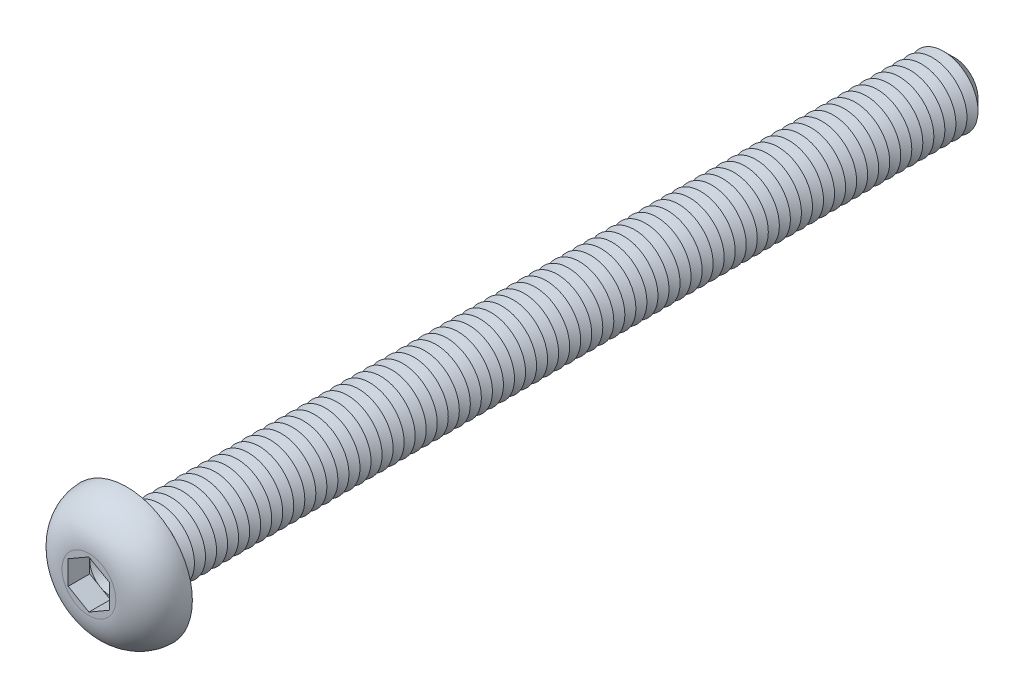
ISO-10303-21;
HEADER;
FILE_DESCRIPTION(('STEP AP214'),'2;1');
FILE_NAME('part.step','',(''),(''),'','','');
FILE_SCHEMA(('AUTOMOTIVE_DESIGN { 1 0 10303 214 1 1 1 1 }'));
ENDSEC;
DATA;
#1=APPLICATION_CONTEXT('core data for automotive mechanical design processes');
#2=APPLICATION_PROTOCOL_DEFINITION('international standard','automotive_design',2000,#1);
#3=PRODUCT_CONTEXT('',#1,'mechanical');
#4=PRODUCT('Part','Part','',(#3));
#5=PRODUCT_RELATED_PRODUCT_CATEGORY('part','',(#4));
#6=PRODUCT_DEFINITION_FORMATION('','',#4);
#7=PRODUCT_DEFINITION_CONTEXT('part definition',#1,'design');
#8=PRODUCT_DEFINITION('design','',#6,#7);
#9=PRODUCT_DEFINITION_SHAPE('','',#8);
#10=(LENGTH_UNIT() NAMED_UNIT(*) SI_UNIT(.MILLI.,.METRE.));
#11=(NAMED_UNIT(*) PLANE_ANGLE_UNIT() SI_UNIT($,.RADIAN.));
#12=(NAMED_UNIT(*) SI_UNIT($,.STERADIAN.) SOLID_ANGLE_UNIT());
#13=UNCERTAINTY_MEASURE_WITH_UNIT(LENGTH_MEASURE(1.E-05),#10,'distance_accuracy_value','');
#14=(GEOMETRIC_REPRESENTATION_CONTEXT(3) GLOBAL_UNCERTAINTY_ASSIGNED_CONTEXT((#13)) GLOBAL_UNIT_ASSIGNED_CONTEXT((#10,
#11,#12)) REPRESENTATION_CONTEXT('',''));
#15=CARTESIAN_POINT('',(0.,0.,0.));
#16=DIRECTION('',(0.,0.,1.));
#17=DIRECTION('',(1.,0.,0.));
#18=AXIS2_PLACEMENT_3D('',#15,#16,#17);
#19=CARTESIAN_POINT('',(0.,0.,1.19));
#20=DIRECTION('',(0.,0.,1.));
#21=DIRECTION('',(1.,0.,0.));
#22=AXIS2_PLACEMENT_3D('',#19,#20,#21);
#23=PLANE('',#22);
#24=CARTESIAN_POINT('',(0.,0.,1.19));
#25=DIRECTION('',(0.,0.,1.));
#26=DIRECTION('',(1.,0.,0.));
#27=AXIS2_PLACEMENT_3D('',#24,#25,#26);
#28=CIRCLE('',#27,1.5);
#29=CARTESIAN_POINT('',(1.5,0.,1.19));
#30=VERTEX_POINT('',#29);
#31=CARTESIAN_POINT('',(0.75,1.29903810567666,1.19));
#32=VERTEX_POINT('',#31);
#33=EDGE_CURVE('E117',#30,#32,#28,.T.);
#34=ORIENTED_EDGE('',*,*,#33,.F.);
#35=DIRECTION('',(0.,1.,0.));
#36=VECTOR('',#35,1.);
#37=CARTESIAN_POINT('',(1.5,-0.866025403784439,1.19));
#38=LINE('',#37,#36);
#39=CARTESIAN_POINT('',(1.5,0.86602540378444,1.19));
#40=VERTEX_POINT('',#39);
#41=EDGE_CURVE('E140',#30,#40,#38,.T.);
#42=ORIENTED_EDGE('',*,*,#41,.T.);
#43=DIRECTION('',(-0.866025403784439,0.5,0.));
#44=VECTOR('',#43,1.);
#45=CARTESIAN_POINT('',(1.5,0.86602540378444,1.19));
#46=LINE('',#45,#44);
#47=EDGE_CURVE('E135',#40,#32,#46,.T.);
#48=ORIENTED_EDGE('',*,*,#47,.T.);
#49=EDGE_LOOP('',(#34,#42,#48));
#50=FACE_BOUND('',#49,.T.);
#51=ADVANCED_FACE('F39',(#50),#23,.T.);
#52=CARTESIAN_POINT('',(0.,0.,1.19));
#53=DIRECTION('',(0.,0.,1.));
#54=DIRECTION('',(1.,0.,0.));
#55=AXIS2_PLACEMENT_3D('',#52,#53,#54);
#56=CIRCLE('',#55,1.5);
#57=CARTESIAN_POINT('',(-0.75,1.29903810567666,1.19));
#58=VERTEX_POINT('',#57);
#59=EDGE_CURVE('E11',#32,#58,#56,.T.);
#60=ORIENTED_EDGE('',*,*,#59,.F.);
#61=CARTESIAN_POINT('',(0.,1.73205080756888,1.19));
#62=VERTEX_POINT('',#61);
#63=EDGE_CURVE('E130',#32,#62,#46,.T.);
#64=ORIENTED_EDGE('',*,*,#63,.T.);
#65=DIRECTION('',(-0.866025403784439,-0.5,0.));
#66=VECTOR('',#65,1.);
#67=CARTESIAN_POINT('',(0.,1.73205080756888,1.19));
#68=LINE('',#67,#66);
#69=EDGE_CURVE('E132',#62,#58,#68,.T.);
#70=ORIENTED_EDGE('',*,*,#69,.T.);
#71=EDGE_LOOP('',(#60,#64,#70));
#72=FACE_BOUND('',#71,.T.);
#73=ADVANCED_FACE('F129',(#72),#23,.T.);
#74=CARTESIAN_POINT('',(-1.5,0.,1.19));
#75=VERTEX_POINT('',#74);
#76=EDGE_CURVE('E49',#58,#75,#56,.T.);
#77=ORIENTED_EDGE('',*,*,#76,.F.);
#78=CARTESIAN_POINT('',(-1.5,0.866025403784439,1.19));
#79=VERTEX_POINT('',#78);
#80=EDGE_CURVE('E143',#58,#79,#68,.T.);
#81=ORIENTED_EDGE('',*,*,#80,.T.);
#82=DIRECTION('',(0.,-1.,0.));
#83=VECTOR('',#82,1.);
#84=CARTESIAN_POINT('',(-1.5,0.866025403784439,1.19));
#85=LINE('',#84,#83);
#86=EDGE_CURVE('E154',#79,#75,#85,.T.);
#87=ORIENTED_EDGE('',*,*,#86,.T.);
#88=EDGE_LOOP('',(#77,#81,#87));
#89=FACE_BOUND('',#88,.T.);
#90=ADVANCED_FACE('F252',(#89),#23,.T.);
#91=CARTESIAN_POINT('',(-0.75,-1.29903810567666,1.19));
#92=VERTEX_POINT('',#91);
#93=EDGE_CURVE('E234',#75,#92,#56,.T.);
#94=ORIENTED_EDGE('',*,*,#93,.F.);
#95=CARTESIAN_POINT('',(-1.5,-0.866025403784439,1.19));
#96=VERTEX_POINT('',#95);
#97=EDGE_CURVE('E153',#75,#96,#85,.T.);
#98=ORIENTED_EDGE('',*,*,#97,.T.);
#99=DIRECTION('',(0.866025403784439,-0.5,0.));
#100=VECTOR('',#99,1.);
#101=CARTESIAN_POINT('',(-1.5,-0.866025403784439,1.19));
#102=LINE('',#101,#100);
#103=EDGE_CURVE('E159',#96,#92,#102,.T.);
#104=ORIENTED_EDGE('',*,*,#103,.T.);
#105=EDGE_LOOP('',(#94,#98,#104));
#106=FACE_BOUND('',#105,.T.);
#107=ADVANCED_FACE('F245',(#106),#23,.T.);
#108=CARTESIAN_POINT('',(0.75,-1.29903810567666,1.19));
#109=VERTEX_POINT('',#108);
#110=EDGE_CURVE('E56',#92,#109,#56,.T.);
#111=ORIENTED_EDGE('',*,*,#110,.F.);
#112=CARTESIAN_POINT('',(0.,-1.73205080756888,1.19));
#113=VERTEX_POINT('',#112);
#114=EDGE_CURVE('E158',#92,#113,#102,.T.);
#115=ORIENTED_EDGE('',*,*,#114,.T.);
#116=DIRECTION('',(0.866025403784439,0.5,0.));
#117=VECTOR('',#116,1.);
#118=CARTESIAN_POINT('',(0.,-1.73205080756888,1.19));
#119=LINE('',#118,#117);
#120=EDGE_CURVE('E164',#113,#109,#119,.T.);
#121=ORIENTED_EDGE('',*,*,#120,.T.);
#122=EDGE_LOOP('',(#111,#115,#121));
#123=FACE_BOUND('',#122,.T.);
#124=ADVANCED_FACE('F412',(#123),#23,.T.);
#125=CARTESIAN_POINT('',(0.,0.,-60.));
#126=DIRECTION('',(0.,0.,1.));
#127=DIRECTION('',(1.,0.,0.));
#128=AXIS2_PLACEMENT_3D('',#125,#126,#127);
#129=CYLINDRICAL_SURFACE('',#128,2.5);
#130=CARTESIAN_POINT('',(0.,0.,-0.399999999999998));
#131=DIRECTION('',(0.,0.,1.));
#132=DIRECTION('',(1.,0.,0.));
#133=AXIS2_PLACEMENT_3D('',#130,#131,#132);
#134=CIRCLE('',#133,2.5);
#135=CARTESIAN_POINT('',(2.5,0.,-0.399999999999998));
#136=VERTEX_POINT('',#135);
#137=EDGE_CURVE('E221',#136,#136,#134,.F.);
#138=ORIENTED_EDGE('',*,*,#137,.T.);
#139=EDGE_LOOP('',(#138));
#140=FACE_BOUND('',#139,.T.);
#141=CARTESIAN_POINT('',(0.,0.,-0.800000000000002));
#142=DIRECTION('',(0.,0.,1.));
#143=DIRECTION('',(1.,0.,0.));
#144=AXIS2_PLACEMENT_3D('',#141,#142,#143);
#145=CIRCLE('',#144,2.5);
#146=CARTESIAN_POINT('',(2.5,0.,-0.800000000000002));
#147=VERTEX_POINT('',#146);
#148=EDGE_CURVE('E149',#147,#147,#145,.T.);
#149=ORIENTED_EDGE('',*,*,#148,.T.);
#150=EDGE_LOOP('',(#149));
#151=FACE_BOUND('',#150,.T.);
#152=ADVANCED_FACE('F396',(#140,#151),#129,.T.);
#153=CARTESIAN_POINT('',(0.,4.75,0.));
#154=DIRECTION('',(0.,0.,1.));
#155=DIRECTION('',(1.,0.,0.));
#156=AXIS2_PLACEMENT_3D('',#153,#154,#155);
#157=PLANE('',#156);
#158=CARTESIAN_POINT('',(0.,0.,0.));
#159=DIRECTION('',(0.,0.,1.));
#160=DIRECTION('',(1.,0.,0.));
#161=AXIS2_PLACEMENT_3D('',#158,#159,#160);
#162=CIRCLE('',#161,2.9);
#163=CARTESIAN_POINT('',(2.9,0.,0.));
#164=VERTEX_POINT('',#163);
#165=EDGE_CURVE('E224',#164,#164,#162,.T.);
#166=ORIENTED_EDGE('',*,*,#165,.T.);
#167=EDGE_LOOP('',(#166));
#168=FACE_BOUND('',#167,.T.);
#169=CARTESIAN_POINT('',(0.,0.,0.));
#170=DIRECTION('',(0.,0.,1.));
#171=DIRECTION('',(1.,0.,0.));
#172=AXIS2_PLACEMENT_3D('',#169,#170,#171);
#173=CIRCLE('',#172,4.75);
#174=CARTESIAN_POINT('',(4.75,0.,0.));
#175=VERTEX_POINT('',#174);
#176=EDGE_CURVE('E195',#175,#175,#173,.T.);
#177=ORIENTED_EDGE('',*,*,#176,.F.);
#178=EDGE_LOOP('',(#177));
#179=FACE_BOUND('',#178,.T.);
#180=ADVANCED_FACE('F442',(#168,#179),#157,.F.);
#181=CARTESIAN_POINT('',(0.,0.,2.75));
#182=DIRECTION('',(0.,0.,-1.));
#183=DIRECTION('',(-1.,0.,0.));
#184=AXIS2_PLACEMENT_3D('',#181,#182,#183);
#185=PLANE('',#184);
#186=DIRECTION('',(-0.866025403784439,-0.5,0.));
#187=VECTOR('',#186,1.);
#188=CARTESIAN_POINT('',(0.,1.73205080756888,2.75));
#189=LINE('',#188,#187);
#190=CARTESIAN_POINT('',(0.,1.73205080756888,2.75));
#191=VERTEX_POINT('',#190);
#192=CARTESIAN_POINT('',(-1.5,0.866025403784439,2.75));
#193=VERTEX_POINT('',#192);
#194=EDGE_CURVE('E174',#191,#193,#189,.T.);
#195=ORIENTED_EDGE('',*,*,#194,.F.);
#196=DIRECTION('',(-0.866025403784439,0.5,0.));
#197=VECTOR('',#196,1.);
#198=CARTESIAN_POINT('',(1.5,0.86602540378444,2.75));
#199=LINE('',#198,#197);
#200=CARTESIAN_POINT('',(1.5,0.86602540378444,2.75));
#201=VERTEX_POINT('',#200);
#202=EDGE_CURVE('E64',#201,#191,#199,.T.);
#203=ORIENTED_EDGE('',*,*,#202,.F.);
#204=DIRECTION('',(0.,1.,0.));
#205=VECTOR('',#204,1.);
#206=CARTESIAN_POINT('',(1.5,-0.866025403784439,2.75));
#207=LINE('',#206,#205);
#208=CARTESIAN_POINT('',(1.5,-0.866025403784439,2.75));
#209=VERTEX_POINT('',#208);
#210=EDGE_CURVE('E138',#209,#201,#207,.T.);
#211=ORIENTED_EDGE('',*,*,#210,.F.);
#212=DIRECTION('',(0.866025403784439,0.5,0.));
#213=VECTOR('',#212,1.);
#214=CARTESIAN_POINT('',(0.,-1.73205080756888,2.75));
#215=LINE('',#214,#213);
#216=CARTESIAN_POINT('',(0.,-1.73205080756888,2.75));
#217=VERTEX_POINT('',#216);
#218=EDGE_CURVE('E186',#217,#209,#215,.T.);
#219=ORIENTED_EDGE('',*,*,#218,.F.);
#220=DIRECTION('',(0.866025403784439,-0.5,0.));
#221=VECTOR('',#220,1.);
#222=CARTESIAN_POINT('',(-1.5,-0.866025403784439,2.75));
#223=LINE('',#222,#221);
#224=CARTESIAN_POINT('',(-1.5,-0.866025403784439,2.75));
#225=VERTEX_POINT('',#224);
#226=EDGE_CURVE('E182',#225,#217,#223,.T.);
#227=ORIENTED_EDGE('',*,*,#226,.F.);
#228=DIRECTION('',(0.,-1.,0.));
#229=VECTOR('',#228,1.);
#230=CARTESIAN_POINT('',(-1.5,0.866025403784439,2.75));
#231=LINE('',#230,#229);
#232=EDGE_CURVE('E178',#193,#225,#231,.T.);
#233=ORIENTED_EDGE('',*,*,#232,.F.);
#234=EDGE_LOOP('',(#195,#203,#211,#219,#227,#233));
#235=FACE_BOUND('',#234,.T.);
#236=CARTESIAN_POINT('',(0.,0.,2.75));
#237=DIRECTION('',(0.,0.,1.));
#238=DIRECTION('',(1.,0.,0.));
#239=AXIS2_PLACEMENT_3D('',#236,#237,#238);
#240=CIRCLE('',#239,1.95044646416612);
#241=CARTESIAN_POINT('',(1.95044646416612,0.,2.75));
#242=VERTEX_POINT('',#241);
#243=EDGE_CURVE('E213',#242,#242,#240,.T.);
#244=ORIENTED_EDGE('',*,*,#243,.T.);
#245=EDGE_LOOP('',(#244));
#246=FACE_BOUND('',#245,.T.);
#247=ADVANCED_FACE('F261',(#235,#246),#185,.F.);
#248=CARTESIAN_POINT('',(0.,0.,-0.0500000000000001));
#249=DIRECTION('',(0.,0.,1.));
#250=DIRECTION('',(1.,0.,0.));
#251=AXIS2_PLACEMENT_3D('',#248,#249,#250);
#252=DEGENERATE_TOROIDAL_SURFACE('',#251,1.95044646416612,2.8,.T.);
#253=ORIENTED_EDGE('',*,*,#243,.F.);
#254=EDGE_LOOP('',(#253));
#255=FACE_BOUND('',#254,.T.);
#256=ORIENTED_EDGE('',*,*,#176,.T.);
#257=EDGE_LOOP('',(#256));
#258=FACE_BOUND('',#257,.T.);
#259=ADVANCED_FACE('F436',(#255,#258),#252,.T.);
#260=CARTESIAN_POINT('',(1.5,0.86602540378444,1.19));
#261=DIRECTION('',(0.5,0.866025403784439,0.));
#262=DIRECTION('',(-0.866025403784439,0.5,0.));
#263=AXIS2_PLACEMENT_3D('',#260,#261,#262);
#264=PLANE('',#263);
#265=ORIENTED_EDGE('',*,*,#202,.T.);
#266=DIRECTION('',(0.,0.,1.));
#267=VECTOR('',#266,1.);
#268=CARTESIAN_POINT('',(0.,1.73205080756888,1.19));
#269=LINE('',#268,#267);
#270=EDGE_CURVE('E136',#62,#191,#269,.T.);
#271=ORIENTED_EDGE('',*,*,#270,.F.);
#272=ORIENTED_EDGE('',*,*,#63,.F.);
#273=ORIENTED_EDGE('',*,*,#47,.F.);
#274=DIRECTION('',(0.,0.,1.));
#275=VECTOR('',#274,1.);
#276=CARTESIAN_POINT('',(1.5,0.86602540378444,1.19));
#277=LINE('',#276,#275);
#278=EDGE_CURVE('E193',#40,#201,#277,.T.);
#279=ORIENTED_EDGE('',*,*,#278,.T.);
#280=EDGE_LOOP('',(#265,#271,#272,#273,#279));
#281=FACE_BOUND('',#280,.T.);
#282=ADVANCED_FACE('F134',(#281),#264,.F.);
#283=CARTESIAN_POINT('',(1.5,-0.866025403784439,1.19));
#284=DIRECTION('',(1.,0.,0.));
#285=DIRECTION('',(0.,1.,0.));
#286=AXIS2_PLACEMENT_3D('',#283,#284,#285);
#287=PLANE('',#286);
#288=ORIENTED_EDGE('',*,*,#210,.T.);
#289=ORIENTED_EDGE('',*,*,#278,.F.);
#290=ORIENTED_EDGE('',*,*,#41,.F.);
#291=CARTESIAN_POINT('',(1.5,-0.866025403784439,1.19));
#292=VERTEX_POINT('',#291);
#293=EDGE_CURVE('E168',#292,#30,#38,.T.);
#294=ORIENTED_EDGE('',*,*,#293,.F.);
#295=DIRECTION('',(0.,0.,1.));
#296=VECTOR('',#295,1.);
#297=CARTESIAN_POINT('',(1.5,-0.866025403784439,1.19));
#298=LINE('',#297,#296);
#299=EDGE_CURVE('E196',#292,#209,#298,.T.);
#300=ORIENTED_EDGE('',*,*,#299,.T.);
#301=EDGE_LOOP('',(#288,#289,#290,#294,#300));
#302=FACE_BOUND('',#301,.T.);
#303=ADVANCED_FACE('F420',(#302),#287,.F.);
#304=CARTESIAN_POINT('',(0.,-1.73205080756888,1.19));
#305=DIRECTION('',(0.5,-0.866025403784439,0.));
#306=DIRECTION('',(0.866025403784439,0.5,0.));
#307=AXIS2_PLACEMENT_3D('',#304,#305,#306);
#308=PLANE('',#307);
#309=ORIENTED_EDGE('',*,*,#218,.T.);
#310=ORIENTED_EDGE('',*,*,#299,.F.);
#311=EDGE_CURVE('E163',#109,#292,#119,.T.);
#312=ORIENTED_EDGE('',*,*,#311,.F.);
#313=ORIENTED_EDGE('',*,*,#120,.F.);
#314=DIRECTION('',(0.,0.,1.));
#315=VECTOR('',#314,1.);
#316=CARTESIAN_POINT('',(0.,-1.73205080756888,1.19));
#317=LINE('',#316,#315);
#318=EDGE_CURVE('E199',#113,#217,#317,.T.);
#319=ORIENTED_EDGE('',*,*,#318,.T.);
#320=EDGE_LOOP('',(#309,#310,#312,#313,#319));
#321=FACE_BOUND('',#320,.T.);
#322=ADVANCED_FACE('F423',(#321),#308,.F.);
#323=CARTESIAN_POINT('',(-1.5,-0.866025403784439,1.19));
#324=DIRECTION('',(-0.5,-0.866025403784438,0.));
#325=DIRECTION('',(0.866025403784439,-0.5,0.));
#326=AXIS2_PLACEMENT_3D('',#323,#324,#325);
#327=PLANE('',#326);
#328=ORIENTED_EDGE('',*,*,#226,.T.);
#329=ORIENTED_EDGE('',*,*,#318,.F.);
#330=ORIENTED_EDGE('',*,*,#114,.F.);
#331=ORIENTED_EDGE('',*,*,#103,.F.);
#332=DIRECTION('',(0.,0.,1.));
#333=VECTOR('',#332,1.);
#334=CARTESIAN_POINT('',(-1.5,-0.866025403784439,1.19));
#335=LINE('',#334,#333);
#336=EDGE_CURVE('E202',#96,#225,#335,.T.);
#337=ORIENTED_EDGE('',*,*,#336,.T.);
#338=EDGE_LOOP('',(#328,#329,#330,#331,#337));
#339=FACE_BOUND('',#338,.T.);
#340=ADVANCED_FACE('F266',(#339),#327,.F.);
#341=CARTESIAN_POINT('',(-1.5,0.866025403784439,1.19));
#342=DIRECTION('',(-1.,0.,0.));
#343=DIRECTION('',(0.,-1.,0.));
#344=AXIS2_PLACEMENT_3D('',#341,#342,#343);
#345=PLANE('',#344);
#346=ORIENTED_EDGE('',*,*,#232,.T.);
#347=ORIENTED_EDGE('',*,*,#336,.F.);
#348=ORIENTED_EDGE('',*,*,#97,.F.);
#349=ORIENTED_EDGE('',*,*,#86,.F.);
#350=DIRECTION('',(0.,0.,1.));
#351=VECTOR('',#350,1.);
#352=CARTESIAN_POINT('',(-1.5,0.866025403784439,1.19));
#353=LINE('',#352,#351);
#354=EDGE_CURVE('E205',#79,#193,#353,.T.);
#355=ORIENTED_EDGE('',*,*,#354,.T.);
#356=EDGE_LOOP('',(#346,#347,#348,#349,#355));
#357=FACE_BOUND('',#356,.T.);
#358=ADVANCED_FACE('F250',(#357),#345,.F.);
#359=CARTESIAN_POINT('',(0.,1.73205080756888,1.19));
#360=DIRECTION('',(-0.5,0.866025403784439,0.));
#361=DIRECTION('',(-0.866025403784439,-0.5,0.));
#362=AXIS2_PLACEMENT_3D('',#359,#360,#361);
#363=PLANE('',#362);
#364=ORIENTED_EDGE('',*,*,#194,.T.);
#365=ORIENTED_EDGE('',*,*,#354,.F.);
#366=ORIENTED_EDGE('',*,*,#80,.F.);
#367=ORIENTED_EDGE('',*,*,#69,.F.);
#368=ORIENTED_EDGE('',*,*,#270,.T.);
#369=EDGE_LOOP('',(#364,#365,#366,#367,#368));
#370=FACE_BOUND('',#369,.T.);
#371=ADVANCED_FACE('F255',(#370),#363,.F.);
#372=EDGE_CURVE('E43',#109,#30,#56,.T.);
#373=ORIENTED_EDGE('',*,*,#372,.F.);
#374=ORIENTED_EDGE('',*,*,#311,.T.);
#375=ORIENTED_EDGE('',*,*,#293,.T.);
#376=EDGE_LOOP('',(#373,#374,#375));
#377=FACE_BOUND('',#376,.T.);
#378=ADVANCED_FACE('F401',(#377),#23,.T.);
#379=CARTESIAN_POINT('',(0.,0.,-0.800000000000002));
#380=DIRECTION('',(0.,0.,1.));
#381=DIRECTION('',(1.,0.,0.));
#382=AXIS2_PLACEMENT_3D('',#379,#380,#381);
#383=CONICAL_SURFACE('',#382,2.5,1.0471975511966);
#384=CARTESIAN_POINT('',(0.,0.,-1.2));
#385=DIRECTION('',(0.,0.,1.));
#386=DIRECTION('',(1.,0.,0.));
#387=AXIS2_PLACEMENT_3D('',#384,#385,#386);
#388=CIRCLE('',#387,1.80717967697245);
#389=CARTESIAN_POINT('',(1.80717967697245,0.,-1.2));
#390=VERTEX_POINT('',#389);
#391=EDGE_CURVE('E387',#390,#390,#388,.T.);
#392=ORIENTED_EDGE('',*,*,#391,.T.);
#393=EDGE_LOOP('',(#392));
#394=FACE_BOUND('',#393,.T.);
#395=ORIENTED_EDGE('',*,*,#148,.F.);
#396=EDGE_LOOP('',(#395));
#397=FACE_BOUND('',#396,.T.);
#398=ADVANCED_FACE('F398',(#394,#397),#383,.T.);
#399=CARTESIAN_POINT('',(0.,0.,-1.2));
#400=DIRECTION('',(0.,0.,-1.));
#401=DIRECTION('',(-1.,0.,0.));
#402=AXIS2_PLACEMENT_3D('',#399,#400,#401);
#403=CONICAL_SURFACE('',#402,1.80717967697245,1.04719755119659);
#404=CARTESIAN_POINT('',(0.,0.,-1.6));
#405=DIRECTION('',(0.,0.,1.));
#406=DIRECTION('',(1.,0.,0.));
#407=AXIS2_PLACEMENT_3D('',#404,#405,#406);
#408=CIRCLE('',#407,2.5);
#409=CARTESIAN_POINT('',(2.5,0.,-1.6));
#410=VERTEX_POINT('',#409);
#411=EDGE_CURVE('E384',#410,#410,#408,.T.);
#412=ORIENTED_EDGE('',*,*,#411,.T.);
#413=EDGE_LOOP('',(#412));
#414=FACE_BOUND('',#413,.T.);
#415=ORIENTED_EDGE('',*,*,#391,.F.);
#416=EDGE_LOOP('',(#415));
#417=FACE_BOUND('',#416,.T.);
#418=ADVANCED_FACE('F400',(#414,#417),#403,.T.);
#419=CARTESIAN_POINT('',(0.,0.,-1.6));
#420=DIRECTION('',(0.,0.,1.));
#421=DIRECTION('',(1.,0.,0.));
#422=AXIS2_PLACEMENT_3D('',#419,#420,#421);
#423=CONICAL_SURFACE('',#422,2.5,1.0471975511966);
#424=CARTESIAN_POINT('',(0.,0.,-2.));
#425=DIRECTION('',(0.,0.,1.));
#426=DIRECTION('',(1.,0.,0.));
#427=AXIS2_PLACEMENT_3D('',#424,#425,#426);
#428=CIRCLE('',#427,1.80717967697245);
#429=CARTESIAN_POINT('',(1.80717967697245,0.,-2.));
#430=VERTEX_POINT('',#429);
#431=EDGE_CURVE('E380',#430,#430,#428,.T.);
#432=ORIENTED_EDGE('',*,*,#431,.T.);
#433=EDGE_LOOP('',(#432));
#434=FACE_BOUND('',#433,.T.);
#435=ORIENTED_EDGE('',*,*,#411,.F.);
#436=EDGE_LOOP('',(#435));
#437=FACE_BOUND('',#436,.T.);
#438=ADVANCED_FACE('F407',(#434,#437),#423,.T.);
#439=CARTESIAN_POINT('',(0.,0.,-2.));
#440=DIRECTION('',(0.,0.,-1.));
#441=DIRECTION('',(-1.,0.,0.));
#442=AXIS2_PLACEMENT_3D('',#439,#440,#441);
#443=CONICAL_SURFACE('',#442,1.80717967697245,1.04719755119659);
#444=CARTESIAN_POINT('',(0.,0.,-2.4));
#445=DIRECTION('',(0.,0.,1.));
#446=DIRECTION('',(1.,0.,0.));
#447=AXIS2_PLACEMENT_3D('',#444,#445,#446);
#448=CIRCLE('',#447,2.5);
#449=CARTESIAN_POINT('',(2.5,0.,-2.4));
#450=VERTEX_POINT('',#449);
#451=EDGE_CURVE('E376',#450,#450,#448,.T.);
#452=ORIENTED_EDGE('',*,*,#451,.T.);
#453=EDGE_LOOP('',(#452));
#454=FACE_BOUND('',#453,.T.);
#455=ORIENTED_EDGE('',*,*,#431,.F.);
#456=EDGE_LOOP('',(#455));
#457=FACE_BOUND('',#456,.T.);
#458=ADVANCED_FACE('F988',(#454,#457),#443,.T.);
#459=CARTESIAN_POINT('',(0.,0.,-2.4));
#460=DIRECTION('',(0.,0.,1.));
#461=DIRECTION('',(1.,0.,0.));
#462=AXIS2_PLACEMENT_3D('',#459,#460,#461);
#463=CONICAL_SURFACE('',#462,2.5,1.0471975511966);
#464=CARTESIAN_POINT('',(0.,0.,-2.8));
#465=DIRECTION('',(0.,0.,1.));
#466=DIRECTION('',(1.,0.,0.));
#467=AXIS2_PLACEMENT_3D('',#464,#465,#466);
#468=CIRCLE('',#467,1.80717967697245);
#469=CARTESIAN_POINT('',(1.80717967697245,0.,-2.8));
#470=VERTEX_POINT('',#469);
#471=EDGE_CURVE('E372',#470,#470,#468,.T.);
#472=ORIENTED_EDGE('',*,*,#471,.T.);
#473=EDGE_LOOP('',(#472));
#474=FACE_BOUND('',#473,.T.);
#475=ORIENTED_EDGE('',*,*,#451,.F.);
#476=EDGE_LOOP('',(#475));
#477=FACE_BOUND('',#476,.T.);
#478=ADVANCED_FACE('F984',(#474,#477),#463,.T.);
#479=CARTESIAN_POINT('',(0.,0.,-2.8));
#480=DIRECTION('',(0.,0.,-1.));
#481=DIRECTION('',(-1.,0.,0.));
#482=AXIS2_PLACEMENT_3D('',#479,#480,#481);
#483=CONICAL_SURFACE('',#482,1.80717967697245,1.04719755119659);
#484=CARTESIAN_POINT('',(0.,0.,-3.2));
#485=DIRECTION('',(0.,0.,1.));
#486=DIRECTION('',(1.,0.,0.));
#487=AXIS2_PLACEMENT_3D('',#484,#485,#486);
#488=CIRCLE('',#487,2.5);
#489=CARTESIAN_POINT('',(2.5,0.,-3.2));
#490=VERTEX_POINT('',#489);
#491=EDGE_CURVE('E368',#490,#490,#488,.T.);
#492=ORIENTED_EDGE('',*,*,#491,.T.);
#493=EDGE_LOOP('',(#492));
#494=FACE_BOUND('',#493,.T.);
#495=ORIENTED_EDGE('',*,*,#471,.F.);
#496=EDGE_LOOP('',(#495));
#497=FACE_BOUND('',#496,.T.);
#498=ADVANCED_FACE('F980',(#494,#497),#483,.T.);
#499=CARTESIAN_POINT('',(0.,0.,-3.2));
#500=DIRECTION('',(0.,0.,1.));
#501=DIRECTION('',(1.,0.,0.));
#502=AXIS2_PLACEMENT_3D('',#499,#500,#501);
#503=CONICAL_SURFACE('',#502,2.5,1.0471975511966);
#504=CARTESIAN_POINT('',(0.,0.,-3.6));
#505=DIRECTION('',(0.,0.,1.));
#506=DIRECTION('',(1.,0.,0.));
#507=AXIS2_PLACEMENT_3D('',#504,#505,#506);
#508=CIRCLE('',#507,1.80717967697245);
#509=CARTESIAN_POINT('',(1.80717967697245,0.,-3.6));
#510=VERTEX_POINT('',#509);
#511=EDGE_CURVE('E364',#510,#510,#508,.T.);
#512=ORIENTED_EDGE('',*,*,#511,.T.);
#513=EDGE_LOOP('',(#512));
#514=FACE_BOUND('',#513,.T.);
#515=ORIENTED_EDGE('',*,*,#491,.F.);
#516=EDGE_LOOP('',(#515));
#517=FACE_BOUND('',#516,.T.);
#518=ADVANCED_FACE('F976',(#514,#517),#503,.T.);
#519=CARTESIAN_POINT('',(0.,0.,-3.6));
#520=DIRECTION('',(0.,0.,-1.));
#521=DIRECTION('',(-1.,0.,0.));
#522=AXIS2_PLACEMENT_3D('',#519,#520,#521);
#523=CONICAL_SURFACE('',#522,1.80717967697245,1.04719755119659);
#524=CARTESIAN_POINT('',(0.,0.,-4.));
#525=DIRECTION('',(0.,0.,1.));
#526=DIRECTION('',(1.,0.,0.));
#527=AXIS2_PLACEMENT_3D('',#524,#525,#526);
#528=CIRCLE('',#527,2.5);
#529=CARTESIAN_POINT('',(2.5,0.,-4.));
#530=VERTEX_POINT('',#529);
#531=EDGE_CURVE('E360',#530,#530,#528,.T.);
#532=ORIENTED_EDGE('',*,*,#531,.T.);
#533=EDGE_LOOP('',(#532));
#534=FACE_BOUND('',#533,.T.);
#535=ORIENTED_EDGE('',*,*,#511,.F.);
#536=EDGE_LOOP('',(#535));
#537=FACE_BOUND('',#536,.T.);
#538=ADVANCED_FACE('F972',(#534,#537),#523,.T.);
#539=CARTESIAN_POINT('',(0.,0.,-4.));
#540=DIRECTION('',(0.,0.,1.));
#541=DIRECTION('',(1.,0.,0.));
#542=AXIS2_PLACEMENT_3D('',#539,#540,#541);
#543=CONICAL_SURFACE('',#542,2.5,1.0471975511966);
#544=CARTESIAN_POINT('',(0.,0.,-4.4));
#545=DIRECTION('',(0.,0.,1.));
#546=DIRECTION('',(1.,0.,0.));
#547=AXIS2_PLACEMENT_3D('',#544,#545,#546);
#548=CIRCLE('',#547,1.80717967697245);
#549=CARTESIAN_POINT('',(1.80717967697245,0.,-4.4));
#550=VERTEX_POINT('',#549);
#551=EDGE_CURVE('E356',#550,#550,#548,.T.);
#552=ORIENTED_EDGE('',*,*,#551,.T.);
#553=EDGE_LOOP('',(#552));
#554=FACE_BOUND('',#553,.T.);
#555=ORIENTED_EDGE('',*,*,#531,.F.);
#556=EDGE_LOOP('',(#555));
#557=FACE_BOUND('',#556,.T.);
#558=ADVANCED_FACE('F968',(#554,#557),#543,.T.);
#559=CARTESIAN_POINT('',(0.,0.,-4.4));
#560=DIRECTION('',(0.,0.,-1.));
#561=DIRECTION('',(-1.,0.,0.));
#562=AXIS2_PLACEMENT_3D('',#559,#560,#561);
#563=CONICAL_SURFACE('',#562,1.80717967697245,1.04719755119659);
#564=CARTESIAN_POINT('',(0.,0.,-4.8));
#565=DIRECTION('',(0.,0.,1.));
#566=DIRECTION('',(1.,0.,0.));
#567=AXIS2_PLACEMENT_3D('',#564,#565,#566);
#568=CIRCLE('',#567,2.5);
#569=CARTESIAN_POINT('',(2.5,0.,-4.8));
#570=VERTEX_POINT('',#569);
#571=EDGE_CURVE('E352',#570,#570,#568,.T.);
#572=ORIENTED_EDGE('',*,*,#571,.T.);
#573=EDGE_LOOP('',(#572));
#574=FACE_BOUND('',#573,.T.);
#575=ORIENTED_EDGE('',*,*,#551,.F.);
#576=EDGE_LOOP('',(#575));
#577=FACE_BOUND('',#576,.T.);
#578=ADVANCED_FACE('F964',(#574,#577),#563,.T.);
#579=CARTESIAN_POINT('',(0.,0.,-4.8));
#580=DIRECTION('',(0.,0.,1.));
#581=DIRECTION('',(1.,0.,0.));
#582=AXIS2_PLACEMENT_3D('',#579,#580,#581);
#583=CONICAL_SURFACE('',#582,2.5,1.0471975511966);
#584=CARTESIAN_POINT('',(0.,0.,-5.2));
#585=DIRECTION('',(0.,0.,1.));
#586=DIRECTION('',(1.,0.,0.));
#587=AXIS2_PLACEMENT_3D('',#584,#585,#586);
#588=CIRCLE('',#587,1.80717967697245);
#589=CARTESIAN_POINT('',(1.80717967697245,0.,-5.2));
#590=VERTEX_POINT('',#589);
#591=EDGE_CURVE('E348',#590,#590,#588,.T.);
#592=ORIENTED_EDGE('',*,*,#591,.T.);
#593=EDGE_LOOP('',(#592));
#594=FACE_BOUND('',#593,.T.);
#595=ORIENTED_EDGE('',*,*,#571,.F.);
#596=EDGE_LOOP('',(#595));
#597=FACE_BOUND('',#596,.T.);
#598=ADVANCED_FACE('F960',(#594,#597),#583,.T.);
#599=CARTESIAN_POINT('',(0.,0.,-5.2));
#600=DIRECTION('',(0.,0.,-1.));
#601=DIRECTION('',(-1.,0.,0.));
#602=AXIS2_PLACEMENT_3D('',#599,#600,#601);
#603=CONICAL_SURFACE('',#602,1.80717967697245,1.04719755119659);
#604=CARTESIAN_POINT('',(0.,0.,-5.6));
#605=DIRECTION('',(0.,0.,1.));
#606=DIRECTION('',(1.,0.,0.));
#607=AXIS2_PLACEMENT_3D('',#604,#605,#606);
#608=CIRCLE('',#607,2.5);
#609=CARTESIAN_POINT('',(2.5,0.,-5.6));
#610=VERTEX_POINT('',#609);
#611=EDGE_CURVE('E345',#610,#610,#608,.T.);
#612=ORIENTED_EDGE('',*,*,#611,.T.);
#613=EDGE_LOOP('',(#612));
#614=FACE_BOUND('',#613,.T.);
#615=ORIENTED_EDGE('',*,*,#591,.F.);
#616=EDGE_LOOP('',(#615));
#617=FACE_BOUND('',#616,.T.);
#618=ADVANCED_FACE('F956',(#614,#617),#603,.T.);
#619=CARTESIAN_POINT('',(0.,0.,-5.6));
#620=DIRECTION('',(0.,0.,1.));
#621=DIRECTION('',(1.,0.,0.));
#622=AXIS2_PLACEMENT_3D('',#619,#620,#621);
#623=CONICAL_SURFACE('',#622,2.5,1.0471975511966);
#624=CARTESIAN_POINT('',(0.,0.,-6.));
#625=DIRECTION('',(0.,0.,1.));
#626=DIRECTION('',(1.,0.,0.));
#627=AXIS2_PLACEMENT_3D('',#624,#625,#626);
#628=CIRCLE('',#627,1.80717967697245);
#629=CARTESIAN_POINT('',(1.80717967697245,0.,-6.));
#630=VERTEX_POINT('',#629);
#631=EDGE_CURVE('E341',#630,#630,#628,.T.);
#632=ORIENTED_EDGE('',*,*,#631,.T.);
#633=EDGE_LOOP('',(#632));
#634=FACE_BOUND('',#633,.T.);
#635=ORIENTED_EDGE('',*,*,#611,.F.);
#636=EDGE_LOOP('',(#635));
#637=FACE_BOUND('',#636,.T.);
#638=ADVANCED_FACE('F952',(#634,#637),#623,.T.);
#639=CARTESIAN_POINT('',(0.,0.,-6.));
#640=DIRECTION('',(0.,0.,-1.));
#641=DIRECTION('',(-1.,0.,0.));
#642=AXIS2_PLACEMENT_3D('',#639,#640,#641);
#643=CONICAL_SURFACE('',#642,1.80717967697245,1.04719755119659);
#644=CARTESIAN_POINT('',(0.,0.,-6.4));
#645=DIRECTION('',(0.,0.,1.));
#646=DIRECTION('',(1.,0.,0.));
#647=AXIS2_PLACEMENT_3D('',#644,#645,#646);
#648=CIRCLE('',#647,2.5);
#649=CARTESIAN_POINT('',(2.5,0.,-6.4));
#650=VERTEX_POINT('',#649);
#651=EDGE_CURVE('E330',#650,#650,#648,.T.);
#652=ORIENTED_EDGE('',*,*,#651,.T.);
#653=EDGE_LOOP('',(#652));
#654=FACE_BOUND('',#653,.T.);
#655=ORIENTED_EDGE('',*,*,#631,.F.);
#656=EDGE_LOOP('',(#655));
#657=FACE_BOUND('',#656,.T.);
#658=ADVANCED_FACE('F948',(#654,#657),#643,.T.);
#659=CARTESIAN_POINT('',(0.,0.,-6.4));
#660=DIRECTION('',(0.,0.,1.));
#661=DIRECTION('',(1.,0.,0.));
#662=AXIS2_PLACEMENT_3D('',#659,#660,#661);
#663=CONICAL_SURFACE('',#662,2.5,1.0471975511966);
#664=CARTESIAN_POINT('',(0.,0.,-6.8));
#665=DIRECTION('',(0.,0.,1.));
#666=DIRECTION('',(1.,0.,0.));
#667=AXIS2_PLACEMENT_3D('',#664,#665,#666);
#668=CIRCLE('',#667,1.80717967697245);
#669=CARTESIAN_POINT('',(1.80717967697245,0.,-6.8));
#670=VERTEX_POINT('',#669);
#671=EDGE_CURVE('E323',#670,#670,#668,.T.);
#672=ORIENTED_EDGE('',*,*,#671,.T.);
#673=EDGE_LOOP('',(#672));
#674=FACE_BOUND('',#673,.T.);
#675=ORIENTED_EDGE('',*,*,#651,.F.);
#676=EDGE_LOOP('',(#675));
#677=FACE_BOUND('',#676,.T.);
#678=ADVANCED_FACE('F945',(#674,#677),#663,.T.);
#679=CARTESIAN_POINT('',(0.,0.,-6.8));
#680=DIRECTION('',(0.,0.,-1.));
#681=DIRECTION('',(-1.,0.,0.));
#682=AXIS2_PLACEMENT_3D('',#679,#680,#681);
#683=CONICAL_SURFACE('',#682,1.80717967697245,1.04719755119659);
#684=CARTESIAN_POINT('',(0.,0.,-7.2));
#685=DIRECTION('',(0.,0.,1.));
#686=DIRECTION('',(1.,0.,0.));
#687=AXIS2_PLACEMENT_3D('',#684,#685,#686);
#688=CIRCLE('',#687,2.5);
#689=CARTESIAN_POINT('',(2.5,0.,-7.2));
#690=VERTEX_POINT('',#689);
#691=EDGE_CURVE('E321',#690,#690,#688,.T.);
#692=ORIENTED_EDGE('',*,*,#691,.T.);
#693=EDGE_LOOP('',(#692));
#694=FACE_BOUND('',#693,.T.);
#695=ORIENTED_EDGE('',*,*,#671,.F.);
#696=EDGE_LOOP('',(#695));
#697=FACE_BOUND('',#696,.T.);
#698=ADVANCED_FACE('F941',(#694,#697),#683,.T.);
#699=CARTESIAN_POINT('',(0.,0.,-7.2));
#700=DIRECTION('',(0.,0.,1.));
#701=DIRECTION('',(1.,0.,0.));
#702=AXIS2_PLACEMENT_3D('',#699,#700,#701);
#703=CONICAL_SURFACE('',#702,2.5,1.0471975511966);
#704=CARTESIAN_POINT('',(0.,0.,-7.6));
#705=DIRECTION('',(0.,0.,1.));
#706=DIRECTION('',(1.,0.,0.));
#707=AXIS2_PLACEMENT_3D('',#704,#705,#706);
#708=CIRCLE('',#707,1.80717967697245);
#709=CARTESIAN_POINT('',(1.80717967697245,0.,-7.6));
#710=VERTEX_POINT('',#709);
#711=EDGE_CURVE('E324',#710,#710,#708,.T.);
#712=ORIENTED_EDGE('',*,*,#711,.T.);
#713=EDGE_LOOP('',(#712));
#714=FACE_BOUND('',#713,.T.);
#715=ORIENTED_EDGE('',*,*,#691,.F.);
#716=EDGE_LOOP('',(#715));
#717=FACE_BOUND('',#716,.T.);
#718=ADVANCED_FACE('F935',(#714,#717),#703,.T.);
#719=CARTESIAN_POINT('',(0.,0.,-7.6));
#720=DIRECTION('',(0.,0.,-1.));
#721=DIRECTION('',(-1.,0.,0.));
#722=AXIS2_PLACEMENT_3D('',#719,#720,#721);
#723=CONICAL_SURFACE('',#722,1.80717967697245,1.04719755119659);
#724=CARTESIAN_POINT('',(0.,0.,-8.));
#725=DIRECTION('',(0.,0.,1.));
#726=DIRECTION('',(1.,0.,0.));
#727=AXIS2_PLACEMENT_3D('',#724,#725,#726);
#728=CIRCLE('',#727,2.5);
#729=CARTESIAN_POINT('',(2.5,0.,-8.));
#730=VERTEX_POINT('',#729);
#731=EDGE_CURVE('E334',#730,#730,#728,.T.);
#732=ORIENTED_EDGE('',*,*,#731,.T.);
#733=EDGE_LOOP('',(#732));
#734=FACE_BOUND('',#733,.T.);
#735=ORIENTED_EDGE('',*,*,#711,.F.);
#736=EDGE_LOOP('',(#735));
#737=FACE_BOUND('',#736,.T.);
#738=ADVANCED_FACE('F920',(#734,#737),#723,.T.);
#739=CARTESIAN_POINT('',(0.,0.,-8.));
#740=DIRECTION('',(0.,0.,1.));
#741=DIRECTION('',(1.,0.,0.));
#742=AXIS2_PLACEMENT_3D('',#739,#740,#741);
#743=CONICAL_SURFACE('',#742,2.5,1.0471975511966);
#744=CARTESIAN_POINT('',(0.,0.,-8.4));
#745=DIRECTION('',(0.,0.,1.));
#746=DIRECTION('',(1.,0.,0.));
#747=AXIS2_PLACEMENT_3D('',#744,#745,#746);
#748=CIRCLE('',#747,1.80717967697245);
#749=CARTESIAN_POINT('',(1.80717967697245,0.,-8.4));
#750=VERTEX_POINT('',#749);
#751=EDGE_CURVE('E913',#750,#750,#748,.T.);
#752=ORIENTED_EDGE('',*,*,#751,.T.);
#753=EDGE_LOOP('',(#752));
#754=FACE_BOUND('',#753,.T.);
#755=ORIENTED_EDGE('',*,*,#731,.F.);
#756=EDGE_LOOP('',(#755));
#757=FACE_BOUND('',#756,.T.);
#758=ADVANCED_FACE('F923',(#754,#757),#743,.T.);
#759=CARTESIAN_POINT('',(0.,0.,-8.4));
#760=DIRECTION('',(0.,0.,-1.));
#761=DIRECTION('',(-1.,0.,0.));
#762=AXIS2_PLACEMENT_3D('',#759,#760,#761);
#763=CONICAL_SURFACE('',#762,1.80717967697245,1.04719755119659);
#764=CARTESIAN_POINT('',(0.,0.,-8.8));
#765=DIRECTION('',(0.,0.,1.));
#766=DIRECTION('',(1.,0.,0.));
#767=AXIS2_PLACEMENT_3D('',#764,#765,#766);
#768=CIRCLE('',#767,2.5);
#769=CARTESIAN_POINT('',(2.5,0.,-8.8));
#770=VERTEX_POINT('',#769);
#771=EDGE_CURVE('E909',#770,#770,#768,.T.);
#772=ORIENTED_EDGE('',*,*,#771,.T.);
#773=EDGE_LOOP('',(#772));
#774=FACE_BOUND('',#773,.T.);
#775=ORIENTED_EDGE('',*,*,#751,.F.);
#776=EDGE_LOOP('',(#775));
#777=FACE_BOUND('',#776,.T.);
#778=ADVANCED_FACE('F925',(#774,#777),#763,.T.);
#779=CARTESIAN_POINT('',(0.,0.,-8.8));
#780=DIRECTION('',(0.,0.,1.));
#781=DIRECTION('',(1.,0.,0.));
#782=AXIS2_PLACEMENT_3D('',#779,#780,#781);
#783=CONICAL_SURFACE('',#782,2.5,1.0471975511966);
#784=CARTESIAN_POINT('',(0.,0.,-9.2));
#785=DIRECTION('',(0.,0.,1.));
#786=DIRECTION('',(1.,0.,0.));
#787=AXIS2_PLACEMENT_3D('',#784,#785,#786);
#788=CIRCLE('',#787,1.80717967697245);
#789=CARTESIAN_POINT('',(1.80717967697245,0.,-9.2));
#790=VERTEX_POINT('',#789);
#791=EDGE_CURVE('E905',#790,#790,#788,.T.);
#792=ORIENTED_EDGE('',*,*,#791,.T.);
#793=EDGE_LOOP('',(#792));
#794=FACE_BOUND('',#793,.T.);
#795=ORIENTED_EDGE('',*,*,#771,.F.);
#796=EDGE_LOOP('',(#795));
#797=FACE_BOUND('',#796,.T.);
#798=ADVANCED_FACE('F932',(#794,#797),#783,.T.);
#799=CARTESIAN_POINT('',(0.,0.,-9.2));
#800=DIRECTION('',(0.,0.,-1.));
#801=DIRECTION('',(-1.,0.,0.));
#802=AXIS2_PLACEMENT_3D('',#799,#800,#801);
#803=CONICAL_SURFACE('',#802,1.80717967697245,1.04719755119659);
#804=CARTESIAN_POINT('',(0.,0.,-9.6));
#805=DIRECTION('',(0.,0.,1.));
#806=DIRECTION('',(1.,0.,0.));
#807=AXIS2_PLACEMENT_3D('',#804,#805,#806);
#808=CIRCLE('',#807,2.5);
#809=CARTESIAN_POINT('',(2.5,0.,-9.6));
#810=VERTEX_POINT('',#809);
#811=EDGE_CURVE('E901',#810,#810,#808,.T.);
#812=ORIENTED_EDGE('',*,*,#811,.T.);
#813=EDGE_LOOP('',(#812));
#814=FACE_BOUND('',#813,.T.);
#815=ORIENTED_EDGE('',*,*,#791,.F.);
#816=EDGE_LOOP('',(#815));
#817=FACE_BOUND('',#816,.T.);
#818=ADVANCED_FACE('F1064',(#814,#817),#803,.T.);
#819=CARTESIAN_POINT('',(0.,0.,-9.6));
#820=DIRECTION('',(0.,0.,1.));
#821=DIRECTION('',(1.,0.,0.));
#822=AXIS2_PLACEMENT_3D('',#819,#820,#821);
#823=CONICAL_SURFACE('',#822,2.5,1.0471975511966);
#824=CARTESIAN_POINT('',(0.,0.,-10.));
#825=DIRECTION('',(0.,0.,1.));
#826=DIRECTION('',(1.,0.,0.));
#827=AXIS2_PLACEMENT_3D('',#824,#825,#826);
#828=CIRCLE('',#827,1.80717967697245);
#829=CARTESIAN_POINT('',(1.80717967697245,0.,-10.));
#830=VERTEX_POINT('',#829);
#831=EDGE_CURVE('E897',#830,#830,#828,.T.);
#832=ORIENTED_EDGE('',*,*,#831,.T.);
#833=EDGE_LOOP('',(#832));
#834=FACE_BOUND('',#833,.T.);
#835=ORIENTED_EDGE('',*,*,#811,.F.);
#836=EDGE_LOOP('',(#835));
#837=FACE_BOUND('',#836,.T.);
#838=ADVANCED_FACE('F1072',(#834,#837),#823,.T.);
#839=CARTESIAN_POINT('',(0.,0.,-10.));
#840=DIRECTION('',(0.,0.,-1.));
#841=DIRECTION('',(-1.,0.,0.));
#842=AXIS2_PLACEMENT_3D('',#839,#840,#841);
#843=CONICAL_SURFACE('',#842,1.80717967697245,1.04719755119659);
#844=CARTESIAN_POINT('',(0.,0.,-10.4));
#845=DIRECTION('',(0.,0.,1.));
#846=DIRECTION('',(1.,0.,0.));
#847=AXIS2_PLACEMENT_3D('',#844,#845,#846);
#848=CIRCLE('',#847,2.5);
#849=CARTESIAN_POINT('',(2.5,0.,-10.4));
#850=VERTEX_POINT('',#849);
#851=EDGE_CURVE('E893',#850,#850,#848,.T.);
#852=ORIENTED_EDGE('',*,*,#851,.T.);
#853=EDGE_LOOP('',(#852));
#854=FACE_BOUND('',#853,.T.);
#855=ORIENTED_EDGE('',*,*,#831,.F.);
#856=EDGE_LOOP('',(#855));
#857=FACE_BOUND('',#856,.T.);
#858=ADVANCED_FACE('F1081',(#854,#857),#843,.T.);
#859=CARTESIAN_POINT('',(0.,0.,-10.4));
#860=DIRECTION('',(0.,0.,1.));
#861=DIRECTION('',(1.,0.,0.));
#862=AXIS2_PLACEMENT_3D('',#859,#860,#861);
#863=CONICAL_SURFACE('',#862,2.5,1.0471975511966);
#864=CARTESIAN_POINT('',(0.,0.,-10.8));
#865=DIRECTION('',(0.,0.,1.));
#866=DIRECTION('',(1.,0.,0.));
#867=AXIS2_PLACEMENT_3D('',#864,#865,#866);
#868=CIRCLE('',#867,1.80717967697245);
#869=CARTESIAN_POINT('',(1.80717967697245,0.,-10.8));
#870=VERTEX_POINT('',#869);
#871=EDGE_CURVE('E889',#870,#870,#868,.T.);
#872=ORIENTED_EDGE('',*,*,#871,.T.);
#873=EDGE_LOOP('',(#872));
#874=FACE_BOUND('',#873,.T.);
#875=ORIENTED_EDGE('',*,*,#851,.F.);
#876=EDGE_LOOP('',(#875));
#877=FACE_BOUND('',#876,.T.);
#878=ADVANCED_FACE('F1090',(#874,#877),#863,.T.);
#879=CARTESIAN_POINT('',(0.,0.,-10.8));
#880=DIRECTION('',(0.,0.,-1.));
#881=DIRECTION('',(-1.,0.,0.));
#882=AXIS2_PLACEMENT_3D('',#879,#880,#881);
#883=CONICAL_SURFACE('',#882,1.80717967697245,1.04719755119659);
#884=CARTESIAN_POINT('',(0.,0.,-11.2));
#885=DIRECTION('',(0.,0.,1.));
#886=DIRECTION('',(1.,0.,0.));
#887=AXIS2_PLACEMENT_3D('',#884,#885,#886);
#888=CIRCLE('',#887,2.5);
#889=CARTESIAN_POINT('',(2.5,0.,-11.2));
#890=VERTEX_POINT('',#889);
#891=EDGE_CURVE('E318',#890,#890,#888,.T.);
#892=ORIENTED_EDGE('',*,*,#891,.T.);
#893=EDGE_LOOP('',(#892));
#894=FACE_BOUND('',#893,.T.);
#895=ORIENTED_EDGE('',*,*,#871,.F.);
#896=EDGE_LOOP('',(#895));
#897=FACE_BOUND('',#896,.T.);
#898=ADVANCED_FACE('F1099',(#894,#897),#883,.T.);
#899=CARTESIAN_POINT('',(0.,0.,-11.2));
#900=DIRECTION('',(0.,0.,1.));
#901=DIRECTION('',(1.,0.,0.));
#902=AXIS2_PLACEMENT_3D('',#899,#900,#901);
#903=CONICAL_SURFACE('',#902,2.5,1.0471975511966);
#904=CARTESIAN_POINT('',(0.,0.,-11.6));
#905=DIRECTION('',(0.,0.,1.));
#906=DIRECTION('',(1.,0.,0.));
#907=AXIS2_PLACEMENT_3D('',#904,#905,#906);
#908=CIRCLE('',#907,1.80717967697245);
#909=CARTESIAN_POINT('',(1.80717967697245,0.,-11.6));
#910=VERTEX_POINT('',#909);
#911=EDGE_CURVE('E315',#910,#910,#908,.T.);
#912=ORIENTED_EDGE('',*,*,#911,.T.);
#913=EDGE_LOOP('',(#912));
#914=FACE_BOUND('',#913,.T.);
#915=ORIENTED_EDGE('',*,*,#891,.F.);
#916=EDGE_LOOP('',(#915));
#917=FACE_BOUND('',#916,.T.);
#918=ADVANCED_FACE('F1108',(#914,#917),#903,.T.);
#919=CARTESIAN_POINT('',(0.,0.,-11.6));
#920=DIRECTION('',(0.,0.,-1.));
#921=DIRECTION('',(-1.,0.,0.));
#922=AXIS2_PLACEMENT_3D('',#919,#920,#921);
#923=CONICAL_SURFACE('',#922,1.80717967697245,1.04719755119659);
#924=CARTESIAN_POINT('',(0.,0.,-12.));
#925=DIRECTION('',(0.,0.,1.));
#926=DIRECTION('',(1.,0.,0.));
#927=AXIS2_PLACEMENT_3D('',#924,#925,#926);
#928=CIRCLE('',#927,2.5);
#929=CARTESIAN_POINT('',(2.5,0.,-12.));
#930=VERTEX_POINT('',#929);
#931=EDGE_CURVE('E319',#930,#930,#928,.T.);
#932=ORIENTED_EDGE('',*,*,#931,.T.);
#933=EDGE_LOOP('',(#932));
#934=FACE_BOUND('',#933,.T.);
#935=ORIENTED_EDGE('',*,*,#911,.F.);
#936=EDGE_LOOP('',(#935));
#937=FACE_BOUND('',#936,.T.);
#938=ADVANCED_FACE('F1117',(#934,#937),#923,.T.);
#939=CARTESIAN_POINT('',(0.,0.,-12.));
#940=DIRECTION('',(0.,0.,1.));
#941=DIRECTION('',(1.,0.,0.));
#942=AXIS2_PLACEMENT_3D('',#939,#940,#941);
#943=CONICAL_SURFACE('',#942,2.5,1.0471975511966);
#944=CARTESIAN_POINT('',(0.,0.,-12.4));
#945=DIRECTION('',(0.,0.,1.));
#946=DIRECTION('',(1.,0.,0.));
#947=AXIS2_PLACEMENT_3D('',#944,#945,#946);
#948=CIRCLE('',#947,1.80717967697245);
#949=CARTESIAN_POINT('',(1.80717967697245,0.,-12.4));
#950=VERTEX_POINT('',#949);
#951=EDGE_CURVE('E312',#950,#950,#948,.T.);
#952=ORIENTED_EDGE('',*,*,#951,.T.);
#953=EDGE_LOOP('',(#952));
#954=FACE_BOUND('',#953,.T.);
#955=ORIENTED_EDGE('',*,*,#931,.F.);
#956=EDGE_LOOP('',(#955));
#957=FACE_BOUND('',#956,.T.);
#958=ADVANCED_FACE('F1126',(#954,#957),#943,.T.);
#959=CARTESIAN_POINT('',(0.,0.,-12.4));
#960=DIRECTION('',(0.,0.,-1.));
#961=DIRECTION('',(-1.,0.,0.));
#962=AXIS2_PLACEMENT_3D('',#959,#960,#961);
#963=CONICAL_SURFACE('',#962,1.80717967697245,1.04719755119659);
#964=CARTESIAN_POINT('',(0.,0.,-12.8));
#965=DIRECTION('',(0.,0.,1.));
#966=DIRECTION('',(1.,0.,0.));
#967=AXIS2_PLACEMENT_3D('',#964,#965,#966);
#968=CIRCLE('',#967,2.5);
#969=CARTESIAN_POINT('',(2.5,0.,-12.8));
#970=VERTEX_POINT('',#969);
#971=EDGE_CURVE('E309',#970,#970,#968,.T.);
#972=ORIENTED_EDGE('',*,*,#971,.T.);
#973=EDGE_LOOP('',(#972));
#974=FACE_BOUND('',#973,.T.);
#975=ORIENTED_EDGE('',*,*,#951,.F.);
#976=EDGE_LOOP('',(#975));
#977=FACE_BOUND('',#976,.T.);
#978=ADVANCED_FACE('F1135',(#974,#977),#963,.T.);
#979=CARTESIAN_POINT('',(0.,0.,-12.8));
#980=DIRECTION('',(0.,0.,1.));
#981=DIRECTION('',(1.,0.,0.));
#982=AXIS2_PLACEMENT_3D('',#979,#980,#981);
#983=CONICAL_SURFACE('',#982,2.5,1.0471975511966);
#984=CARTESIAN_POINT('',(0.,0.,-13.2));
#985=DIRECTION('',(0.,0.,1.));
#986=DIRECTION('',(1.,0.,0.));
#987=AXIS2_PLACEMENT_3D('',#984,#985,#986);
#988=CIRCLE('',#987,1.80717967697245);
#989=CARTESIAN_POINT('',(1.80717967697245,0.,-13.2));
#990=VERTEX_POINT('',#989);
#991=EDGE_CURVE('E313',#990,#990,#988,.T.);
#992=ORIENTED_EDGE('',*,*,#991,.T.);
#993=EDGE_LOOP('',(#992));
#994=FACE_BOUND('',#993,.T.);
#995=ORIENTED_EDGE('',*,*,#971,.F.);
#996=EDGE_LOOP('',(#995));
#997=FACE_BOUND('',#996,.T.);
#998=ADVANCED_FACE('F1144',(#994,#997),#983,.T.);
#999=CARTESIAN_POINT('',(0.,0.,-13.2));
#1000=DIRECTION('',(0.,0.,-1.));
#1001=DIRECTION('',(-1.,0.,0.));
#1002=AXIS2_PLACEMENT_3D('',#999,#1000,#1001);
#1003=CONICAL_SURFACE('',#1002,1.80717967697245,1.04719755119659);
#1004=CARTESIAN_POINT('',(0.,0.,-13.6));
#1005=DIRECTION('',(0.,0.,1.));
#1006=DIRECTION('',(1.,0.,0.));
#1007=AXIS2_PLACEMENT_3D('',#1004,#1005,#1006);
#1008=CIRCLE('',#1007,2.5);
#1009=CARTESIAN_POINT('',(2.5,0.,-13.6));
#1010=VERTEX_POINT('',#1009);
#1011=EDGE_CURVE('E873',#1010,#1010,#1008,.T.);
#1012=ORIENTED_EDGE('',*,*,#1011,.T.);
#1013=EDGE_LOOP('',(#1012));
#1014=FACE_BOUND('',#1013,.T.);
#1015=ORIENTED_EDGE('',*,*,#991,.F.);
#1016=EDGE_LOOP('',(#1015));
#1017=FACE_BOUND('',#1016,.T.);
#1018=ADVANCED_FACE('F1153',(#1014,#1017),#1003,.T.);
#1019=CARTESIAN_POINT('',(0.,0.,-13.6));
#1020=DIRECTION('',(0.,0.,1.));
#1021=DIRECTION('',(1.,0.,0.));
#1022=AXIS2_PLACEMENT_3D('',#1019,#1020,#1021);
#1023=CONICAL_SURFACE('',#1022,2.5,1.0471975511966);
#1024=CARTESIAN_POINT('',(0.,0.,-14.));
#1025=DIRECTION('',(0.,0.,1.));
#1026=DIRECTION('',(1.,0.,0.));
#1027=AXIS2_PLACEMENT_3D('',#1024,#1025,#1026);
#1028=CIRCLE('',#1027,1.80717967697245);
#1029=CARTESIAN_POINT('',(1.80717967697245,0.,-14.));
#1030=VERTEX_POINT('',#1029);
#1031=EDGE_CURVE('E869',#1030,#1030,#1028,.T.);
#1032=ORIENTED_EDGE('',*,*,#1031,.T.);
#1033=EDGE_LOOP('',(#1032));
#1034=FACE_BOUND('',#1033,.T.);
#1035=ORIENTED_EDGE('',*,*,#1011,.F.);
#1036=EDGE_LOOP('',(#1035));
#1037=FACE_BOUND('',#1036,.T.);
#1038=ADVANCED_FACE('F1162',(#1034,#1037),#1023,.T.);
#1039=CARTESIAN_POINT('',(0.,0.,-14.));
#1040=DIRECTION('',(0.,0.,-1.));
#1041=DIRECTION('',(-1.,0.,0.));
#1042=AXIS2_PLACEMENT_3D('',#1039,#1040,#1041);
#1043=CONICAL_SURFACE('',#1042,1.80717967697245,1.04719755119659);
#1044=CARTESIAN_POINT('',(0.,0.,-14.4));
#1045=DIRECTION('',(0.,0.,1.));
#1046=DIRECTION('',(1.,0.,0.));
#1047=AXIS2_PLACEMENT_3D('',#1044,#1045,#1046);
#1048=CIRCLE('',#1047,2.5);
#1049=CARTESIAN_POINT('',(2.5,0.,-14.4));
#1050=VERTEX_POINT('',#1049);
#1051=EDGE_CURVE('E865',#1050,#1050,#1048,.T.);
#1052=ORIENTED_EDGE('',*,*,#1051,.T.);
#1053=EDGE_LOOP('',(#1052));
#1054=FACE_BOUND('',#1053,.T.);
#1055=ORIENTED_EDGE('',*,*,#1031,.F.);
#1056=EDGE_LOOP('',(#1055));
#1057=FACE_BOUND('',#1056,.T.);
#1058=ADVANCED_FACE('F1171',(#1054,#1057),#1043,.T.);
#1059=CARTESIAN_POINT('',(0.,0.,-14.4));
#1060=DIRECTION('',(0.,0.,1.));
#1061=DIRECTION('',(1.,0.,0.));
#1062=AXIS2_PLACEMENT_3D('',#1059,#1060,#1061);
#1063=CONICAL_SURFACE('',#1062,2.5,1.0471975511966);
#1064=CARTESIAN_POINT('',(0.,0.,-14.8));
#1065=DIRECTION('',(0.,0.,1.));
#1066=DIRECTION('',(1.,0.,0.));
#1067=AXIS2_PLACEMENT_3D('',#1064,#1065,#1066);
#1068=CIRCLE('',#1067,1.80717967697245);
#1069=CARTESIAN_POINT('',(1.80717967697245,0.,-14.8));
#1070=VERTEX_POINT('',#1069);
#1071=EDGE_CURVE('E861',#1070,#1070,#1068,.T.);
#1072=ORIENTED_EDGE('',*,*,#1071,.T.);
#1073=EDGE_LOOP('',(#1072));
#1074=FACE_BOUND('',#1073,.T.);
#1075=ORIENTED_EDGE('',*,*,#1051,.F.);
#1076=EDGE_LOOP('',(#1075));
#1077=FACE_BOUND('',#1076,.T.);
#1078=ADVANCED_FACE('F1180',(#1074,#1077),#1063,.T.);
#1079=CARTESIAN_POINT('',(0.,0.,-14.8));
#1080=DIRECTION('',(0.,0.,-1.));
#1081=DIRECTION('',(-1.,0.,0.));
#1082=AXIS2_PLACEMENT_3D('',#1079,#1080,#1081);
#1083=CONICAL_SURFACE('',#1082,1.80717967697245,1.04719755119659);
#1084=CARTESIAN_POINT('',(0.,0.,-15.2));
#1085=DIRECTION('',(0.,0.,1.));
#1086=DIRECTION('',(1.,0.,0.));
#1087=AXIS2_PLACEMENT_3D('',#1084,#1085,#1086);
#1088=CIRCLE('',#1087,2.5);
#1089=CARTESIAN_POINT('',(2.5,0.,-15.2));
#1090=VERTEX_POINT('',#1089);
#1091=EDGE_CURVE('E857',#1090,#1090,#1088,.T.);
#1092=ORIENTED_EDGE('',*,*,#1091,.T.);
#1093=EDGE_LOOP('',(#1092));
#1094=FACE_BOUND('',#1093,.T.);
#1095=ORIENTED_EDGE('',*,*,#1071,.F.);
#1096=EDGE_LOOP('',(#1095));
#1097=FACE_BOUND('',#1096,.T.);
#1098=ADVANCED_FACE('F1189',(#1094,#1097),#1083,.T.);
#1099=CARTESIAN_POINT('',(0.,0.,-15.2));
#1100=DIRECTION('',(0.,0.,1.));
#1101=DIRECTION('',(1.,0.,0.));
#1102=AXIS2_PLACEMENT_3D('',#1099,#1100,#1101);
#1103=CONICAL_SURFACE('',#1102,2.5,1.0471975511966);
#1104=CARTESIAN_POINT('',(0.,0.,-15.6));
#1105=DIRECTION('',(0.,0.,1.));
#1106=DIRECTION('',(1.,0.,0.));
#1107=AXIS2_PLACEMENT_3D('',#1104,#1105,#1106);
#1108=CIRCLE('',#1107,1.80717967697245);
#1109=CARTESIAN_POINT('',(1.80717967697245,0.,-15.6));
#1110=VERTEX_POINT('',#1109);
#1111=EDGE_CURVE('E306',#1110,#1110,#1108,.T.);
#1112=ORIENTED_EDGE('',*,*,#1111,.T.);
#1113=EDGE_LOOP('',(#1112));
#1114=FACE_BOUND('',#1113,.T.);
#1115=ORIENTED_EDGE('',*,*,#1091,.F.);
#1116=EDGE_LOOP('',(#1115));
#1117=FACE_BOUND('',#1116,.T.);
#1118=ADVANCED_FACE('F1198',(#1114,#1117),#1103,.T.);
#1119=CARTESIAN_POINT('',(0.,0.,-15.6));
#1120=DIRECTION('',(0.,0.,-1.));
#1121=DIRECTION('',(-1.,0.,0.));
#1122=AXIS2_PLACEMENT_3D('',#1119,#1120,#1121);
#1123=CONICAL_SURFACE('',#1122,1.80717967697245,1.04719755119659);
#1124=CARTESIAN_POINT('',(0.,0.,-16.));
#1125=DIRECTION('',(0.,0.,1.));
#1126=DIRECTION('',(1.,0.,0.));
#1127=AXIS2_PLACEMENT_3D('',#1124,#1125,#1126);
#1128=CIRCLE('',#1127,2.5);
#1129=CARTESIAN_POINT('',(2.5,0.,-16.));
#1130=VERTEX_POINT('',#1129);
#1131=EDGE_CURVE('E303',#1130,#1130,#1128,.T.);
#1132=ORIENTED_EDGE('',*,*,#1131,.T.);
#1133=EDGE_LOOP('',(#1132));
#1134=FACE_BOUND('',#1133,.T.);
#1135=ORIENTED_EDGE('',*,*,#1111,.F.);
#1136=EDGE_LOOP('',(#1135));
#1137=FACE_BOUND('',#1136,.T.);
#1138=ADVANCED_FACE('F1207',(#1134,#1137),#1123,.T.);
#1139=CARTESIAN_POINT('',(0.,0.,-16.));
#1140=DIRECTION('',(0.,0.,1.));
#1141=DIRECTION('',(1.,0.,0.));
#1142=AXIS2_PLACEMENT_3D('',#1139,#1140,#1141);
#1143=CONICAL_SURFACE('',#1142,2.5,1.0471975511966);
#1144=CARTESIAN_POINT('',(0.,0.,-16.4));
#1145=DIRECTION('',(0.,0.,1.));
#1146=DIRECTION('',(1.,0.,0.));
#1147=AXIS2_PLACEMENT_3D('',#1144,#1145,#1146);
#1148=CIRCLE('',#1147,1.80717967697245);
#1149=CARTESIAN_POINT('',(1.80717967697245,0.,-16.4));
#1150=VERTEX_POINT('',#1149);
#1151=EDGE_CURVE('E307',#1150,#1150,#1148,.T.);
#1152=ORIENTED_EDGE('',*,*,#1151,.T.);
#1153=EDGE_LOOP('',(#1152));
#1154=FACE_BOUND('',#1153,.T.);
#1155=ORIENTED_EDGE('',*,*,#1131,.F.);
#1156=EDGE_LOOP('',(#1155));
#1157=FACE_BOUND('',#1156,.T.);
#1158=ADVANCED_FACE('F1216',(#1154,#1157),#1143,.T.);
#1159=CARTESIAN_POINT('',(0.,0.,-16.4));
#1160=DIRECTION('',(0.,0.,-1.));
#1161=DIRECTION('',(-1.,0.,0.));
#1162=AXIS2_PLACEMENT_3D('',#1159,#1160,#1161);
#1163=CONICAL_SURFACE('',#1162,1.80717967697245,1.04719755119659);
#1164=CARTESIAN_POINT('',(0.,0.,-16.8));
#1165=DIRECTION('',(0.,0.,1.));
#1166=DIRECTION('',(1.,0.,0.));
#1167=AXIS2_PLACEMENT_3D('',#1164,#1165,#1166);
#1168=CIRCLE('',#1167,2.5);
#1169=CARTESIAN_POINT('',(2.5,0.,-16.8));
#1170=VERTEX_POINT('',#1169);
#1171=EDGE_CURVE('E847',#1170,#1170,#1168,.T.);
#1172=ORIENTED_EDGE('',*,*,#1171,.T.);
#1173=EDGE_LOOP('',(#1172));
#1174=FACE_BOUND('',#1173,.T.);
#1175=ORIENTED_EDGE('',*,*,#1151,.F.);
#1176=EDGE_LOOP('',(#1175));
#1177=FACE_BOUND('',#1176,.T.);
#1178=ADVANCED_FACE('F1225',(#1174,#1177),#1163,.T.);
#1179=CARTESIAN_POINT('',(0.,0.,-16.8));
#1180=DIRECTION('',(0.,0.,1.));
#1181=DIRECTION('',(1.,0.,0.));
#1182=AXIS2_PLACEMENT_3D('',#1179,#1180,#1181);
#1183=CONICAL_SURFACE('',#1182,2.5,1.0471975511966);
#1184=CARTESIAN_POINT('',(0.,0.,-17.2));
#1185=DIRECTION('',(0.,0.,1.));
#1186=DIRECTION('',(1.,0.,0.));
#1187=AXIS2_PLACEMENT_3D('',#1184,#1185,#1186);
#1188=CIRCLE('',#1187,1.80717967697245);
#1189=CARTESIAN_POINT('',(1.80717967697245,0.,-17.2));
#1190=VERTEX_POINT('',#1189);
#1191=EDGE_CURVE('E843',#1190,#1190,#1188,.T.);
#1192=ORIENTED_EDGE('',*,*,#1191,.T.);
#1193=EDGE_LOOP('',(#1192));
#1194=FACE_BOUND('',#1193,.T.);
#1195=ORIENTED_EDGE('',*,*,#1171,.F.);
#1196=EDGE_LOOP('',(#1195));
#1197=FACE_BOUND('',#1196,.T.);
#1198=ADVANCED_FACE('F1234',(#1194,#1197),#1183,.T.);
#1199=CARTESIAN_POINT('',(0.,0.,-17.2));
#1200=DIRECTION('',(0.,0.,-1.));
#1201=DIRECTION('',(-1.,0.,0.));
#1202=AXIS2_PLACEMENT_3D('',#1199,#1200,#1201);
#1203=CONICAL_SURFACE('',#1202,1.80717967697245,1.04719755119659);
#1204=CARTESIAN_POINT('',(0.,0.,-17.6));
#1205=DIRECTION('',(0.,0.,1.));
#1206=DIRECTION('',(1.,0.,0.));
#1207=AXIS2_PLACEMENT_3D('',#1204,#1205,#1206);
#1208=CIRCLE('',#1207,2.5);
#1209=CARTESIAN_POINT('',(2.5,0.,-17.6));
#1210=VERTEX_POINT('',#1209);
#1211=EDGE_CURVE('E839',#1210,#1210,#1208,.T.);
#1212=ORIENTED_EDGE('',*,*,#1211,.T.);
#1213=EDGE_LOOP('',(#1212));
#1214=FACE_BOUND('',#1213,.T.);
#1215=ORIENTED_EDGE('',*,*,#1191,.F.);
#1216=EDGE_LOOP('',(#1215));
#1217=FACE_BOUND('',#1216,.T.);
#1218=ADVANCED_FACE('F1243',(#1214,#1217),#1203,.T.);
#1219=CARTESIAN_POINT('',(0.,0.,-17.6));
#1220=DIRECTION('',(0.,0.,1.));
#1221=DIRECTION('',(1.,0.,0.));
#1222=AXIS2_PLACEMENT_3D('',#1219,#1220,#1221);
#1223=CONICAL_SURFACE('',#1222,2.5,1.0471975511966);
#1224=CARTESIAN_POINT('',(0.,0.,-18.));
#1225=DIRECTION('',(0.,0.,1.));
#1226=DIRECTION('',(1.,0.,0.));
#1227=AXIS2_PLACEMENT_3D('',#1224,#1225,#1226);
#1228=CIRCLE('',#1227,1.80717967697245);
#1229=CARTESIAN_POINT('',(1.80717967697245,0.,-18.));
#1230=VERTEX_POINT('',#1229);
#1231=EDGE_CURVE('E835',#1230,#1230,#1228,.T.);
#1232=ORIENTED_EDGE('',*,*,#1231,.T.);
#1233=EDGE_LOOP('',(#1232));
#1234=FACE_BOUND('',#1233,.T.);
#1235=ORIENTED_EDGE('',*,*,#1211,.F.);
#1236=EDGE_LOOP('',(#1235));
#1237=FACE_BOUND('',#1236,.T.);
#1238=ADVANCED_FACE('F1252',(#1234,#1237),#1223,.T.);
#1239=CARTESIAN_POINT('',(0.,0.,-18.));
#1240=DIRECTION('',(0.,0.,-1.));
#1241=DIRECTION('',(-1.,0.,0.));
#1242=AXIS2_PLACEMENT_3D('',#1239,#1240,#1241);
#1243=CONICAL_SURFACE('',#1242,1.80717967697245,1.04719755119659);
#1244=CARTESIAN_POINT('',(0.,0.,-18.4));
#1245=DIRECTION('',(0.,0.,1.));
#1246=DIRECTION('',(1.,0.,0.));
#1247=AXIS2_PLACEMENT_3D('',#1244,#1245,#1246);
#1248=CIRCLE('',#1247,2.5);
#1249=CARTESIAN_POINT('',(2.5,0.,-18.4));
#1250=VERTEX_POINT('',#1249);
#1251=EDGE_CURVE('E831',#1250,#1250,#1248,.T.);
#1252=ORIENTED_EDGE('',*,*,#1251,.T.);
#1253=EDGE_LOOP('',(#1252));
#1254=FACE_BOUND('',#1253,.T.);
#1255=ORIENTED_EDGE('',*,*,#1231,.F.);
#1256=EDGE_LOOP('',(#1255));
#1257=FACE_BOUND('',#1256,.T.);
#1258=ADVANCED_FACE('F1261',(#1254,#1257),#1243,.T.);
#1259=CARTESIAN_POINT('',(0.,0.,-18.4));
#1260=DIRECTION('',(0.,0.,1.));
#1261=DIRECTION('',(1.,0.,0.));
#1262=AXIS2_PLACEMENT_3D('',#1259,#1260,#1261);
#1263=CONICAL_SURFACE('',#1262,2.5,1.0471975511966);
#1264=CARTESIAN_POINT('',(0.,0.,-18.8));
#1265=DIRECTION('',(0.,0.,1.));
#1266=DIRECTION('',(1.,0.,0.));
#1267=AXIS2_PLACEMENT_3D('',#1264,#1265,#1266);
#1268=CIRCLE('',#1267,1.80717967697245);
#1269=CARTESIAN_POINT('',(1.80717967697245,0.,-18.8));
#1270=VERTEX_POINT('',#1269);
#1271=EDGE_CURVE('E827',#1270,#1270,#1268,.T.);
#1272=ORIENTED_EDGE('',*,*,#1271,.T.);
#1273=EDGE_LOOP('',(#1272));
#1274=FACE_BOUND('',#1273,.T.);
#1275=ORIENTED_EDGE('',*,*,#1251,.F.);
#1276=EDGE_LOOP('',(#1275));
#1277=FACE_BOUND('',#1276,.T.);
#1278=ADVANCED_FACE('F1270',(#1274,#1277),#1263,.T.);
#1279=CARTESIAN_POINT('',(0.,0.,-18.8));
#1280=DIRECTION('',(0.,0.,-1.));
#1281=DIRECTION('',(-1.,0.,0.));
#1282=AXIS2_PLACEMENT_3D('',#1279,#1280,#1281);
#1283=CONICAL_SURFACE('',#1282,1.80717967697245,1.04719755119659);
#1284=CARTESIAN_POINT('',(0.,0.,-19.2));
#1285=DIRECTION('',(0.,0.,1.));
#1286=DIRECTION('',(1.,0.,0.));
#1287=AXIS2_PLACEMENT_3D('',#1284,#1285,#1286);
#1288=CIRCLE('',#1287,2.5);
#1289=CARTESIAN_POINT('',(2.5,0.,-19.2));
#1290=VERTEX_POINT('',#1289);
#1291=EDGE_CURVE('E823',#1290,#1290,#1288,.T.);
#1292=ORIENTED_EDGE('',*,*,#1291,.T.);
#1293=EDGE_LOOP('',(#1292));
#1294=FACE_BOUND('',#1293,.T.);
#1295=ORIENTED_EDGE('',*,*,#1271,.F.);
#1296=EDGE_LOOP('',(#1295));
#1297=FACE_BOUND('',#1296,.T.);
#1298=ADVANCED_FACE('F1279',(#1294,#1297),#1283,.T.);
#1299=CARTESIAN_POINT('',(0.,0.,-19.2));
#1300=DIRECTION('',(0.,0.,1.));
#1301=DIRECTION('',(1.,0.,0.));
#1302=AXIS2_PLACEMENT_3D('',#1299,#1300,#1301);
#1303=CONICAL_SURFACE('',#1302,2.5,1.0471975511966);
#1304=CARTESIAN_POINT('',(0.,0.,-19.6));
#1305=DIRECTION('',(0.,0.,1.));
#1306=DIRECTION('',(1.,0.,0.));
#1307=AXIS2_PLACEMENT_3D('',#1304,#1305,#1306);
#1308=CIRCLE('',#1307,1.80717967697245);
#1309=CARTESIAN_POINT('',(1.80717967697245,0.,-19.6));
#1310=VERTEX_POINT('',#1309);
#1311=EDGE_CURVE('E819',#1310,#1310,#1308,.T.);
#1312=ORIENTED_EDGE('',*,*,#1311,.T.);
#1313=EDGE_LOOP('',(#1312));
#1314=FACE_BOUND('',#1313,.T.);
#1315=ORIENTED_EDGE('',*,*,#1291,.F.);
#1316=EDGE_LOOP('',(#1315));
#1317=FACE_BOUND('',#1316,.T.);
#1318=ADVANCED_FACE('F1288',(#1314,#1317),#1303,.T.);
#1319=CARTESIAN_POINT('',(0.,0.,-19.6));
#1320=DIRECTION('',(0.,0.,-1.));
#1321=DIRECTION('',(-1.,0.,0.));
#1322=AXIS2_PLACEMENT_3D('',#1319,#1320,#1321);
#1323=CONICAL_SURFACE('',#1322,1.80717967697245,1.04719755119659);
#1324=CARTESIAN_POINT('',(0.,0.,-20.));
#1325=DIRECTION('',(0.,0.,1.));
#1326=DIRECTION('',(1.,0.,0.));
#1327=AXIS2_PLACEMENT_3D('',#1324,#1325,#1326);
#1328=CIRCLE('',#1327,2.5);
#1329=CARTESIAN_POINT('',(2.5,0.,-20.));
#1330=VERTEX_POINT('',#1329);
#1331=EDGE_CURVE('E815',#1330,#1330,#1328,.T.);
#1332=ORIENTED_EDGE('',*,*,#1331,.T.);
#1333=EDGE_LOOP('',(#1332));
#1334=FACE_BOUND('',#1333,.T.);
#1335=ORIENTED_EDGE('',*,*,#1311,.F.);
#1336=EDGE_LOOP('',(#1335));
#1337=FACE_BOUND('',#1336,.T.);
#1338=ADVANCED_FACE('F1297',(#1334,#1337),#1323,.T.);
#1339=CARTESIAN_POINT('',(0.,0.,-20.));
#1340=DIRECTION('',(0.,0.,1.));
#1341=DIRECTION('',(1.,0.,0.));
#1342=AXIS2_PLACEMENT_3D('',#1339,#1340,#1341);
#1343=CONICAL_SURFACE('',#1342,2.5,1.0471975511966);
#1344=CARTESIAN_POINT('',(0.,0.,-20.4));
#1345=DIRECTION('',(0.,0.,1.));
#1346=DIRECTION('',(1.,0.,0.));
#1347=AXIS2_PLACEMENT_3D('',#1344,#1345,#1346);
#1348=CIRCLE('',#1347,1.80717967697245);
#1349=CARTESIAN_POINT('',(1.80717967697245,0.,-20.4));
#1350=VERTEX_POINT('',#1349);
#1351=EDGE_CURVE('E812',#1350,#1350,#1348,.T.);
#1352=ORIENTED_EDGE('',*,*,#1351,.T.);
#1353=EDGE_LOOP('',(#1352));
#1354=FACE_BOUND('',#1353,.T.);
#1355=ORIENTED_EDGE('',*,*,#1331,.F.);
#1356=EDGE_LOOP('',(#1355));
#1357=FACE_BOUND('',#1356,.T.);
#1358=ADVANCED_FACE('F1306',(#1354,#1357),#1343,.T.);
#1359=CARTESIAN_POINT('',(0.,0.,-20.4));
#1360=DIRECTION('',(0.,0.,-1.));
#1361=DIRECTION('',(-1.,0.,0.));
#1362=AXIS2_PLACEMENT_3D('',#1359,#1360,#1361);
#1363=CONICAL_SURFACE('',#1362,1.80717967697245,1.04719755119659);
#1364=CARTESIAN_POINT('',(0.,0.,-20.8));
#1365=DIRECTION('',(0.,0.,1.));
#1366=DIRECTION('',(1.,0.,0.));
#1367=AXIS2_PLACEMENT_3D('',#1364,#1365,#1366);
#1368=CIRCLE('',#1367,2.5);
#1369=CARTESIAN_POINT('',(2.5,0.,-20.8));
#1370=VERTEX_POINT('',#1369);
#1371=EDGE_CURVE('E808',#1370,#1370,#1368,.T.);
#1372=ORIENTED_EDGE('',*,*,#1371,.T.);
#1373=EDGE_LOOP('',(#1372));
#1374=FACE_BOUND('',#1373,.T.);
#1375=ORIENTED_EDGE('',*,*,#1351,.F.);
#1376=EDGE_LOOP('',(#1375));
#1377=FACE_BOUND('',#1376,.T.);
#1378=ADVANCED_FACE('F1315',(#1374,#1377),#1363,.T.);
#1379=CARTESIAN_POINT('',(0.,0.,-20.8));
#1380=DIRECTION('',(0.,0.,1.));
#1381=DIRECTION('',(1.,0.,0.));
#1382=AXIS2_PLACEMENT_3D('',#1379,#1380,#1381);
#1383=CONICAL_SURFACE('',#1382,2.5,1.0471975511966);
#1384=CARTESIAN_POINT('',(0.,0.,-21.2));
#1385=DIRECTION('',(0.,0.,1.));
#1386=DIRECTION('',(1.,0.,0.));
#1387=AXIS2_PLACEMENT_3D('',#1384,#1385,#1386);
#1388=CIRCLE('',#1387,1.80717967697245);
#1389=CARTESIAN_POINT('',(1.80717967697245,0.,-21.2));
#1390=VERTEX_POINT('',#1389);
#1391=EDGE_CURVE('E804',#1390,#1390,#1388,.T.);
#1392=ORIENTED_EDGE('',*,*,#1391,.T.);
#1393=EDGE_LOOP('',(#1392));
#1394=FACE_BOUND('',#1393,.T.);
#1395=ORIENTED_EDGE('',*,*,#1371,.F.);
#1396=EDGE_LOOP('',(#1395));
#1397=FACE_BOUND('',#1396,.T.);
#1398=ADVANCED_FACE('F1324',(#1394,#1397),#1383,.T.);
#1399=CARTESIAN_POINT('',(0.,0.,-21.2));
#1400=DIRECTION('',(0.,0.,-1.));
#1401=DIRECTION('',(-1.,0.,0.));
#1402=AXIS2_PLACEMENT_3D('',#1399,#1400,#1401);
#1403=CONICAL_SURFACE('',#1402,1.80717967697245,1.04719755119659);
#1404=CARTESIAN_POINT('',(0.,0.,-21.6));
#1405=DIRECTION('',(0.,0.,1.));
#1406=DIRECTION('',(1.,0.,0.));
#1407=AXIS2_PLACEMENT_3D('',#1404,#1405,#1406);
#1408=CIRCLE('',#1407,2.5);
#1409=CARTESIAN_POINT('',(2.5,0.,-21.6));
#1410=VERTEX_POINT('',#1409);
#1411=EDGE_CURVE('E800',#1410,#1410,#1408,.T.);
#1412=ORIENTED_EDGE('',*,*,#1411,.T.);
#1413=EDGE_LOOP('',(#1412));
#1414=FACE_BOUND('',#1413,.T.);
#1415=ORIENTED_EDGE('',*,*,#1391,.F.);
#1416=EDGE_LOOP('',(#1415));
#1417=FACE_BOUND('',#1416,.T.);
#1418=ADVANCED_FACE('F1333',(#1414,#1417),#1403,.T.);
#1419=CARTESIAN_POINT('',(0.,0.,-21.6));
#1420=DIRECTION('',(0.,0.,1.));
#1421=DIRECTION('',(1.,0.,0.));
#1422=AXIS2_PLACEMENT_3D('',#1419,#1420,#1421);
#1423=CONICAL_SURFACE('',#1422,2.5,1.0471975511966);
#1424=CARTESIAN_POINT('',(0.,0.,-22.));
#1425=DIRECTION('',(0.,0.,1.));
#1426=DIRECTION('',(1.,0.,0.));
#1427=AXIS2_PLACEMENT_3D('',#1424,#1425,#1426);
#1428=CIRCLE('',#1427,1.80717967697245);
#1429=CARTESIAN_POINT('',(1.80717967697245,0.,-22.));
#1430=VERTEX_POINT('',#1429);
#1431=EDGE_CURVE('E796',#1430,#1430,#1428,.T.);
#1432=ORIENTED_EDGE('',*,*,#1431,.T.);
#1433=EDGE_LOOP('',(#1432));
#1434=FACE_BOUND('',#1433,.T.);
#1435=ORIENTED_EDGE('',*,*,#1411,.F.);
#1436=EDGE_LOOP('',(#1435));
#1437=FACE_BOUND('',#1436,.T.);
#1438=ADVANCED_FACE('F1342',(#1434,#1437),#1423,.T.);
#1439=CARTESIAN_POINT('',(0.,0.,-22.));
#1440=DIRECTION('',(0.,0.,-1.));
#1441=DIRECTION('',(-1.,0.,0.));
#1442=AXIS2_PLACEMENT_3D('',#1439,#1440,#1441);
#1443=CONICAL_SURFACE('',#1442,1.80717967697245,1.04719755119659);
#1444=CARTESIAN_POINT('',(0.,0.,-22.4));
#1445=DIRECTION('',(0.,0.,1.));
#1446=DIRECTION('',(1.,0.,0.));
#1447=AXIS2_PLACEMENT_3D('',#1444,#1445,#1446);
#1448=CIRCLE('',#1447,2.5);
#1449=CARTESIAN_POINT('',(2.5,0.,-22.4));
#1450=VERTEX_POINT('',#1449);
#1451=EDGE_CURVE('E792',#1450,#1450,#1448,.T.);
#1452=ORIENTED_EDGE('',*,*,#1451,.T.);
#1453=EDGE_LOOP('',(#1452));
#1454=FACE_BOUND('',#1453,.T.);
#1455=ORIENTED_EDGE('',*,*,#1431,.F.);
#1456=EDGE_LOOP('',(#1455));
#1457=FACE_BOUND('',#1456,.T.);
#1458=ADVANCED_FACE('F1351',(#1454,#1457),#1443,.T.);
#1459=CARTESIAN_POINT('',(0.,0.,-22.4));
#1460=DIRECTION('',(0.,0.,1.));
#1461=DIRECTION('',(1.,0.,0.));
#1462=AXIS2_PLACEMENT_3D('',#1459,#1460,#1461);
#1463=CONICAL_SURFACE('',#1462,2.5,1.0471975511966);
#1464=CARTESIAN_POINT('',(0.,0.,-22.8));
#1465=DIRECTION('',(0.,0.,1.));
#1466=DIRECTION('',(1.,0.,0.));
#1467=AXIS2_PLACEMENT_3D('',#1464,#1465,#1466);
#1468=CIRCLE('',#1467,1.80717967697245);
#1469=CARTESIAN_POINT('',(1.80717967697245,0.,-22.8));
#1470=VERTEX_POINT('',#1469);
#1471=EDGE_CURVE('E788',#1470,#1470,#1468,.T.);
#1472=ORIENTED_EDGE('',*,*,#1471,.T.);
#1473=EDGE_LOOP('',(#1472));
#1474=FACE_BOUND('',#1473,.T.);
#1475=ORIENTED_EDGE('',*,*,#1451,.F.);
#1476=EDGE_LOOP('',(#1475));
#1477=FACE_BOUND('',#1476,.T.);
#1478=ADVANCED_FACE('F1360',(#1474,#1477),#1463,.T.);
#1479=CARTESIAN_POINT('',(0.,0.,-22.8));
#1480=DIRECTION('',(0.,0.,-1.));
#1481=DIRECTION('',(-1.,0.,0.));
#1482=AXIS2_PLACEMENT_3D('',#1479,#1480,#1481);
#1483=CONICAL_SURFACE('',#1482,1.80717967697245,1.04719755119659);
#1484=CARTESIAN_POINT('',(0.,0.,-23.2));
#1485=DIRECTION('',(0.,0.,1.));
#1486=DIRECTION('',(1.,0.,0.));
#1487=AXIS2_PLACEMENT_3D('',#1484,#1485,#1486);
#1488=CIRCLE('',#1487,2.5);
#1489=CARTESIAN_POINT('',(2.5,0.,-23.2));
#1490=VERTEX_POINT('',#1489);
#1491=EDGE_CURVE('E784',#1490,#1490,#1488,.T.);
#1492=ORIENTED_EDGE('',*,*,#1491,.T.);
#1493=EDGE_LOOP('',(#1492));
#1494=FACE_BOUND('',#1493,.T.);
#1495=ORIENTED_EDGE('',*,*,#1471,.F.);
#1496=EDGE_LOOP('',(#1495));
#1497=FACE_BOUND('',#1496,.T.);
#1498=ADVANCED_FACE('F1369',(#1494,#1497),#1483,.T.);
#1499=CARTESIAN_POINT('',(0.,0.,-23.2));
#1500=DIRECTION('',(0.,0.,1.));
#1501=DIRECTION('',(1.,0.,0.));
#1502=AXIS2_PLACEMENT_3D('',#1499,#1500,#1501);
#1503=CONICAL_SURFACE('',#1502,2.5,1.0471975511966);
#1504=CARTESIAN_POINT('',(0.,0.,-23.6));
#1505=DIRECTION('',(0.,0.,1.));
#1506=DIRECTION('',(1.,0.,0.));
#1507=AXIS2_PLACEMENT_3D('',#1504,#1505,#1506);
#1508=CIRCLE('',#1507,1.80717967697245);
#1509=CARTESIAN_POINT('',(1.80717967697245,0.,-23.6));
#1510=VERTEX_POINT('',#1509);
#1511=EDGE_CURVE('E780',#1510,#1510,#1508,.T.);
#1512=ORIENTED_EDGE('',*,*,#1511,.T.);
#1513=EDGE_LOOP('',(#1512));
#1514=FACE_BOUND('',#1513,.T.);
#1515=ORIENTED_EDGE('',*,*,#1491,.F.);
#1516=EDGE_LOOP('',(#1515));
#1517=FACE_BOUND('',#1516,.T.);
#1518=ADVANCED_FACE('F1378',(#1514,#1517),#1503,.T.);
#1519=CARTESIAN_POINT('',(0.,0.,-23.6));
#1520=DIRECTION('',(0.,0.,-1.));
#1521=DIRECTION('',(-1.,0.,0.));
#1522=AXIS2_PLACEMENT_3D('',#1519,#1520,#1521);
#1523=CONICAL_SURFACE('',#1522,1.80717967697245,1.04719755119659);
#1524=CARTESIAN_POINT('',(0.,0.,-24.));
#1525=DIRECTION('',(0.,0.,1.));
#1526=DIRECTION('',(1.,0.,0.));
#1527=AXIS2_PLACEMENT_3D('',#1524,#1525,#1526);
#1528=CIRCLE('',#1527,2.5);
#1529=CARTESIAN_POINT('',(2.5,0.,-24.));
#1530=VERTEX_POINT('',#1529);
#1531=EDGE_CURVE('E776',#1530,#1530,#1528,.T.);
#1532=ORIENTED_EDGE('',*,*,#1531,.T.);
#1533=EDGE_LOOP('',(#1532));
#1534=FACE_BOUND('',#1533,.T.);
#1535=ORIENTED_EDGE('',*,*,#1511,.F.);
#1536=EDGE_LOOP('',(#1535));
#1537=FACE_BOUND('',#1536,.T.);
#1538=ADVANCED_FACE('F1387',(#1534,#1537),#1523,.T.);
#1539=CARTESIAN_POINT('',(0.,0.,-24.));
#1540=DIRECTION('',(0.,0.,1.));
#1541=DIRECTION('',(1.,0.,0.));
#1542=AXIS2_PLACEMENT_3D('',#1539,#1540,#1541);
#1543=CONICAL_SURFACE('',#1542,2.5,1.0471975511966);
#1544=CARTESIAN_POINT('',(0.,0.,-24.4));
#1545=DIRECTION('',(0.,0.,1.));
#1546=DIRECTION('',(1.,0.,0.));
#1547=AXIS2_PLACEMENT_3D('',#1544,#1545,#1546);
#1548=CIRCLE('',#1547,1.80717967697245);
#1549=CARTESIAN_POINT('',(1.80717967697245,0.,-24.4));
#1550=VERTEX_POINT('',#1549);
#1551=EDGE_CURVE('E772',#1550,#1550,#1548,.T.);
#1552=ORIENTED_EDGE('',*,*,#1551,.T.);
#1553=EDGE_LOOP('',(#1552));
#1554=FACE_BOUND('',#1553,.T.);
#1555=ORIENTED_EDGE('',*,*,#1531,.F.);
#1556=EDGE_LOOP('',(#1555));
#1557=FACE_BOUND('',#1556,.T.);
#1558=ADVANCED_FACE('F1396',(#1554,#1557),#1543,.T.);
#1559=CARTESIAN_POINT('',(0.,0.,-24.4));
#1560=DIRECTION('',(0.,0.,-1.));
#1561=DIRECTION('',(-1.,0.,0.));
#1562=AXIS2_PLACEMENT_3D('',#1559,#1560,#1561);
#1563=CONICAL_SURFACE('',#1562,1.80717967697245,1.04719755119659);
#1564=CARTESIAN_POINT('',(0.,0.,-24.8));
#1565=DIRECTION('',(0.,0.,1.));
#1566=DIRECTION('',(1.,0.,0.));
#1567=AXIS2_PLACEMENT_3D('',#1564,#1565,#1566);
#1568=CIRCLE('',#1567,2.5);
#1569=CARTESIAN_POINT('',(2.5,0.,-24.8));
#1570=VERTEX_POINT('',#1569);
#1571=EDGE_CURVE('E768',#1570,#1570,#1568,.T.);
#1572=ORIENTED_EDGE('',*,*,#1571,.T.);
#1573=EDGE_LOOP('',(#1572));
#1574=FACE_BOUND('',#1573,.T.);
#1575=ORIENTED_EDGE('',*,*,#1551,.F.);
#1576=EDGE_LOOP('',(#1575));
#1577=FACE_BOUND('',#1576,.T.);
#1578=ADVANCED_FACE('F1405',(#1574,#1577),#1563,.T.);
#1579=CARTESIAN_POINT('',(0.,0.,-24.8));
#1580=DIRECTION('',(0.,0.,1.));
#1581=DIRECTION('',(1.,0.,0.));
#1582=AXIS2_PLACEMENT_3D('',#1579,#1580,#1581);
#1583=CONICAL_SURFACE('',#1582,2.5,1.0471975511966);
#1584=CARTESIAN_POINT('',(0.,0.,-25.2));
#1585=DIRECTION('',(0.,0.,1.));
#1586=DIRECTION('',(1.,0.,0.));
#1587=AXIS2_PLACEMENT_3D('',#1584,#1585,#1586);
#1588=CIRCLE('',#1587,1.80717967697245);
#1589=CARTESIAN_POINT('',(1.80717967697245,0.,-25.2));
#1590=VERTEX_POINT('',#1589);
#1591=EDGE_CURVE('E764',#1590,#1590,#1588,.T.);
#1592=ORIENTED_EDGE('',*,*,#1591,.T.);
#1593=EDGE_LOOP('',(#1592));
#1594=FACE_BOUND('',#1593,.T.);
#1595=ORIENTED_EDGE('',*,*,#1571,.F.);
#1596=EDGE_LOOP('',(#1595));
#1597=FACE_BOUND('',#1596,.T.);
#1598=ADVANCED_FACE('F1414',(#1594,#1597),#1583,.T.);
#1599=CARTESIAN_POINT('',(0.,0.,-25.2));
#1600=DIRECTION('',(0.,0.,-1.));
#1601=DIRECTION('',(-1.,0.,0.));
#1602=AXIS2_PLACEMENT_3D('',#1599,#1600,#1601);
#1603=CONICAL_SURFACE('',#1602,1.80717967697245,1.04719755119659);
#1604=CARTESIAN_POINT('',(0.,0.,-25.6));
#1605=DIRECTION('',(0.,0.,1.));
#1606=DIRECTION('',(1.,0.,0.));
#1607=AXIS2_PLACEMENT_3D('',#1604,#1605,#1606);
#1608=CIRCLE('',#1607,2.5);
#1609=CARTESIAN_POINT('',(2.5,0.,-25.6));
#1610=VERTEX_POINT('',#1609);
#1611=EDGE_CURVE('E760',#1610,#1610,#1608,.T.);
#1612=ORIENTED_EDGE('',*,*,#1611,.T.);
#1613=EDGE_LOOP('',(#1612));
#1614=FACE_BOUND('',#1613,.T.);
#1615=ORIENTED_EDGE('',*,*,#1591,.F.);
#1616=EDGE_LOOP('',(#1615));
#1617=FACE_BOUND('',#1616,.T.);
#1618=ADVANCED_FACE('F1423',(#1614,#1617),#1603,.T.);
#1619=CARTESIAN_POINT('',(0.,0.,-25.6));
#1620=DIRECTION('',(0.,0.,1.));
#1621=DIRECTION('',(1.,0.,0.));
#1622=AXIS2_PLACEMENT_3D('',#1619,#1620,#1621);
#1623=CONICAL_SURFACE('',#1622,2.5,1.0471975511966);
#1624=CARTESIAN_POINT('',(0.,0.,-26.));
#1625=DIRECTION('',(0.,0.,1.));
#1626=DIRECTION('',(1.,0.,0.));
#1627=AXIS2_PLACEMENT_3D('',#1624,#1625,#1626);
#1628=CIRCLE('',#1627,1.80717967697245);
#1629=CARTESIAN_POINT('',(1.80717967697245,0.,-26.));
#1630=VERTEX_POINT('',#1629);
#1631=EDGE_CURVE('E756',#1630,#1630,#1628,.T.);
#1632=ORIENTED_EDGE('',*,*,#1631,.T.);
#1633=EDGE_LOOP('',(#1632));
#1634=FACE_BOUND('',#1633,.T.);
#1635=ORIENTED_EDGE('',*,*,#1611,.F.);
#1636=EDGE_LOOP('',(#1635));
#1637=FACE_BOUND('',#1636,.T.);
#1638=ADVANCED_FACE('F1432',(#1634,#1637),#1623,.T.);
#1639=CARTESIAN_POINT('',(0.,0.,-26.));
#1640=DIRECTION('',(0.,0.,-1.));
#1641=DIRECTION('',(-1.,0.,0.));
#1642=AXIS2_PLACEMENT_3D('',#1639,#1640,#1641);
#1643=CONICAL_SURFACE('',#1642,1.80717967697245,1.04719755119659);
#1644=CARTESIAN_POINT('',(0.,0.,-26.4));
#1645=DIRECTION('',(0.,0.,1.));
#1646=DIRECTION('',(1.,0.,0.));
#1647=AXIS2_PLACEMENT_3D('',#1644,#1645,#1646);
#1648=CIRCLE('',#1647,2.5);
#1649=CARTESIAN_POINT('',(2.5,0.,-26.4));
#1650=VERTEX_POINT('',#1649);
#1651=EDGE_CURVE('E752',#1650,#1650,#1648,.T.);
#1652=ORIENTED_EDGE('',*,*,#1651,.T.);
#1653=EDGE_LOOP('',(#1652));
#1654=FACE_BOUND('',#1653,.T.);
#1655=ORIENTED_EDGE('',*,*,#1631,.F.);
#1656=EDGE_LOOP('',(#1655));
#1657=FACE_BOUND('',#1656,.T.);
#1658=ADVANCED_FACE('F1441',(#1654,#1657),#1643,.T.);
#1659=CARTESIAN_POINT('',(0.,0.,-26.4));
#1660=DIRECTION('',(0.,0.,1.));
#1661=DIRECTION('',(1.,0.,0.));
#1662=AXIS2_PLACEMENT_3D('',#1659,#1660,#1661);
#1663=CONICAL_SURFACE('',#1662,2.5,1.0471975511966);
#1664=CARTESIAN_POINT('',(0.,0.,-26.8));
#1665=DIRECTION('',(0.,0.,1.));
#1666=DIRECTION('',(1.,0.,0.));
#1667=AXIS2_PLACEMENT_3D('',#1664,#1665,#1666);
#1668=CIRCLE('',#1667,1.80717967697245);
#1669=CARTESIAN_POINT('',(1.80717967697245,0.,-26.8));
#1670=VERTEX_POINT('',#1669);
#1671=EDGE_CURVE('E748',#1670,#1670,#1668,.T.);
#1672=ORIENTED_EDGE('',*,*,#1671,.T.);
#1673=EDGE_LOOP('',(#1672));
#1674=FACE_BOUND('',#1673,.T.);
#1675=ORIENTED_EDGE('',*,*,#1651,.F.);
#1676=EDGE_LOOP('',(#1675));
#1677=FACE_BOUND('',#1676,.T.);
#1678=ADVANCED_FACE('F1450',(#1674,#1677),#1663,.T.);
#1679=CARTESIAN_POINT('',(0.,0.,-26.8));
#1680=DIRECTION('',(0.,0.,-1.));
#1681=DIRECTION('',(-1.,0.,0.));
#1682=AXIS2_PLACEMENT_3D('',#1679,#1680,#1681);
#1683=CONICAL_SURFACE('',#1682,1.80717967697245,1.04719755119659);
#1684=CARTESIAN_POINT('',(0.,0.,-27.2));
#1685=DIRECTION('',(0.,0.,1.));
#1686=DIRECTION('',(1.,0.,0.));
#1687=AXIS2_PLACEMENT_3D('',#1684,#1685,#1686);
#1688=CIRCLE('',#1687,2.5);
#1689=CARTESIAN_POINT('',(2.5,0.,-27.2));
#1690=VERTEX_POINT('',#1689);
#1691=EDGE_CURVE('E744',#1690,#1690,#1688,.T.);
#1692=ORIENTED_EDGE('',*,*,#1691,.T.);
#1693=EDGE_LOOP('',(#1692));
#1694=FACE_BOUND('',#1693,.T.);
#1695=ORIENTED_EDGE('',*,*,#1671,.F.);
#1696=EDGE_LOOP('',(#1695));
#1697=FACE_BOUND('',#1696,.T.);
#1698=ADVANCED_FACE('F1459',(#1694,#1697),#1683,.T.);
#1699=CARTESIAN_POINT('',(0.,0.,-27.2));
#1700=DIRECTION('',(0.,0.,1.));
#1701=DIRECTION('',(1.,0.,0.));
#1702=AXIS2_PLACEMENT_3D('',#1699,#1700,#1701);
#1703=CONICAL_SURFACE('',#1702,2.5,1.0471975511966);
#1704=CARTESIAN_POINT('',(0.,0.,-27.6));
#1705=DIRECTION('',(0.,0.,1.));
#1706=DIRECTION('',(1.,0.,0.));
#1707=AXIS2_PLACEMENT_3D('',#1704,#1705,#1706);
#1708=CIRCLE('',#1707,1.80717967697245);
#1709=CARTESIAN_POINT('',(1.80717967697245,0.,-27.6));
#1710=VERTEX_POINT('',#1709);
#1711=EDGE_CURVE('E740',#1710,#1710,#1708,.T.);
#1712=ORIENTED_EDGE('',*,*,#1711,.T.);
#1713=EDGE_LOOP('',(#1712));
#1714=FACE_BOUND('',#1713,.T.);
#1715=ORIENTED_EDGE('',*,*,#1691,.F.);
#1716=EDGE_LOOP('',(#1715));
#1717=FACE_BOUND('',#1716,.T.);
#1718=ADVANCED_FACE('F1468',(#1714,#1717),#1703,.T.);
#1719=CARTESIAN_POINT('',(0.,0.,-27.6));
#1720=DIRECTION('',(0.,0.,-1.));
#1721=DIRECTION('',(-1.,0.,0.));
#1722=AXIS2_PLACEMENT_3D('',#1719,#1720,#1721);
#1723=CONICAL_SURFACE('',#1722,1.80717967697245,1.04719755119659);
#1724=CARTESIAN_POINT('',(0.,0.,-28.));
#1725=DIRECTION('',(0.,0.,1.));
#1726=DIRECTION('',(1.,0.,0.));
#1727=AXIS2_PLACEMENT_3D('',#1724,#1725,#1726);
#1728=CIRCLE('',#1727,2.5);
#1729=CARTESIAN_POINT('',(2.5,0.,-28.));
#1730=VERTEX_POINT('',#1729);
#1731=EDGE_CURVE('E736',#1730,#1730,#1728,.T.);
#1732=ORIENTED_EDGE('',*,*,#1731,.T.);
#1733=EDGE_LOOP('',(#1732));
#1734=FACE_BOUND('',#1733,.T.);
#1735=ORIENTED_EDGE('',*,*,#1711,.F.);
#1736=EDGE_LOOP('',(#1735));
#1737=FACE_BOUND('',#1736,.T.);
#1738=ADVANCED_FACE('F1477',(#1734,#1737),#1723,.T.);
#1739=CARTESIAN_POINT('',(0.,0.,-28.));
#1740=DIRECTION('',(0.,0.,1.));
#1741=DIRECTION('',(1.,0.,0.));
#1742=AXIS2_PLACEMENT_3D('',#1739,#1740,#1741);
#1743=CONICAL_SURFACE('',#1742,2.5,1.0471975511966);
#1744=CARTESIAN_POINT('',(0.,0.,-28.4));
#1745=DIRECTION('',(0.,0.,1.));
#1746=DIRECTION('',(1.,0.,0.));
#1747=AXIS2_PLACEMENT_3D('',#1744,#1745,#1746);
#1748=CIRCLE('',#1747,1.80717967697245);
#1749=CARTESIAN_POINT('',(1.80717967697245,0.,-28.4));
#1750=VERTEX_POINT('',#1749);
#1751=EDGE_CURVE('E732',#1750,#1750,#1748,.T.);
#1752=ORIENTED_EDGE('',*,*,#1751,.T.);
#1753=EDGE_LOOP('',(#1752));
#1754=FACE_BOUND('',#1753,.T.);
#1755=ORIENTED_EDGE('',*,*,#1731,.F.);
#1756=EDGE_LOOP('',(#1755));
#1757=FACE_BOUND('',#1756,.T.);
#1758=ADVANCED_FACE('F1486',(#1754,#1757),#1743,.T.);
#1759=CARTESIAN_POINT('',(0.,0.,-28.4));
#1760=DIRECTION('',(0.,0.,-1.));
#1761=DIRECTION('',(-1.,0.,0.));
#1762=AXIS2_PLACEMENT_3D('',#1759,#1760,#1761);
#1763=CONICAL_SURFACE('',#1762,1.80717967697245,1.04719755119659);
#1764=CARTESIAN_POINT('',(0.,0.,-28.8));
#1765=DIRECTION('',(0.,0.,1.));
#1766=DIRECTION('',(1.,0.,0.));
#1767=AXIS2_PLACEMENT_3D('',#1764,#1765,#1766);
#1768=CIRCLE('',#1767,2.5);
#1769=CARTESIAN_POINT('',(2.5,0.,-28.8));
#1770=VERTEX_POINT('',#1769);
#1771=EDGE_CURVE('E728',#1770,#1770,#1768,.T.);
#1772=ORIENTED_EDGE('',*,*,#1771,.T.);
#1773=EDGE_LOOP('',(#1772));
#1774=FACE_BOUND('',#1773,.T.);
#1775=ORIENTED_EDGE('',*,*,#1751,.F.);
#1776=EDGE_LOOP('',(#1775));
#1777=FACE_BOUND('',#1776,.T.);
#1778=ADVANCED_FACE('F1495',(#1774,#1777),#1763,.T.);
#1779=CARTESIAN_POINT('',(0.,0.,-28.8));
#1780=DIRECTION('',(0.,0.,1.));
#1781=DIRECTION('',(1.,0.,0.));
#1782=AXIS2_PLACEMENT_3D('',#1779,#1780,#1781);
#1783=CONICAL_SURFACE('',#1782,2.5,1.0471975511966);
#1784=CARTESIAN_POINT('',(0.,0.,-29.2));
#1785=DIRECTION('',(0.,0.,1.));
#1786=DIRECTION('',(1.,0.,0.));
#1787=AXIS2_PLACEMENT_3D('',#1784,#1785,#1786);
#1788=CIRCLE('',#1787,1.80717967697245);
#1789=CARTESIAN_POINT('',(1.80717967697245,0.,-29.2));
#1790=VERTEX_POINT('',#1789);
#1791=EDGE_CURVE('E724',#1790,#1790,#1788,.T.);
#1792=ORIENTED_EDGE('',*,*,#1791,.T.);
#1793=EDGE_LOOP('',(#1792));
#1794=FACE_BOUND('',#1793,.T.);
#1795=ORIENTED_EDGE('',*,*,#1771,.F.);
#1796=EDGE_LOOP('',(#1795));
#1797=FACE_BOUND('',#1796,.T.);
#1798=ADVANCED_FACE('F1504',(#1794,#1797),#1783,.T.);
#1799=CARTESIAN_POINT('',(0.,0.,-29.2));
#1800=DIRECTION('',(0.,0.,-1.));
#1801=DIRECTION('',(-1.,0.,0.));
#1802=AXIS2_PLACEMENT_3D('',#1799,#1800,#1801);
#1803=CONICAL_SURFACE('',#1802,1.80717967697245,1.04719755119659);
#1804=CARTESIAN_POINT('',(0.,0.,-29.6));
#1805=DIRECTION('',(0.,0.,1.));
#1806=DIRECTION('',(1.,0.,0.));
#1807=AXIS2_PLACEMENT_3D('',#1804,#1805,#1806);
#1808=CIRCLE('',#1807,2.5);
#1809=CARTESIAN_POINT('',(2.5,0.,-29.6));
#1810=VERTEX_POINT('',#1809);
#1811=EDGE_CURVE('E720',#1810,#1810,#1808,.T.);
#1812=ORIENTED_EDGE('',*,*,#1811,.T.);
#1813=EDGE_LOOP('',(#1812));
#1814=FACE_BOUND('',#1813,.T.);
#1815=ORIENTED_EDGE('',*,*,#1791,.F.);
#1816=EDGE_LOOP('',(#1815));
#1817=FACE_BOUND('',#1816,.T.);
#1818=ADVANCED_FACE('F1513',(#1814,#1817),#1803,.T.);
#1819=CARTESIAN_POINT('',(0.,0.,-29.6));
#1820=DIRECTION('',(0.,0.,1.));
#1821=DIRECTION('',(1.,0.,0.));
#1822=AXIS2_PLACEMENT_3D('',#1819,#1820,#1821);
#1823=CONICAL_SURFACE('',#1822,2.5,1.0471975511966);
#1824=CARTESIAN_POINT('',(0.,0.,-30.));
#1825=DIRECTION('',(0.,0.,1.));
#1826=DIRECTION('',(1.,0.,0.));
#1827=AXIS2_PLACEMENT_3D('',#1824,#1825,#1826);
#1828=CIRCLE('',#1827,1.80717967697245);
#1829=CARTESIAN_POINT('',(1.80717967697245,0.,-30.));
#1830=VERTEX_POINT('',#1829);
#1831=EDGE_CURVE('E716',#1830,#1830,#1828,.T.);
#1832=ORIENTED_EDGE('',*,*,#1831,.T.);
#1833=EDGE_LOOP('',(#1832));
#1834=FACE_BOUND('',#1833,.T.);
#1835=ORIENTED_EDGE('',*,*,#1811,.F.);
#1836=EDGE_LOOP('',(#1835));
#1837=FACE_BOUND('',#1836,.T.);
#1838=ADVANCED_FACE('F1522',(#1834,#1837),#1823,.T.);
#1839=CARTESIAN_POINT('',(0.,0.,-30.));
#1840=DIRECTION('',(0.,0.,-1.));
#1841=DIRECTION('',(-1.,0.,0.));
#1842=AXIS2_PLACEMENT_3D('',#1839,#1840,#1841);
#1843=CONICAL_SURFACE('',#1842,1.80717967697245,1.04719755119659);
#1844=CARTESIAN_POINT('',(0.,0.,-30.4));
#1845=DIRECTION('',(0.,0.,1.));
#1846=DIRECTION('',(1.,0.,0.));
#1847=AXIS2_PLACEMENT_3D('',#1844,#1845,#1846);
#1848=CIRCLE('',#1847,2.5);
#1849=CARTESIAN_POINT('',(2.5,0.,-30.4));
#1850=VERTEX_POINT('',#1849);
#1851=EDGE_CURVE('E712',#1850,#1850,#1848,.T.);
#1852=ORIENTED_EDGE('',*,*,#1851,.T.);
#1853=EDGE_LOOP('',(#1852));
#1854=FACE_BOUND('',#1853,.T.);
#1855=ORIENTED_EDGE('',*,*,#1831,.F.);
#1856=EDGE_LOOP('',(#1855));
#1857=FACE_BOUND('',#1856,.T.);
#1858=ADVANCED_FACE('F1531',(#1854,#1857),#1843,.T.);
#1859=CARTESIAN_POINT('',(0.,0.,-30.4));
#1860=DIRECTION('',(0.,0.,1.));
#1861=DIRECTION('',(1.,0.,0.));
#1862=AXIS2_PLACEMENT_3D('',#1859,#1860,#1861);
#1863=CONICAL_SURFACE('',#1862,2.5,1.0471975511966);
#1864=CARTESIAN_POINT('',(0.,0.,-30.8));
#1865=DIRECTION('',(0.,0.,1.));
#1866=DIRECTION('',(1.,0.,0.));
#1867=AXIS2_PLACEMENT_3D('',#1864,#1865,#1866);
#1868=CIRCLE('',#1867,1.80717967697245);
#1869=CARTESIAN_POINT('',(1.80717967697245,0.,-30.8));
#1870=VERTEX_POINT('',#1869);
#1871=EDGE_CURVE('E708',#1870,#1870,#1868,.T.);
#1872=ORIENTED_EDGE('',*,*,#1871,.T.);
#1873=EDGE_LOOP('',(#1872));
#1874=FACE_BOUND('',#1873,.T.);
#1875=ORIENTED_EDGE('',*,*,#1851,.F.);
#1876=EDGE_LOOP('',(#1875));
#1877=FACE_BOUND('',#1876,.T.);
#1878=ADVANCED_FACE('F1540',(#1874,#1877),#1863,.T.);
#1879=CARTESIAN_POINT('',(0.,0.,-30.8));
#1880=DIRECTION('',(0.,0.,-1.));
#1881=DIRECTION('',(-1.,0.,0.));
#1882=AXIS2_PLACEMENT_3D('',#1879,#1880,#1881);
#1883=CONICAL_SURFACE('',#1882,1.80717967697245,1.04719755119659);
#1884=CARTESIAN_POINT('',(0.,0.,-31.2));
#1885=DIRECTION('',(0.,0.,1.));
#1886=DIRECTION('',(1.,0.,0.));
#1887=AXIS2_PLACEMENT_3D('',#1884,#1885,#1886);
#1888=CIRCLE('',#1887,2.5);
#1889=CARTESIAN_POINT('',(2.5,0.,-31.2));
#1890=VERTEX_POINT('',#1889);
#1891=EDGE_CURVE('E300',#1890,#1890,#1888,.T.);
#1892=ORIENTED_EDGE('',*,*,#1891,.T.);
#1893=EDGE_LOOP('',(#1892));
#1894=FACE_BOUND('',#1893,.T.);
#1895=ORIENTED_EDGE('',*,*,#1871,.F.);
#1896=EDGE_LOOP('',(#1895));
#1897=FACE_BOUND('',#1896,.T.);
#1898=ADVANCED_FACE('F1549',(#1894,#1897),#1883,.T.);
#1899=CARTESIAN_POINT('',(0.,0.,-31.2));
#1900=DIRECTION('',(0.,0.,1.));
#1901=DIRECTION('',(1.,0.,0.));
#1902=AXIS2_PLACEMENT_3D('',#1899,#1900,#1901);
#1903=CONICAL_SURFACE('',#1902,2.5,1.0471975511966);
#1904=CARTESIAN_POINT('',(0.,0.,-31.6));
#1905=DIRECTION('',(0.,0.,1.));
#1906=DIRECTION('',(1.,0.,0.));
#1907=AXIS2_PLACEMENT_3D('',#1904,#1905,#1906);
#1908=CIRCLE('',#1907,1.80717967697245);
#1909=CARTESIAN_POINT('',(1.80717967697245,0.,-31.6));
#1910=VERTEX_POINT('',#1909);
#1911=EDGE_CURVE('E297',#1910,#1910,#1908,.T.);
#1912=ORIENTED_EDGE('',*,*,#1911,.T.);
#1913=EDGE_LOOP('',(#1912));
#1914=FACE_BOUND('',#1913,.T.);
#1915=ORIENTED_EDGE('',*,*,#1891,.F.);
#1916=EDGE_LOOP('',(#1915));
#1917=FACE_BOUND('',#1916,.T.);
#1918=ADVANCED_FACE('F1558',(#1914,#1917),#1903,.T.);
#1919=CARTESIAN_POINT('',(0.,0.,-31.6));
#1920=DIRECTION('',(0.,0.,-1.));
#1921=DIRECTION('',(-1.,0.,0.));
#1922=AXIS2_PLACEMENT_3D('',#1919,#1920,#1921);
#1923=CONICAL_SURFACE('',#1922,1.80717967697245,1.04719755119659);
#1924=CARTESIAN_POINT('',(0.,0.,-32.));
#1925=DIRECTION('',(0.,0.,1.));
#1926=DIRECTION('',(1.,0.,0.));
#1927=AXIS2_PLACEMENT_3D('',#1924,#1925,#1926);
#1928=CIRCLE('',#1927,2.5);
#1929=CARTESIAN_POINT('',(2.5,0.,-32.));
#1930=VERTEX_POINT('',#1929);
#1931=EDGE_CURVE('E301',#1930,#1930,#1928,.T.);
#1932=ORIENTED_EDGE('',*,*,#1931,.T.);
#1933=EDGE_LOOP('',(#1932));
#1934=FACE_BOUND('',#1933,.T.);
#1935=ORIENTED_EDGE('',*,*,#1911,.F.);
#1936=EDGE_LOOP('',(#1935));
#1937=FACE_BOUND('',#1936,.T.);
#1938=ADVANCED_FACE('F1567',(#1934,#1937),#1923,.T.);
#1939=CARTESIAN_POINT('',(0.,0.,-32.));
#1940=DIRECTION('',(0.,0.,1.));
#1941=DIRECTION('',(1.,0.,0.));
#1942=AXIS2_PLACEMENT_3D('',#1939,#1940,#1941);
#1943=CONICAL_SURFACE('',#1942,2.5,1.0471975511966);
#1944=CARTESIAN_POINT('',(0.,0.,-32.4));
#1945=DIRECTION('',(0.,0.,1.));
#1946=DIRECTION('',(1.,0.,0.));
#1947=AXIS2_PLACEMENT_3D('',#1944,#1945,#1946);
#1948=CIRCLE('',#1947,1.80717967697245);
#1949=CARTESIAN_POINT('',(1.80717967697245,0.,-32.4));
#1950=VERTEX_POINT('',#1949);
#1951=EDGE_CURVE('E698',#1950,#1950,#1948,.T.);
#1952=ORIENTED_EDGE('',*,*,#1951,.T.);
#1953=EDGE_LOOP('',(#1952));
#1954=FACE_BOUND('',#1953,.T.);
#1955=ORIENTED_EDGE('',*,*,#1931,.F.);
#1956=EDGE_LOOP('',(#1955));
#1957=FACE_BOUND('',#1956,.T.);
#1958=ADVANCED_FACE('F1576',(#1954,#1957),#1943,.T.);
#1959=CARTESIAN_POINT('',(0.,0.,-32.4));
#1960=DIRECTION('',(0.,0.,-1.));
#1961=DIRECTION('',(-1.,0.,0.));
#1962=AXIS2_PLACEMENT_3D('',#1959,#1960,#1961);
#1963=CONICAL_SURFACE('',#1962,1.80717967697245,1.04719755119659);
#1964=CARTESIAN_POINT('',(0.,0.,-32.8));
#1965=DIRECTION('',(0.,0.,1.));
#1966=DIRECTION('',(1.,0.,0.));
#1967=AXIS2_PLACEMENT_3D('',#1964,#1965,#1966);
#1968=CIRCLE('',#1967,2.5);
#1969=CARTESIAN_POINT('',(2.5,0.,-32.8));
#1970=VERTEX_POINT('',#1969);
#1971=EDGE_CURVE('E694',#1970,#1970,#1968,.T.);
#1972=ORIENTED_EDGE('',*,*,#1971,.T.);
#1973=EDGE_LOOP('',(#1972));
#1974=FACE_BOUND('',#1973,.T.);
#1975=ORIENTED_EDGE('',*,*,#1951,.F.);
#1976=EDGE_LOOP('',(#1975));
#1977=FACE_BOUND('',#1976,.T.);
#1978=ADVANCED_FACE('F1585',(#1974,#1977),#1963,.T.);
#1979=CARTESIAN_POINT('',(0.,0.,-32.8));
#1980=DIRECTION('',(0.,0.,1.));
#1981=DIRECTION('',(1.,0.,0.));
#1982=AXIS2_PLACEMENT_3D('',#1979,#1980,#1981);
#1983=CONICAL_SURFACE('',#1982,2.5,1.0471975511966);
#1984=CARTESIAN_POINT('',(0.,0.,-33.2));
#1985=DIRECTION('',(0.,0.,1.));
#1986=DIRECTION('',(1.,0.,0.));
#1987=AXIS2_PLACEMENT_3D('',#1984,#1985,#1986);
#1988=CIRCLE('',#1987,1.80717967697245);
#1989=CARTESIAN_POINT('',(1.80717967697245,0.,-33.2));
#1990=VERTEX_POINT('',#1989);
#1991=EDGE_CURVE('E690',#1990,#1990,#1988,.T.);
#1992=ORIENTED_EDGE('',*,*,#1991,.T.);
#1993=EDGE_LOOP('',(#1992));
#1994=FACE_BOUND('',#1993,.T.);
#1995=ORIENTED_EDGE('',*,*,#1971,.F.);
#1996=EDGE_LOOP('',(#1995));
#1997=FACE_BOUND('',#1996,.T.);
#1998=ADVANCED_FACE('F1594',(#1994,#1997),#1983,.T.);
#1999=CARTESIAN_POINT('',(0.,0.,-33.2));
#2000=DIRECTION('',(0.,0.,-1.));
#2001=DIRECTION('',(-1.,0.,0.));
#2002=AXIS2_PLACEMENT_3D('',#1999,#2000,#2001);
#2003=CONICAL_SURFACE('',#2002,1.80717967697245,1.04719755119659);
#2004=CARTESIAN_POINT('',(0.,0.,-33.6));
#2005=DIRECTION('',(0.,0.,1.));
#2006=DIRECTION('',(1.,0.,0.));
#2007=AXIS2_PLACEMENT_3D('',#2004,#2005,#2006);
#2008=CIRCLE('',#2007,2.5);
#2009=CARTESIAN_POINT('',(2.5,0.,-33.6));
#2010=VERTEX_POINT('',#2009);
#2011=EDGE_CURVE('E686',#2010,#2010,#2008,.T.);
#2012=ORIENTED_EDGE('',*,*,#2011,.T.);
#2013=EDGE_LOOP('',(#2012));
#2014=FACE_BOUND('',#2013,.T.);
#2015=ORIENTED_EDGE('',*,*,#1991,.F.);
#2016=EDGE_LOOP('',(#2015));
#2017=FACE_BOUND('',#2016,.T.);
#2018=ADVANCED_FACE('F1603',(#2014,#2017),#2003,.T.);
#2019=CARTESIAN_POINT('',(0.,0.,-33.6));
#2020=DIRECTION('',(0.,0.,1.));
#2021=DIRECTION('',(1.,0.,0.));
#2022=AXIS2_PLACEMENT_3D('',#2019,#2020,#2021);
#2023=CONICAL_SURFACE('',#2022,2.5,1.0471975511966);
#2024=CARTESIAN_POINT('',(0.,0.,-34.));
#2025=DIRECTION('',(0.,0.,1.));
#2026=DIRECTION('',(1.,0.,0.));
#2027=AXIS2_PLACEMENT_3D('',#2024,#2025,#2026);
#2028=CIRCLE('',#2027,1.80717967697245);
#2029=CARTESIAN_POINT('',(1.80717967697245,0.,-34.));
#2030=VERTEX_POINT('',#2029);
#2031=EDGE_CURVE('E682',#2030,#2030,#2028,.T.);
#2032=ORIENTED_EDGE('',*,*,#2031,.T.);
#2033=EDGE_LOOP('',(#2032));
#2034=FACE_BOUND('',#2033,.T.);
#2035=ORIENTED_EDGE('',*,*,#2011,.F.);
#2036=EDGE_LOOP('',(#2035));
#2037=FACE_BOUND('',#2036,.T.);
#2038=ADVANCED_FACE('F1612',(#2034,#2037),#2023,.T.);
#2039=CARTESIAN_POINT('',(0.,0.,-34.));
#2040=DIRECTION('',(0.,0.,-1.));
#2041=DIRECTION('',(-1.,0.,0.));
#2042=AXIS2_PLACEMENT_3D('',#2039,#2040,#2041);
#2043=CONICAL_SURFACE('',#2042,1.80717967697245,1.04719755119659);
#2044=CARTESIAN_POINT('',(0.,0.,-34.4));
#2045=DIRECTION('',(0.,0.,1.));
#2046=DIRECTION('',(1.,0.,0.));
#2047=AXIS2_PLACEMENT_3D('',#2044,#2045,#2046);
#2048=CIRCLE('',#2047,2.5);
#2049=CARTESIAN_POINT('',(2.5,0.,-34.4));
#2050=VERTEX_POINT('',#2049);
#2051=EDGE_CURVE('E678',#2050,#2050,#2048,.T.);
#2052=ORIENTED_EDGE('',*,*,#2051,.T.);
#2053=EDGE_LOOP('',(#2052));
#2054=FACE_BOUND('',#2053,.T.);
#2055=ORIENTED_EDGE('',*,*,#2031,.F.);
#2056=EDGE_LOOP('',(#2055));
#2057=FACE_BOUND('',#2056,.T.);
#2058=ADVANCED_FACE('F1621',(#2054,#2057),#2043,.T.);
#2059=CARTESIAN_POINT('',(0.,0.,-34.4));
#2060=DIRECTION('',(0.,0.,1.));
#2061=DIRECTION('',(1.,0.,0.));
#2062=AXIS2_PLACEMENT_3D('',#2059,#2060,#2061);
#2063=CONICAL_SURFACE('',#2062,2.5,1.0471975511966);
#2064=CARTESIAN_POINT('',(0.,0.,-34.8));
#2065=DIRECTION('',(0.,0.,1.));
#2066=DIRECTION('',(1.,0.,0.));
#2067=AXIS2_PLACEMENT_3D('',#2064,#2065,#2066);
#2068=CIRCLE('',#2067,1.80717967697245);
#2069=CARTESIAN_POINT('',(1.80717967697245,0.,-34.8));
#2070=VERTEX_POINT('',#2069);
#2071=EDGE_CURVE('E674',#2070,#2070,#2068,.T.);
#2072=ORIENTED_EDGE('',*,*,#2071,.T.);
#2073=EDGE_LOOP('',(#2072));
#2074=FACE_BOUND('',#2073,.T.);
#2075=ORIENTED_EDGE('',*,*,#2051,.F.);
#2076=EDGE_LOOP('',(#2075));
#2077=FACE_BOUND('',#2076,.T.);
#2078=ADVANCED_FACE('F1630',(#2074,#2077),#2063,.T.);
#2079=CARTESIAN_POINT('',(0.,0.,-34.8));
#2080=DIRECTION('',(0.,0.,-1.));
#2081=DIRECTION('',(-1.,0.,0.));
#2082=AXIS2_PLACEMENT_3D('',#2079,#2080,#2081);
#2083=CONICAL_SURFACE('',#2082,1.80717967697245,1.04719755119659);
#2084=CARTESIAN_POINT('',(0.,0.,-35.2));
#2085=DIRECTION('',(0.,0.,1.));
#2086=DIRECTION('',(1.,0.,0.));
#2087=AXIS2_PLACEMENT_3D('',#2084,#2085,#2086);
#2088=CIRCLE('',#2087,2.5);
#2089=CARTESIAN_POINT('',(2.5,0.,-35.2));
#2090=VERTEX_POINT('',#2089);
#2091=EDGE_CURVE('E670',#2090,#2090,#2088,.T.);
#2092=ORIENTED_EDGE('',*,*,#2091,.T.);
#2093=EDGE_LOOP('',(#2092));
#2094=FACE_BOUND('',#2093,.T.);
#2095=ORIENTED_EDGE('',*,*,#2071,.F.);
#2096=EDGE_LOOP('',(#2095));
#2097=FACE_BOUND('',#2096,.T.);
#2098=ADVANCED_FACE('F1639',(#2094,#2097),#2083,.T.);
#2099=CARTESIAN_POINT('',(0.,0.,-35.2));
#2100=DIRECTION('',(0.,0.,1.));
#2101=DIRECTION('',(1.,0.,0.));
#2102=AXIS2_PLACEMENT_3D('',#2099,#2100,#2101);
#2103=CONICAL_SURFACE('',#2102,2.5,1.0471975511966);
#2104=CARTESIAN_POINT('',(0.,0.,-35.6));
#2105=DIRECTION('',(0.,0.,1.));
#2106=DIRECTION('',(1.,0.,0.));
#2107=AXIS2_PLACEMENT_3D('',#2104,#2105,#2106);
#2108=CIRCLE('',#2107,1.80717967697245);
#2109=CARTESIAN_POINT('',(1.80717967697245,0.,-35.6));
#2110=VERTEX_POINT('',#2109);
#2111=EDGE_CURVE('E666',#2110,#2110,#2108,.T.);
#2112=ORIENTED_EDGE('',*,*,#2111,.T.);
#2113=EDGE_LOOP('',(#2112));
#2114=FACE_BOUND('',#2113,.T.);
#2115=ORIENTED_EDGE('',*,*,#2091,.F.);
#2116=EDGE_LOOP('',(#2115));
#2117=FACE_BOUND('',#2116,.T.);
#2118=ADVANCED_FACE('F1648',(#2114,#2117),#2103,.T.);
#2119=CARTESIAN_POINT('',(0.,0.,-35.6));
#2120=DIRECTION('',(0.,0.,-1.));
#2121=DIRECTION('',(-1.,0.,0.));
#2122=AXIS2_PLACEMENT_3D('',#2119,#2120,#2121);
#2123=CONICAL_SURFACE('',#2122,1.80717967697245,1.04719755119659);
#2124=CARTESIAN_POINT('',(0.,0.,-36.));
#2125=DIRECTION('',(0.,0.,1.));
#2126=DIRECTION('',(1.,0.,0.));
#2127=AXIS2_PLACEMENT_3D('',#2124,#2125,#2126);
#2128=CIRCLE('',#2127,2.5);
#2129=CARTESIAN_POINT('',(2.5,0.,-36.));
#2130=VERTEX_POINT('',#2129);
#2131=EDGE_CURVE('E662',#2130,#2130,#2128,.T.);
#2132=ORIENTED_EDGE('',*,*,#2131,.T.);
#2133=EDGE_LOOP('',(#2132));
#2134=FACE_BOUND('',#2133,.T.);
#2135=ORIENTED_EDGE('',*,*,#2111,.F.);
#2136=EDGE_LOOP('',(#2135));
#2137=FACE_BOUND('',#2136,.T.);
#2138=ADVANCED_FACE('F1657',(#2134,#2137),#2123,.T.);
#2139=CARTESIAN_POINT('',(0.,0.,-36.));
#2140=DIRECTION('',(0.,0.,1.));
#2141=DIRECTION('',(1.,0.,0.));
#2142=AXIS2_PLACEMENT_3D('',#2139,#2140,#2141);
#2143=CONICAL_SURFACE('',#2142,2.5,1.0471975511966);
#2144=CARTESIAN_POINT('',(0.,0.,-36.4));
#2145=DIRECTION('',(0.,0.,1.));
#2146=DIRECTION('',(1.,0.,0.));
#2147=AXIS2_PLACEMENT_3D('',#2144,#2145,#2146);
#2148=CIRCLE('',#2147,1.80717967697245);
#2149=CARTESIAN_POINT('',(1.80717967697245,0.,-36.4));
#2150=VERTEX_POINT('',#2149);
#2151=EDGE_CURVE('E294',#2150,#2150,#2148,.T.);
#2152=ORIENTED_EDGE('',*,*,#2151,.T.);
#2153=EDGE_LOOP('',(#2152));
#2154=FACE_BOUND('',#2153,.T.);
#2155=ORIENTED_EDGE('',*,*,#2131,.F.);
#2156=EDGE_LOOP('',(#2155));
#2157=FACE_BOUND('',#2156,.T.);
#2158=ADVANCED_FACE('F1666',(#2154,#2157),#2143,.T.);
#2159=CARTESIAN_POINT('',(0.,0.,-36.4));
#2160=DIRECTION('',(0.,0.,-1.));
#2161=DIRECTION('',(-1.,0.,0.));
#2162=AXIS2_PLACEMENT_3D('',#2159,#2160,#2161);
#2163=CONICAL_SURFACE('',#2162,1.80717967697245,1.04719755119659);
#2164=CARTESIAN_POINT('',(0.,0.,-36.8));
#2165=DIRECTION('',(0.,0.,1.));
#2166=DIRECTION('',(1.,0.,0.));
#2167=AXIS2_PLACEMENT_3D('',#2164,#2165,#2166);
#2168=CIRCLE('',#2167,2.5);
#2169=CARTESIAN_POINT('',(2.5,0.,-36.8));
#2170=VERTEX_POINT('',#2169);
#2171=EDGE_CURVE('E291',#2170,#2170,#2168,.T.);
#2172=ORIENTED_EDGE('',*,*,#2171,.T.);
#2173=EDGE_LOOP('',(#2172));
#2174=FACE_BOUND('',#2173,.T.);
#2175=ORIENTED_EDGE('',*,*,#2151,.F.);
#2176=EDGE_LOOP('',(#2175));
#2177=FACE_BOUND('',#2176,.T.);
#2178=ADVANCED_FACE('F1675',(#2174,#2177),#2163,.T.);
#2179=CARTESIAN_POINT('',(0.,0.,-36.8));
#2180=DIRECTION('',(0.,0.,1.));
#2181=DIRECTION('',(1.,0.,0.));
#2182=AXIS2_PLACEMENT_3D('',#2179,#2180,#2181);
#2183=CONICAL_SURFACE('',#2182,2.5,1.0471975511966);
#2184=CARTESIAN_POINT('',(0.,0.,-37.2));
#2185=DIRECTION('',(0.,0.,1.));
#2186=DIRECTION('',(1.,0.,0.));
#2187=AXIS2_PLACEMENT_3D('',#2184,#2185,#2186);
#2188=CIRCLE('',#2187,1.80717967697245);
#2189=CARTESIAN_POINT('',(1.80717967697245,0.,-37.2));
#2190=VERTEX_POINT('',#2189);
#2191=EDGE_CURVE('E295',#2190,#2190,#2188,.T.);
#2192=ORIENTED_EDGE('',*,*,#2191,.T.);
#2193=EDGE_LOOP('',(#2192));
#2194=FACE_BOUND('',#2193,.T.);
#2195=ORIENTED_EDGE('',*,*,#2171,.F.);
#2196=EDGE_LOOP('',(#2195));
#2197=FACE_BOUND('',#2196,.T.);
#2198=ADVANCED_FACE('F1684',(#2194,#2197),#2183,.T.);
#2199=CARTESIAN_POINT('',(0.,0.,-37.2));
#2200=DIRECTION('',(0.,0.,-1.));
#2201=DIRECTION('',(-1.,0.,0.));
#2202=AXIS2_PLACEMENT_3D('',#2199,#2200,#2201);
#2203=CONICAL_SURFACE('',#2202,1.80717967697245,1.04719755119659);
#2204=CARTESIAN_POINT('',(0.,0.,-37.6));
#2205=DIRECTION('',(0.,0.,1.));
#2206=DIRECTION('',(1.,0.,0.));
#2207=AXIS2_PLACEMENT_3D('',#2204,#2205,#2206);
#2208=CIRCLE('',#2207,2.5);
#2209=CARTESIAN_POINT('',(2.5,0.,-37.6));
#2210=VERTEX_POINT('',#2209);
#2211=EDGE_CURVE('E652',#2210,#2210,#2208,.T.);
#2212=ORIENTED_EDGE('',*,*,#2211,.T.);
#2213=EDGE_LOOP('',(#2212));
#2214=FACE_BOUND('',#2213,.T.);
#2215=ORIENTED_EDGE('',*,*,#2191,.F.);
#2216=EDGE_LOOP('',(#2215));
#2217=FACE_BOUND('',#2216,.T.);
#2218=ADVANCED_FACE('F1693',(#2214,#2217),#2203,.T.);
#2219=CARTESIAN_POINT('',(0.,0.,-37.6));
#2220=DIRECTION('',(0.,0.,1.));
#2221=DIRECTION('',(1.,0.,0.));
#2222=AXIS2_PLACEMENT_3D('',#2219,#2220,#2221);
#2223=CONICAL_SURFACE('',#2222,2.5,1.0471975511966);
#2224=CARTESIAN_POINT('',(0.,0.,-38.));
#2225=DIRECTION('',(0.,0.,1.));
#2226=DIRECTION('',(1.,0.,0.));
#2227=AXIS2_PLACEMENT_3D('',#2224,#2225,#2226);
#2228=CIRCLE('',#2227,1.80717967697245);
#2229=CARTESIAN_POINT('',(1.80717967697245,0.,-38.));
#2230=VERTEX_POINT('',#2229);
#2231=EDGE_CURVE('E648',#2230,#2230,#2228,.T.);
#2232=ORIENTED_EDGE('',*,*,#2231,.T.);
#2233=EDGE_LOOP('',(#2232));
#2234=FACE_BOUND('',#2233,.T.);
#2235=ORIENTED_EDGE('',*,*,#2211,.F.);
#2236=EDGE_LOOP('',(#2235));
#2237=FACE_BOUND('',#2236,.T.);
#2238=ADVANCED_FACE('F1702',(#2234,#2237),#2223,.T.);
#2239=CARTESIAN_POINT('',(0.,0.,-38.));
#2240=DIRECTION('',(0.,0.,-1.));
#2241=DIRECTION('',(-1.,0.,0.));
#2242=AXIS2_PLACEMENT_3D('',#2239,#2240,#2241);
#2243=CONICAL_SURFACE('',#2242,1.80717967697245,1.04719755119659);
#2244=CARTESIAN_POINT('',(0.,0.,-38.4));
#2245=DIRECTION('',(0.,0.,1.));
#2246=DIRECTION('',(1.,0.,0.));
#2247=AXIS2_PLACEMENT_3D('',#2244,#2245,#2246);
#2248=CIRCLE('',#2247,2.5);
#2249=CARTESIAN_POINT('',(2.5,0.,-38.4));
#2250=VERTEX_POINT('',#2249);
#2251=EDGE_CURVE('E644',#2250,#2250,#2248,.T.);
#2252=ORIENTED_EDGE('',*,*,#2251,.T.);
#2253=EDGE_LOOP('',(#2252));
#2254=FACE_BOUND('',#2253,.T.);
#2255=ORIENTED_EDGE('',*,*,#2231,.F.);
#2256=EDGE_LOOP('',(#2255));
#2257=FACE_BOUND('',#2256,.T.);
#2258=ADVANCED_FACE('F1711',(#2254,#2257),#2243,.T.);
#2259=CARTESIAN_POINT('',(0.,0.,-38.4));
#2260=DIRECTION('',(0.,0.,1.));
#2261=DIRECTION('',(1.,0.,0.));
#2262=AXIS2_PLACEMENT_3D('',#2259,#2260,#2261);
#2263=CONICAL_SURFACE('',#2262,2.5,1.0471975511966);
#2264=CARTESIAN_POINT('',(0.,0.,-38.8));
#2265=DIRECTION('',(0.,0.,1.));
#2266=DIRECTION('',(1.,0.,0.));
#2267=AXIS2_PLACEMENT_3D('',#2264,#2265,#2266);
#2268=CIRCLE('',#2267,1.80717967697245);
#2269=CARTESIAN_POINT('',(1.80717967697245,0.,-38.8));
#2270=VERTEX_POINT('',#2269);
#2271=EDGE_CURVE('E640',#2270,#2270,#2268,.T.);
#2272=ORIENTED_EDGE('',*,*,#2271,.T.);
#2273=EDGE_LOOP('',(#2272));
#2274=FACE_BOUND('',#2273,.T.);
#2275=ORIENTED_EDGE('',*,*,#2251,.F.);
#2276=EDGE_LOOP('',(#2275));
#2277=FACE_BOUND('',#2276,.T.);
#2278=ADVANCED_FACE('F1720',(#2274,#2277),#2263,.T.);
#2279=CARTESIAN_POINT('',(0.,0.,-38.8));
#2280=DIRECTION('',(0.,0.,-1.));
#2281=DIRECTION('',(-1.,0.,0.));
#2282=AXIS2_PLACEMENT_3D('',#2279,#2280,#2281);
#2283=CONICAL_SURFACE('',#2282,1.80717967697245,1.04719755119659);
#2284=CARTESIAN_POINT('',(0.,0.,-39.2));
#2285=DIRECTION('',(0.,0.,1.));
#2286=DIRECTION('',(1.,0.,0.));
#2287=AXIS2_PLACEMENT_3D('',#2284,#2285,#2286);
#2288=CIRCLE('',#2287,2.5);
#2289=CARTESIAN_POINT('',(2.5,0.,-39.2));
#2290=VERTEX_POINT('',#2289);
#2291=EDGE_CURVE('E636',#2290,#2290,#2288,.T.);
#2292=ORIENTED_EDGE('',*,*,#2291,.T.);
#2293=EDGE_LOOP('',(#2292));
#2294=FACE_BOUND('',#2293,.T.);
#2295=ORIENTED_EDGE('',*,*,#2271,.F.);
#2296=EDGE_LOOP('',(#2295));
#2297=FACE_BOUND('',#2296,.T.);
#2298=ADVANCED_FACE('F1729',(#2294,#2297),#2283,.T.);
#2299=CARTESIAN_POINT('',(0.,0.,-39.2));
#2300=DIRECTION('',(0.,0.,1.));
#2301=DIRECTION('',(1.,0.,0.));
#2302=AXIS2_PLACEMENT_3D('',#2299,#2300,#2301);
#2303=CONICAL_SURFACE('',#2302,2.5,1.0471975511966);
#2304=CARTESIAN_POINT('',(0.,0.,-39.6));
#2305=DIRECTION('',(0.,0.,1.));
#2306=DIRECTION('',(1.,0.,0.));
#2307=AXIS2_PLACEMENT_3D('',#2304,#2305,#2306);
#2308=CIRCLE('',#2307,1.80717967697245);
#2309=CARTESIAN_POINT('',(1.80717967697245,0.,-39.6));
#2310=VERTEX_POINT('',#2309);
#2311=EDGE_CURVE('E632',#2310,#2310,#2308,.T.);
#2312=ORIENTED_EDGE('',*,*,#2311,.T.);
#2313=EDGE_LOOP('',(#2312));
#2314=FACE_BOUND('',#2313,.T.);
#2315=ORIENTED_EDGE('',*,*,#2291,.F.);
#2316=EDGE_LOOP('',(#2315));
#2317=FACE_BOUND('',#2316,.T.);
#2318=ADVANCED_FACE('F1738',(#2314,#2317),#2303,.T.);
#2319=CARTESIAN_POINT('',(0.,0.,-39.6));
#2320=DIRECTION('',(0.,0.,-1.));
#2321=DIRECTION('',(-1.,0.,0.));
#2322=AXIS2_PLACEMENT_3D('',#2319,#2320,#2321);
#2323=CONICAL_SURFACE('',#2322,1.80717967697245,1.04719755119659);
#2324=CARTESIAN_POINT('',(0.,0.,-40.));
#2325=DIRECTION('',(0.,0.,1.));
#2326=DIRECTION('',(1.,0.,0.));
#2327=AXIS2_PLACEMENT_3D('',#2324,#2325,#2326);
#2328=CIRCLE('',#2327,2.5);
#2329=CARTESIAN_POINT('',(2.5,0.,-40.));
#2330=VERTEX_POINT('',#2329);
#2331=EDGE_CURVE('E628',#2330,#2330,#2328,.T.);
#2332=ORIENTED_EDGE('',*,*,#2331,.T.);
#2333=EDGE_LOOP('',(#2332));
#2334=FACE_BOUND('',#2333,.T.);
#2335=ORIENTED_EDGE('',*,*,#2311,.F.);
#2336=EDGE_LOOP('',(#2335));
#2337=FACE_BOUND('',#2336,.T.);
#2338=ADVANCED_FACE('F1747',(#2334,#2337),#2323,.T.);
#2339=CARTESIAN_POINT('',(0.,0.,-40.));
#2340=DIRECTION('',(0.,0.,1.));
#2341=DIRECTION('',(1.,0.,0.));
#2342=AXIS2_PLACEMENT_3D('',#2339,#2340,#2341);
#2343=CONICAL_SURFACE('',#2342,2.5,1.0471975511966);
#2344=CARTESIAN_POINT('',(0.,0.,-40.4));
#2345=DIRECTION('',(0.,0.,1.));
#2346=DIRECTION('',(1.,0.,0.));
#2347=AXIS2_PLACEMENT_3D('',#2344,#2345,#2346);
#2348=CIRCLE('',#2347,1.80717967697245);
#2349=CARTESIAN_POINT('',(1.80717967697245,0.,-40.4));
#2350=VERTEX_POINT('',#2349);
#2351=EDGE_CURVE('E624',#2350,#2350,#2348,.T.);
#2352=ORIENTED_EDGE('',*,*,#2351,.T.);
#2353=EDGE_LOOP('',(#2352));
#2354=FACE_BOUND('',#2353,.T.);
#2355=ORIENTED_EDGE('',*,*,#2331,.F.);
#2356=EDGE_LOOP('',(#2355));
#2357=FACE_BOUND('',#2356,.T.);
#2358=ADVANCED_FACE('F1756',(#2354,#2357),#2343,.T.);
#2359=CARTESIAN_POINT('',(0.,0.,-40.4));
#2360=DIRECTION('',(0.,0.,-1.));
#2361=DIRECTION('',(-1.,0.,0.));
#2362=AXIS2_PLACEMENT_3D('',#2359,#2360,#2361);
#2363=CONICAL_SURFACE('',#2362,1.80717967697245,1.04719755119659);
#2364=CARTESIAN_POINT('',(0.,0.,-40.8));
#2365=DIRECTION('',(0.,0.,1.));
#2366=DIRECTION('',(1.,0.,0.));
#2367=AXIS2_PLACEMENT_3D('',#2364,#2365,#2366);
#2368=CIRCLE('',#2367,2.5);
#2369=CARTESIAN_POINT('',(2.5,0.,-40.8));
#2370=VERTEX_POINT('',#2369);
#2371=EDGE_CURVE('E620',#2370,#2370,#2368,.T.);
#2372=ORIENTED_EDGE('',*,*,#2371,.T.);
#2373=EDGE_LOOP('',(#2372));
#2374=FACE_BOUND('',#2373,.T.);
#2375=ORIENTED_EDGE('',*,*,#2351,.F.);
#2376=EDGE_LOOP('',(#2375));
#2377=FACE_BOUND('',#2376,.T.);
#2378=ADVANCED_FACE('F1765',(#2374,#2377),#2363,.T.);
#2379=CARTESIAN_POINT('',(0.,0.,-40.8));
#2380=DIRECTION('',(0.,0.,1.));
#2381=DIRECTION('',(1.,0.,0.));
#2382=AXIS2_PLACEMENT_3D('',#2379,#2380,#2381);
#2383=CONICAL_SURFACE('',#2382,2.5,1.0471975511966);
#2384=CARTESIAN_POINT('',(0.,0.,-41.2));
#2385=DIRECTION('',(0.,0.,1.));
#2386=DIRECTION('',(1.,0.,0.));
#2387=AXIS2_PLACEMENT_3D('',#2384,#2385,#2386);
#2388=CIRCLE('',#2387,1.80717967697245);
#2389=CARTESIAN_POINT('',(1.80717967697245,0.,-41.2));
#2390=VERTEX_POINT('',#2389);
#2391=EDGE_CURVE('E616',#2390,#2390,#2388,.T.);
#2392=ORIENTED_EDGE('',*,*,#2391,.T.);
#2393=EDGE_LOOP('',(#2392));
#2394=FACE_BOUND('',#2393,.T.);
#2395=ORIENTED_EDGE('',*,*,#2371,.F.);
#2396=EDGE_LOOP('',(#2395));
#2397=FACE_BOUND('',#2396,.T.);
#2398=ADVANCED_FACE('F1774',(#2394,#2397),#2383,.T.);
#2399=CARTESIAN_POINT('',(0.,0.,-41.2));
#2400=DIRECTION('',(0.,0.,-1.));
#2401=DIRECTION('',(-1.,0.,0.));
#2402=AXIS2_PLACEMENT_3D('',#2399,#2400,#2401);
#2403=CONICAL_SURFACE('',#2402,1.80717967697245,1.04719755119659);
#2404=CARTESIAN_POINT('',(0.,0.,-41.6));
#2405=DIRECTION('',(0.,0.,1.));
#2406=DIRECTION('',(1.,0.,0.));
#2407=AXIS2_PLACEMENT_3D('',#2404,#2405,#2406);
#2408=CIRCLE('',#2407,2.5);
#2409=CARTESIAN_POINT('',(2.5,0.,-41.6));
#2410=VERTEX_POINT('',#2409);
#2411=EDGE_CURVE('E612',#2410,#2410,#2408,.T.);
#2412=ORIENTED_EDGE('',*,*,#2411,.T.);
#2413=EDGE_LOOP('',(#2412));
#2414=FACE_BOUND('',#2413,.T.);
#2415=ORIENTED_EDGE('',*,*,#2391,.F.);
#2416=EDGE_LOOP('',(#2415));
#2417=FACE_BOUND('',#2416,.T.);
#2418=ADVANCED_FACE('F1783',(#2414,#2417),#2403,.T.);
#2419=CARTESIAN_POINT('',(0.,0.,-41.6));
#2420=DIRECTION('',(0.,0.,1.));
#2421=DIRECTION('',(1.,0.,0.));
#2422=AXIS2_PLACEMENT_3D('',#2419,#2420,#2421);
#2423=CONICAL_SURFACE('',#2422,2.5,1.0471975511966);
#2424=CARTESIAN_POINT('',(0.,0.,-42.));
#2425=DIRECTION('',(0.,0.,1.));
#2426=DIRECTION('',(1.,0.,0.));
#2427=AXIS2_PLACEMENT_3D('',#2424,#2425,#2426);
#2428=CIRCLE('',#2427,1.80717967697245);
#2429=CARTESIAN_POINT('',(1.80717967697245,0.,-42.));
#2430=VERTEX_POINT('',#2429);
#2431=EDGE_CURVE('E608',#2430,#2430,#2428,.T.);
#2432=ORIENTED_EDGE('',*,*,#2431,.T.);
#2433=EDGE_LOOP('',(#2432));
#2434=FACE_BOUND('',#2433,.T.);
#2435=ORIENTED_EDGE('',*,*,#2411,.F.);
#2436=EDGE_LOOP('',(#2435));
#2437=FACE_BOUND('',#2436,.T.);
#2438=ADVANCED_FACE('F1792',(#2434,#2437),#2423,.T.);
#2439=CARTESIAN_POINT('',(0.,0.,-42.));
#2440=DIRECTION('',(0.,0.,-1.));
#2441=DIRECTION('',(-1.,0.,0.));
#2442=AXIS2_PLACEMENT_3D('',#2439,#2440,#2441);
#2443=CONICAL_SURFACE('',#2442,1.80717967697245,1.04719755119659);
#2444=CARTESIAN_POINT('',(0.,0.,-42.4));
#2445=DIRECTION('',(0.,0.,1.));
#2446=DIRECTION('',(1.,0.,0.));
#2447=AXIS2_PLACEMENT_3D('',#2444,#2445,#2446);
#2448=CIRCLE('',#2447,2.5);
#2449=CARTESIAN_POINT('',(2.5,0.,-42.4));
#2450=VERTEX_POINT('',#2449);
#2451=EDGE_CURVE('E604',#2450,#2450,#2448,.T.);
#2452=ORIENTED_EDGE('',*,*,#2451,.T.);
#2453=EDGE_LOOP('',(#2452));
#2454=FACE_BOUND('',#2453,.T.);
#2455=ORIENTED_EDGE('',*,*,#2431,.F.);
#2456=EDGE_LOOP('',(#2455));
#2457=FACE_BOUND('',#2456,.T.);
#2458=ADVANCED_FACE('F1801',(#2454,#2457),#2443,.T.);
#2459=CARTESIAN_POINT('',(0.,0.,-42.4));
#2460=DIRECTION('',(0.,0.,1.));
#2461=DIRECTION('',(1.,0.,0.));
#2462=AXIS2_PLACEMENT_3D('',#2459,#2460,#2461);
#2463=CONICAL_SURFACE('',#2462,2.5,1.0471975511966);
#2464=CARTESIAN_POINT('',(0.,0.,-42.8));
#2465=DIRECTION('',(0.,0.,1.));
#2466=DIRECTION('',(1.,0.,0.));
#2467=AXIS2_PLACEMENT_3D('',#2464,#2465,#2466);
#2468=CIRCLE('',#2467,1.80717967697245);
#2469=CARTESIAN_POINT('',(1.80717967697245,0.,-42.8));
#2470=VERTEX_POINT('',#2469);
#2471=EDGE_CURVE('E600',#2470,#2470,#2468,.T.);
#2472=ORIENTED_EDGE('',*,*,#2471,.T.);
#2473=EDGE_LOOP('',(#2472));
#2474=FACE_BOUND('',#2473,.T.);
#2475=ORIENTED_EDGE('',*,*,#2451,.F.);
#2476=EDGE_LOOP('',(#2475));
#2477=FACE_BOUND('',#2476,.T.);
#2478=ADVANCED_FACE('F1810',(#2474,#2477),#2463,.T.);
#2479=CARTESIAN_POINT('',(0.,0.,-42.8));
#2480=DIRECTION('',(0.,0.,-1.));
#2481=DIRECTION('',(-1.,0.,0.));
#2482=AXIS2_PLACEMENT_3D('',#2479,#2480,#2481);
#2483=CONICAL_SURFACE('',#2482,1.80717967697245,1.04719755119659);
#2484=CARTESIAN_POINT('',(0.,0.,-43.2));
#2485=DIRECTION('',(0.,0.,1.));
#2486=DIRECTION('',(1.,0.,0.));
#2487=AXIS2_PLACEMENT_3D('',#2484,#2485,#2486);
#2488=CIRCLE('',#2487,2.5);
#2489=CARTESIAN_POINT('',(2.5,0.,-43.2));
#2490=VERTEX_POINT('',#2489);
#2491=EDGE_CURVE('E596',#2490,#2490,#2488,.T.);
#2492=ORIENTED_EDGE('',*,*,#2491,.T.);
#2493=EDGE_LOOP('',(#2492));
#2494=FACE_BOUND('',#2493,.T.);
#2495=ORIENTED_EDGE('',*,*,#2471,.F.);
#2496=EDGE_LOOP('',(#2495));
#2497=FACE_BOUND('',#2496,.T.);
#2498=ADVANCED_FACE('F1819',(#2494,#2497),#2483,.T.);
#2499=CARTESIAN_POINT('',(0.,0.,-43.2));
#2500=DIRECTION('',(0.,0.,1.));
#2501=DIRECTION('',(1.,0.,0.));
#2502=AXIS2_PLACEMENT_3D('',#2499,#2500,#2501);
#2503=CONICAL_SURFACE('',#2502,2.5,1.0471975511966);
#2504=CARTESIAN_POINT('',(0.,0.,-43.6));
#2505=DIRECTION('',(0.,0.,1.));
#2506=DIRECTION('',(1.,0.,0.));
#2507=AXIS2_PLACEMENT_3D('',#2504,#2505,#2506);
#2508=CIRCLE('',#2507,1.80717967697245);
#2509=CARTESIAN_POINT('',(1.80717967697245,0.,-43.6));
#2510=VERTEX_POINT('',#2509);
#2511=EDGE_CURVE('E592',#2510,#2510,#2508,.T.);
#2512=ORIENTED_EDGE('',*,*,#2511,.T.);
#2513=EDGE_LOOP('',(#2512));
#2514=FACE_BOUND('',#2513,.T.);
#2515=ORIENTED_EDGE('',*,*,#2491,.F.);
#2516=EDGE_LOOP('',(#2515));
#2517=FACE_BOUND('',#2516,.T.);
#2518=ADVANCED_FACE('F1828',(#2514,#2517),#2503,.T.);
#2519=CARTESIAN_POINT('',(0.,0.,-43.6));
#2520=DIRECTION('',(0.,0.,-1.));
#2521=DIRECTION('',(-1.,0.,0.));
#2522=AXIS2_PLACEMENT_3D('',#2519,#2520,#2521);
#2523=CONICAL_SURFACE('',#2522,1.80717967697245,1.04719755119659);
#2524=CARTESIAN_POINT('',(0.,0.,-44.));
#2525=DIRECTION('',(0.,0.,1.));
#2526=DIRECTION('',(1.,0.,0.));
#2527=AXIS2_PLACEMENT_3D('',#2524,#2525,#2526);
#2528=CIRCLE('',#2527,2.5);
#2529=CARTESIAN_POINT('',(2.5,0.,-44.));
#2530=VERTEX_POINT('',#2529);
#2531=EDGE_CURVE('E588',#2530,#2530,#2528,.T.);
#2532=ORIENTED_EDGE('',*,*,#2531,.T.);
#2533=EDGE_LOOP('',(#2532));
#2534=FACE_BOUND('',#2533,.T.);
#2535=ORIENTED_EDGE('',*,*,#2511,.F.);
#2536=EDGE_LOOP('',(#2535));
#2537=FACE_BOUND('',#2536,.T.);
#2538=ADVANCED_FACE('F1837',(#2534,#2537),#2523,.T.);
#2539=CARTESIAN_POINT('',(0.,0.,-44.));
#2540=DIRECTION('',(0.,0.,1.));
#2541=DIRECTION('',(1.,0.,0.));
#2542=AXIS2_PLACEMENT_3D('',#2539,#2540,#2541);
#2543=CONICAL_SURFACE('',#2542,2.5,1.0471975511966);
#2544=CARTESIAN_POINT('',(0.,0.,-44.4));
#2545=DIRECTION('',(0.,0.,1.));
#2546=DIRECTION('',(1.,0.,0.));
#2547=AXIS2_PLACEMENT_3D('',#2544,#2545,#2546);
#2548=CIRCLE('',#2547,1.80717967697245);
#2549=CARTESIAN_POINT('',(1.80717967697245,0.,-44.4));
#2550=VERTEX_POINT('',#2549);
#2551=EDGE_CURVE('E288',#2550,#2550,#2548,.T.);
#2552=ORIENTED_EDGE('',*,*,#2551,.T.);
#2553=EDGE_LOOP('',(#2552));
#2554=FACE_BOUND('',#2553,.T.);
#2555=ORIENTED_EDGE('',*,*,#2531,.F.);
#2556=EDGE_LOOP('',(#2555));
#2557=FACE_BOUND('',#2556,.T.);
#2558=ADVANCED_FACE('F1846',(#2554,#2557),#2543,.T.);
#2559=CARTESIAN_POINT('',(0.,0.,-44.4));
#2560=DIRECTION('',(0.,0.,-1.));
#2561=DIRECTION('',(-1.,0.,0.));
#2562=AXIS2_PLACEMENT_3D('',#2559,#2560,#2561);
#2563=CONICAL_SURFACE('',#2562,1.80717967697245,1.04719755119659);
#2564=CARTESIAN_POINT('',(0.,0.,-44.8));
#2565=DIRECTION('',(0.,0.,1.));
#2566=DIRECTION('',(1.,0.,0.));
#2567=AXIS2_PLACEMENT_3D('',#2564,#2565,#2566);
#2568=CIRCLE('',#2567,2.5);
#2569=CARTESIAN_POINT('',(2.5,0.,-44.8));
#2570=VERTEX_POINT('',#2569);
#2571=EDGE_CURVE('E285',#2570,#2570,#2568,.T.);
#2572=ORIENTED_EDGE('',*,*,#2571,.T.);
#2573=EDGE_LOOP('',(#2572));
#2574=FACE_BOUND('',#2573,.T.);
#2575=ORIENTED_EDGE('',*,*,#2551,.F.);
#2576=EDGE_LOOP('',(#2575));
#2577=FACE_BOUND('',#2576,.T.);
#2578=ADVANCED_FACE('F1855',(#2574,#2577),#2563,.T.);
#2579=CARTESIAN_POINT('',(0.,0.,-44.8));
#2580=DIRECTION('',(0.,0.,1.));
#2581=DIRECTION('',(1.,0.,0.));
#2582=AXIS2_PLACEMENT_3D('',#2579,#2580,#2581);
#2583=CONICAL_SURFACE('',#2582,2.5,1.0471975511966);
#2584=CARTESIAN_POINT('',(0.,0.,-45.2));
#2585=DIRECTION('',(0.,0.,1.));
#2586=DIRECTION('',(1.,0.,0.));
#2587=AXIS2_PLACEMENT_3D('',#2584,#2585,#2586);
#2588=CIRCLE('',#2587,1.80717967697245);
#2589=CARTESIAN_POINT('',(1.80717967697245,0.,-45.2));
#2590=VERTEX_POINT('',#2589);
#2591=EDGE_CURVE('E289',#2590,#2590,#2588,.T.);
#2592=ORIENTED_EDGE('',*,*,#2591,.T.);
#2593=EDGE_LOOP('',(#2592));
#2594=FACE_BOUND('',#2593,.T.);
#2595=ORIENTED_EDGE('',*,*,#2571,.F.);
#2596=EDGE_LOOP('',(#2595));
#2597=FACE_BOUND('',#2596,.T.);
#2598=ADVANCED_FACE('F1864',(#2594,#2597),#2583,.T.);
#2599=CARTESIAN_POINT('',(0.,0.,-45.2));
#2600=DIRECTION('',(0.,0.,-1.));
#2601=DIRECTION('',(-1.,0.,0.));
#2602=AXIS2_PLACEMENT_3D('',#2599,#2600,#2601);
#2603=CONICAL_SURFACE('',#2602,1.80717967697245,1.04719755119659);
#2604=CARTESIAN_POINT('',(0.,0.,-45.6));
#2605=DIRECTION('',(0.,0.,1.));
#2606=DIRECTION('',(1.,0.,0.));
#2607=AXIS2_PLACEMENT_3D('',#2604,#2605,#2606);
#2608=CIRCLE('',#2607,2.5);
#2609=CARTESIAN_POINT('',(2.5,0.,-45.6));
#2610=VERTEX_POINT('',#2609);
#2611=EDGE_CURVE('E282',#2610,#2610,#2608,.T.);
#2612=ORIENTED_EDGE('',*,*,#2611,.T.);
#2613=EDGE_LOOP('',(#2612));
#2614=FACE_BOUND('',#2613,.T.);
#2615=ORIENTED_EDGE('',*,*,#2591,.F.);
#2616=EDGE_LOOP('',(#2615));
#2617=FACE_BOUND('',#2616,.T.);
#2618=ADVANCED_FACE('F1873',(#2614,#2617),#2603,.T.);
#2619=CARTESIAN_POINT('',(0.,0.,-45.6));
#2620=DIRECTION('',(0.,0.,1.));
#2621=DIRECTION('',(1.,0.,0.));
#2622=AXIS2_PLACEMENT_3D('',#2619,#2620,#2621);
#2623=CONICAL_SURFACE('',#2622,2.5,1.0471975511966);
#2624=CARTESIAN_POINT('',(0.,0.,-46.));
#2625=DIRECTION('',(0.,0.,1.));
#2626=DIRECTION('',(1.,0.,0.));
#2627=AXIS2_PLACEMENT_3D('',#2624,#2625,#2626);
#2628=CIRCLE('',#2627,1.80717967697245);
#2629=CARTESIAN_POINT('',(1.80717967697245,0.,-46.));
#2630=VERTEX_POINT('',#2629);
#2631=EDGE_CURVE('E279',#2630,#2630,#2628,.T.);
#2632=ORIENTED_EDGE('',*,*,#2631,.T.);
#2633=EDGE_LOOP('',(#2632));
#2634=FACE_BOUND('',#2633,.T.);
#2635=ORIENTED_EDGE('',*,*,#2611,.F.);
#2636=EDGE_LOOP('',(#2635));
#2637=FACE_BOUND('',#2636,.T.);
#2638=ADVANCED_FACE('F1882',(#2634,#2637),#2623,.T.);
#2639=CARTESIAN_POINT('',(0.,0.,-46.));
#2640=DIRECTION('',(0.,0.,-1.));
#2641=DIRECTION('',(-1.,0.,0.));
#2642=AXIS2_PLACEMENT_3D('',#2639,#2640,#2641);
#2643=CONICAL_SURFACE('',#2642,1.80717967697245,1.04719755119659);
#2644=CARTESIAN_POINT('',(0.,0.,-46.4));
#2645=DIRECTION('',(0.,0.,1.));
#2646=DIRECTION('',(1.,0.,0.));
#2647=AXIS2_PLACEMENT_3D('',#2644,#2645,#2646);
#2648=CIRCLE('',#2647,2.5);
#2649=CARTESIAN_POINT('',(2.5,0.,-46.4));
#2650=VERTEX_POINT('',#2649);
#2651=EDGE_CURVE('E283',#2650,#2650,#2648,.T.);
#2652=ORIENTED_EDGE('',*,*,#2651,.T.);
#2653=EDGE_LOOP('',(#2652));
#2654=FACE_BOUND('',#2653,.T.);
#2655=ORIENTED_EDGE('',*,*,#2631,.F.);
#2656=EDGE_LOOP('',(#2655));
#2657=FACE_BOUND('',#2656,.T.);
#2658=ADVANCED_FACE('F1891',(#2654,#2657),#2643,.T.);
#2659=CARTESIAN_POINT('',(0.,0.,-46.4));
#2660=DIRECTION('',(0.,0.,1.));
#2661=DIRECTION('',(1.,0.,0.));
#2662=AXIS2_PLACEMENT_3D('',#2659,#2660,#2661);
#2663=CONICAL_SURFACE('',#2662,2.5,1.0471975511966);
#2664=CARTESIAN_POINT('',(0.,0.,-46.8));
#2665=DIRECTION('',(0.,0.,1.));
#2666=DIRECTION('',(1.,0.,0.));
#2667=AXIS2_PLACEMENT_3D('',#2664,#2665,#2666);
#2668=CIRCLE('',#2667,1.80717967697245);
#2669=CARTESIAN_POINT('',(1.80717967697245,0.,-46.8));
#2670=VERTEX_POINT('',#2669);
#2671=EDGE_CURVE('E572',#2670,#2670,#2668,.T.);
#2672=ORIENTED_EDGE('',*,*,#2671,.T.);
#2673=EDGE_LOOP('',(#2672));
#2674=FACE_BOUND('',#2673,.T.);
#2675=ORIENTED_EDGE('',*,*,#2651,.F.);
#2676=EDGE_LOOP('',(#2675));
#2677=FACE_BOUND('',#2676,.T.);
#2678=ADVANCED_FACE('F1900',(#2674,#2677),#2663,.T.);
#2679=CARTESIAN_POINT('',(0.,0.,-46.8));
#2680=DIRECTION('',(0.,0.,-1.));
#2681=DIRECTION('',(-1.,0.,0.));
#2682=AXIS2_PLACEMENT_3D('',#2679,#2680,#2681);
#2683=CONICAL_SURFACE('',#2682,1.80717967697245,1.04719755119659);
#2684=CARTESIAN_POINT('',(0.,0.,-47.2));
#2685=DIRECTION('',(0.,0.,1.));
#2686=DIRECTION('',(1.,0.,0.));
#2687=AXIS2_PLACEMENT_3D('',#2684,#2685,#2686);
#2688=CIRCLE('',#2687,2.5);
#2689=CARTESIAN_POINT('',(2.5,0.,-47.2));
#2690=VERTEX_POINT('',#2689);
#2691=EDGE_CURVE('E568',#2690,#2690,#2688,.T.);
#2692=ORIENTED_EDGE('',*,*,#2691,.T.);
#2693=EDGE_LOOP('',(#2692));
#2694=FACE_BOUND('',#2693,.T.);
#2695=ORIENTED_EDGE('',*,*,#2671,.F.);
#2696=EDGE_LOOP('',(#2695));
#2697=FACE_BOUND('',#2696,.T.);
#2698=ADVANCED_FACE('F1909',(#2694,#2697),#2683,.T.);
#2699=CARTESIAN_POINT('',(0.,0.,-47.2));
#2700=DIRECTION('',(0.,0.,1.));
#2701=DIRECTION('',(1.,0.,0.));
#2702=AXIS2_PLACEMENT_3D('',#2699,#2700,#2701);
#2703=CONICAL_SURFACE('',#2702,2.5,1.0471975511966);
#2704=CARTESIAN_POINT('',(0.,0.,-47.6));
#2705=DIRECTION('',(0.,0.,1.));
#2706=DIRECTION('',(1.,0.,0.));
#2707=AXIS2_PLACEMENT_3D('',#2704,#2705,#2706);
#2708=CIRCLE('',#2707,1.80717967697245);
#2709=CARTESIAN_POINT('',(1.80717967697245,0.,-47.6));
#2710=VERTEX_POINT('',#2709);
#2711=EDGE_CURVE('E276',#2710,#2710,#2708,.T.);
#2712=ORIENTED_EDGE('',*,*,#2711,.T.);
#2713=EDGE_LOOP('',(#2712));
#2714=FACE_BOUND('',#2713,.T.);
#2715=ORIENTED_EDGE('',*,*,#2691,.F.);
#2716=EDGE_LOOP('',(#2715));
#2717=FACE_BOUND('',#2716,.T.);
#2718=ADVANCED_FACE('F1918',(#2714,#2717),#2703,.T.);
#2719=CARTESIAN_POINT('',(0.,0.,-47.6));
#2720=DIRECTION('',(0.,0.,-1.));
#2721=DIRECTION('',(-1.,0.,0.));
#2722=AXIS2_PLACEMENT_3D('',#2719,#2720,#2721);
#2723=CONICAL_SURFACE('',#2722,1.80717967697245,1.04719755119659);
#2724=CARTESIAN_POINT('',(0.,0.,-48.));
#2725=DIRECTION('',(0.,0.,1.));
#2726=DIRECTION('',(1.,0.,0.));
#2727=AXIS2_PLACEMENT_3D('',#2724,#2725,#2726);
#2728=CIRCLE('',#2727,2.5);
#2729=CARTESIAN_POINT('',(2.5,0.,-48.));
#2730=VERTEX_POINT('',#2729);
#2731=EDGE_CURVE('E273',#2730,#2730,#2728,.T.);
#2732=ORIENTED_EDGE('',*,*,#2731,.T.);
#2733=EDGE_LOOP('',(#2732));
#2734=FACE_BOUND('',#2733,.T.);
#2735=ORIENTED_EDGE('',*,*,#2711,.F.);
#2736=EDGE_LOOP('',(#2735));
#2737=FACE_BOUND('',#2736,.T.);
#2738=ADVANCED_FACE('F1927',(#2734,#2737),#2723,.T.);
#2739=CARTESIAN_POINT('',(0.,0.,-48.));
#2740=DIRECTION('',(0.,0.,1.));
#2741=DIRECTION('',(1.,0.,0.));
#2742=AXIS2_PLACEMENT_3D('',#2739,#2740,#2741);
#2743=CONICAL_SURFACE('',#2742,2.5,1.0471975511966);
#2744=CARTESIAN_POINT('',(0.,0.,-48.4));
#2745=DIRECTION('',(0.,0.,1.));
#2746=DIRECTION('',(1.,0.,0.));
#2747=AXIS2_PLACEMENT_3D('',#2744,#2745,#2746);
#2748=CIRCLE('',#2747,1.80717967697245);
#2749=CARTESIAN_POINT('',(1.80717967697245,0.,-48.4));
#2750=VERTEX_POINT('',#2749);
#2751=EDGE_CURVE('E277',#2750,#2750,#2748,.T.);
#2752=ORIENTED_EDGE('',*,*,#2751,.T.);
#2753=EDGE_LOOP('',(#2752));
#2754=FACE_BOUND('',#2753,.T.);
#2755=ORIENTED_EDGE('',*,*,#2731,.F.);
#2756=EDGE_LOOP('',(#2755));
#2757=FACE_BOUND('',#2756,.T.);
#2758=ADVANCED_FACE('F1936',(#2754,#2757),#2743,.T.);
#2759=CARTESIAN_POINT('',(0.,0.,-48.4));
#2760=DIRECTION('',(0.,0.,-1.));
#2761=DIRECTION('',(-1.,0.,0.));
#2762=AXIS2_PLACEMENT_3D('',#2759,#2760,#2761);
#2763=CONICAL_SURFACE('',#2762,1.80717967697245,1.04719755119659);
#2764=CARTESIAN_POINT('',(0.,0.,-48.8));
#2765=DIRECTION('',(0.,0.,1.));
#2766=DIRECTION('',(1.,0.,0.));
#2767=AXIS2_PLACEMENT_3D('',#2764,#2765,#2766);
#2768=CIRCLE('',#2767,2.5);
#2769=CARTESIAN_POINT('',(2.5,0.,-48.8));
#2770=VERTEX_POINT('',#2769);
#2771=EDGE_CURVE('E558',#2770,#2770,#2768,.T.);
#2772=ORIENTED_EDGE('',*,*,#2771,.T.);
#2773=EDGE_LOOP('',(#2772));
#2774=FACE_BOUND('',#2773,.T.);
#2775=ORIENTED_EDGE('',*,*,#2751,.F.);
#2776=EDGE_LOOP('',(#2775));
#2777=FACE_BOUND('',#2776,.T.);
#2778=ADVANCED_FACE('F1945',(#2774,#2777),#2763,.T.);
#2779=CARTESIAN_POINT('',(0.,0.,-48.8));
#2780=DIRECTION('',(0.,0.,1.));
#2781=DIRECTION('',(1.,0.,0.));
#2782=AXIS2_PLACEMENT_3D('',#2779,#2780,#2781);
#2783=CONICAL_SURFACE('',#2782,2.5,1.0471975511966);
#2784=CARTESIAN_POINT('',(0.,0.,-49.2));
#2785=DIRECTION('',(0.,0.,1.));
#2786=DIRECTION('',(1.,0.,0.));
#2787=AXIS2_PLACEMENT_3D('',#2784,#2785,#2786);
#2788=CIRCLE('',#2787,1.80717967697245);
#2789=CARTESIAN_POINT('',(1.80717967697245,0.,-49.2));
#2790=VERTEX_POINT('',#2789);
#2791=EDGE_CURVE('E554',#2790,#2790,#2788,.T.);
#2792=ORIENTED_EDGE('',*,*,#2791,.T.);
#2793=EDGE_LOOP('',(#2792));
#2794=FACE_BOUND('',#2793,.T.);
#2795=ORIENTED_EDGE('',*,*,#2771,.F.);
#2796=EDGE_LOOP('',(#2795));
#2797=FACE_BOUND('',#2796,.T.);
#2798=ADVANCED_FACE('F1954',(#2794,#2797),#2783,.T.);
#2799=CARTESIAN_POINT('',(0.,0.,-49.2));
#2800=DIRECTION('',(0.,0.,-1.));
#2801=DIRECTION('',(-1.,0.,0.));
#2802=AXIS2_PLACEMENT_3D('',#2799,#2800,#2801);
#2803=CONICAL_SURFACE('',#2802,1.80717967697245,1.04719755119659);
#2804=CARTESIAN_POINT('',(0.,0.,-49.6));
#2805=DIRECTION('',(0.,0.,1.));
#2806=DIRECTION('',(1.,0.,0.));
#2807=AXIS2_PLACEMENT_3D('',#2804,#2805,#2806);
#2808=CIRCLE('',#2807,2.5);
#2809=CARTESIAN_POINT('',(2.5,0.,-49.6));
#2810=VERTEX_POINT('',#2809);
#2811=EDGE_CURVE('E550',#2810,#2810,#2808,.T.);
#2812=ORIENTED_EDGE('',*,*,#2811,.T.);
#2813=EDGE_LOOP('',(#2812));
#2814=FACE_BOUND('',#2813,.T.);
#2815=ORIENTED_EDGE('',*,*,#2791,.F.);
#2816=EDGE_LOOP('',(#2815));
#2817=FACE_BOUND('',#2816,.T.);
#2818=ADVANCED_FACE('F1963',(#2814,#2817),#2803,.T.);
#2819=CARTESIAN_POINT('',(0.,0.,-49.6));
#2820=DIRECTION('',(0.,0.,1.));
#2821=DIRECTION('',(1.,0.,0.));
#2822=AXIS2_PLACEMENT_3D('',#2819,#2820,#2821);
#2823=CONICAL_SURFACE('',#2822,2.5,1.0471975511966);
#2824=CARTESIAN_POINT('',(0.,0.,-50.));
#2825=DIRECTION('',(0.,0.,1.));
#2826=DIRECTION('',(1.,0.,0.));
#2827=AXIS2_PLACEMENT_3D('',#2824,#2825,#2826);
#2828=CIRCLE('',#2827,1.80717967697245);
#2829=CARTESIAN_POINT('',(1.80717967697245,0.,-50.));
#2830=VERTEX_POINT('',#2829);
#2831=EDGE_CURVE('E546',#2830,#2830,#2828,.T.);
#2832=ORIENTED_EDGE('',*,*,#2831,.T.);
#2833=EDGE_LOOP('',(#2832));
#2834=FACE_BOUND('',#2833,.T.);
#2835=ORIENTED_EDGE('',*,*,#2811,.F.);
#2836=EDGE_LOOP('',(#2835));
#2837=FACE_BOUND('',#2836,.T.);
#2838=ADVANCED_FACE('F1972',(#2834,#2837),#2823,.T.);
#2839=CARTESIAN_POINT('',(0.,0.,-50.));
#2840=DIRECTION('',(0.,0.,-1.));
#2841=DIRECTION('',(-1.,0.,0.));
#2842=AXIS2_PLACEMENT_3D('',#2839,#2840,#2841);
#2843=CONICAL_SURFACE('',#2842,1.80717967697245,1.04719755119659);
#2844=CARTESIAN_POINT('',(0.,0.,-50.4));
#2845=DIRECTION('',(0.,0.,1.));
#2846=DIRECTION('',(1.,0.,0.));
#2847=AXIS2_PLACEMENT_3D('',#2844,#2845,#2846);
#2848=CIRCLE('',#2847,2.5);
#2849=CARTESIAN_POINT('',(2.5,0.,-50.4));
#2850=VERTEX_POINT('',#2849);
#2851=EDGE_CURVE('E542',#2850,#2850,#2848,.T.);
#2852=ORIENTED_EDGE('',*,*,#2851,.T.);
#2853=EDGE_LOOP('',(#2852));
#2854=FACE_BOUND('',#2853,.T.);
#2855=ORIENTED_EDGE('',*,*,#2831,.F.);
#2856=EDGE_LOOP('',(#2855));
#2857=FACE_BOUND('',#2856,.T.);
#2858=ADVANCED_FACE('F1981',(#2854,#2857),#2843,.T.);
#2859=CARTESIAN_POINT('',(0.,0.,-50.4));
#2860=DIRECTION('',(0.,0.,1.));
#2861=DIRECTION('',(1.,0.,0.));
#2862=AXIS2_PLACEMENT_3D('',#2859,#2860,#2861);
#2863=CONICAL_SURFACE('',#2862,2.5,1.0471975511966);
#2864=CARTESIAN_POINT('',(0.,0.,-50.8));
#2865=DIRECTION('',(0.,0.,1.));
#2866=DIRECTION('',(1.,0.,0.));
#2867=AXIS2_PLACEMENT_3D('',#2864,#2865,#2866);
#2868=CIRCLE('',#2867,1.80717967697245);
#2869=CARTESIAN_POINT('',(1.80717967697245,0.,-50.8));
#2870=VERTEX_POINT('',#2869);
#2871=EDGE_CURVE('E539',#2870,#2870,#2868,.T.);
#2872=ORIENTED_EDGE('',*,*,#2871,.T.);
#2873=EDGE_LOOP('',(#2872));
#2874=FACE_BOUND('',#2873,.T.);
#2875=ORIENTED_EDGE('',*,*,#2851,.F.);
#2876=EDGE_LOOP('',(#2875));
#2877=FACE_BOUND('',#2876,.T.);
#2878=ADVANCED_FACE('F1990',(#2874,#2877),#2863,.T.);
#2879=CARTESIAN_POINT('',(0.,0.,-50.8));
#2880=DIRECTION('',(0.,0.,-1.));
#2881=DIRECTION('',(-1.,0.,0.));
#2882=AXIS2_PLACEMENT_3D('',#2879,#2880,#2881);
#2883=CONICAL_SURFACE('',#2882,1.80717967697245,1.04719755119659);
#2884=CARTESIAN_POINT('',(0.,0.,-51.2));
#2885=DIRECTION('',(0.,0.,1.));
#2886=DIRECTION('',(1.,0.,0.));
#2887=AXIS2_PLACEMENT_3D('',#2884,#2885,#2886);
#2888=CIRCLE('',#2887,2.5);
#2889=CARTESIAN_POINT('',(2.5,0.,-51.2));
#2890=VERTEX_POINT('',#2889);
#2891=EDGE_CURVE('E535',#2890,#2890,#2888,.T.);
#2892=ORIENTED_EDGE('',*,*,#2891,.T.);
#2893=EDGE_LOOP('',(#2892));
#2894=FACE_BOUND('',#2893,.T.);
#2895=ORIENTED_EDGE('',*,*,#2871,.F.);
#2896=EDGE_LOOP('',(#2895));
#2897=FACE_BOUND('',#2896,.T.);
#2898=ADVANCED_FACE('F1999',(#2894,#2897),#2883,.T.);
#2899=CARTESIAN_POINT('',(0.,0.,-51.2));
#2900=DIRECTION('',(0.,0.,1.));
#2901=DIRECTION('',(1.,0.,0.));
#2902=AXIS2_PLACEMENT_3D('',#2899,#2900,#2901);
#2903=CONICAL_SURFACE('',#2902,2.5,1.0471975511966);
#2904=CARTESIAN_POINT('',(0.,0.,-51.6));
#2905=DIRECTION('',(0.,0.,1.));
#2906=DIRECTION('',(1.,0.,0.));
#2907=AXIS2_PLACEMENT_3D('',#2904,#2905,#2906);
#2908=CIRCLE('',#2907,1.80717967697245);
#2909=CARTESIAN_POINT('',(1.80717967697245,0.,-51.6));
#2910=VERTEX_POINT('',#2909);
#2911=EDGE_CURVE('E531',#2910,#2910,#2908,.T.);
#2912=ORIENTED_EDGE('',*,*,#2911,.T.);
#2913=EDGE_LOOP('',(#2912));
#2914=FACE_BOUND('',#2913,.T.);
#2915=ORIENTED_EDGE('',*,*,#2891,.F.);
#2916=EDGE_LOOP('',(#2915));
#2917=FACE_BOUND('',#2916,.T.);
#2918=ADVANCED_FACE('F2008',(#2914,#2917),#2903,.T.);
#2919=CARTESIAN_POINT('',(0.,0.,-51.6));
#2920=DIRECTION('',(0.,0.,-1.));
#2921=DIRECTION('',(-1.,0.,0.));
#2922=AXIS2_PLACEMENT_3D('',#2919,#2920,#2921);
#2923=CONICAL_SURFACE('',#2922,1.80717967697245,1.04719755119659);
#2924=CARTESIAN_POINT('',(0.,0.,-52.));
#2925=DIRECTION('',(0.,0.,1.));
#2926=DIRECTION('',(1.,0.,0.));
#2927=AXIS2_PLACEMENT_3D('',#2924,#2925,#2926);
#2928=CIRCLE('',#2927,2.5);
#2929=CARTESIAN_POINT('',(2.5,0.,-52.));
#2930=VERTEX_POINT('',#2929);
#2931=EDGE_CURVE('E527',#2930,#2930,#2928,.T.);
#2932=ORIENTED_EDGE('',*,*,#2931,.T.);
#2933=EDGE_LOOP('',(#2932));
#2934=FACE_BOUND('',#2933,.T.);
#2935=ORIENTED_EDGE('',*,*,#2911,.F.);
#2936=EDGE_LOOP('',(#2935));
#2937=FACE_BOUND('',#2936,.T.);
#2938=ADVANCED_FACE('F2017',(#2934,#2937),#2923,.T.);
#2939=CARTESIAN_POINT('',(0.,0.,-52.));
#2940=DIRECTION('',(0.,0.,1.));
#2941=DIRECTION('',(1.,0.,0.));
#2942=AXIS2_PLACEMENT_3D('',#2939,#2940,#2941);
#2943=CONICAL_SURFACE('',#2942,2.5,1.0471975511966);
#2944=CARTESIAN_POINT('',(0.,0.,-52.4));
#2945=DIRECTION('',(0.,0.,1.));
#2946=DIRECTION('',(1.,0.,0.));
#2947=AXIS2_PLACEMENT_3D('',#2944,#2945,#2946);
#2948=CIRCLE('',#2947,1.80717967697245);
#2949=CARTESIAN_POINT('',(1.80717967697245,0.,-52.4));
#2950=VERTEX_POINT('',#2949);
#2951=EDGE_CURVE('E523',#2950,#2950,#2948,.T.);
#2952=ORIENTED_EDGE('',*,*,#2951,.T.);
#2953=EDGE_LOOP('',(#2952));
#2954=FACE_BOUND('',#2953,.T.);
#2955=ORIENTED_EDGE('',*,*,#2931,.F.);
#2956=EDGE_LOOP('',(#2955));
#2957=FACE_BOUND('',#2956,.T.);
#2958=ADVANCED_FACE('F2026',(#2954,#2957),#2943,.T.);
#2959=CARTESIAN_POINT('',(0.,0.,-52.4));
#2960=DIRECTION('',(0.,0.,-1.));
#2961=DIRECTION('',(-1.,0.,0.));
#2962=AXIS2_PLACEMENT_3D('',#2959,#2960,#2961);
#2963=CONICAL_SURFACE('',#2962,1.80717967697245,1.04719755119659);
#2964=CARTESIAN_POINT('',(0.,0.,-52.8));
#2965=DIRECTION('',(0.,0.,1.));
#2966=DIRECTION('',(1.,0.,0.));
#2967=AXIS2_PLACEMENT_3D('',#2964,#2965,#2966);
#2968=CIRCLE('',#2967,2.5);
#2969=CARTESIAN_POINT('',(2.5,0.,-52.8));
#2970=VERTEX_POINT('',#2969);
#2971=EDGE_CURVE('E519',#2970,#2970,#2968,.T.);
#2972=ORIENTED_EDGE('',*,*,#2971,.T.);
#2973=EDGE_LOOP('',(#2972));
#2974=FACE_BOUND('',#2973,.T.);
#2975=ORIENTED_EDGE('',*,*,#2951,.F.);
#2976=EDGE_LOOP('',(#2975));
#2977=FACE_BOUND('',#2976,.T.);
#2978=ADVANCED_FACE('F2035',(#2974,#2977),#2963,.T.);
#2979=CARTESIAN_POINT('',(0.,0.,-52.8));
#2980=DIRECTION('',(0.,0.,1.));
#2981=DIRECTION('',(1.,0.,0.));
#2982=AXIS2_PLACEMENT_3D('',#2979,#2980,#2981);
#2983=CONICAL_SURFACE('',#2982,2.5,1.0471975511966);
#2984=CARTESIAN_POINT('',(0.,0.,-53.2));
#2985=DIRECTION('',(0.,0.,1.));
#2986=DIRECTION('',(1.,0.,0.));
#2987=AXIS2_PLACEMENT_3D('',#2984,#2985,#2986);
#2988=CIRCLE('',#2987,1.80717967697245);
#2989=CARTESIAN_POINT('',(1.80717967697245,0.,-53.2));
#2990=VERTEX_POINT('',#2989);
#2991=EDGE_CURVE('E515',#2990,#2990,#2988,.T.);
#2992=ORIENTED_EDGE('',*,*,#2991,.T.);
#2993=EDGE_LOOP('',(#2992));
#2994=FACE_BOUND('',#2993,.T.);
#2995=ORIENTED_EDGE('',*,*,#2971,.F.);
#2996=EDGE_LOOP('',(#2995));
#2997=FACE_BOUND('',#2996,.T.);
#2998=ADVANCED_FACE('F2044',(#2994,#2997),#2983,.T.);
#2999=CARTESIAN_POINT('',(0.,0.,-53.2));
#3000=DIRECTION('',(0.,0.,-1.));
#3001=DIRECTION('',(-1.,0.,0.));
#3002=AXIS2_PLACEMENT_3D('',#2999,#3000,#3001);
#3003=CONICAL_SURFACE('',#3002,1.80717967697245,1.04719755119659);
#3004=CARTESIAN_POINT('',(0.,0.,-53.6));
#3005=DIRECTION('',(0.,0.,1.));
#3006=DIRECTION('',(1.,0.,0.));
#3007=AXIS2_PLACEMENT_3D('',#3004,#3005,#3006);
#3008=CIRCLE('',#3007,2.5);
#3009=CARTESIAN_POINT('',(2.5,0.,-53.6));
#3010=VERTEX_POINT('',#3009);
#3011=EDGE_CURVE('E511',#3010,#3010,#3008,.T.);
#3012=ORIENTED_EDGE('',*,*,#3011,.T.);
#3013=EDGE_LOOP('',(#3012));
#3014=FACE_BOUND('',#3013,.T.);
#3015=ORIENTED_EDGE('',*,*,#2991,.F.);
#3016=EDGE_LOOP('',(#3015));
#3017=FACE_BOUND('',#3016,.T.);
#3018=ADVANCED_FACE('F2053',(#3014,#3017),#3003,.T.);
#3019=CARTESIAN_POINT('',(0.,0.,-53.6));
#3020=DIRECTION('',(0.,0.,1.));
#3021=DIRECTION('',(1.,0.,0.));
#3022=AXIS2_PLACEMENT_3D('',#3019,#3020,#3021);
#3023=CONICAL_SURFACE('',#3022,2.5,1.0471975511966);
#3024=CARTESIAN_POINT('',(0.,0.,-54.));
#3025=DIRECTION('',(0.,0.,1.));
#3026=DIRECTION('',(1.,0.,0.));
#3027=AXIS2_PLACEMENT_3D('',#3024,#3025,#3026);
#3028=CIRCLE('',#3027,1.80717967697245);
#3029=CARTESIAN_POINT('',(1.80717967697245,0.,-54.));
#3030=VERTEX_POINT('',#3029);
#3031=EDGE_CURVE('E507',#3030,#3030,#3028,.T.);
#3032=ORIENTED_EDGE('',*,*,#3031,.T.);
#3033=EDGE_LOOP('',(#3032));
#3034=FACE_BOUND('',#3033,.T.);
#3035=ORIENTED_EDGE('',*,*,#3011,.F.);
#3036=EDGE_LOOP('',(#3035));
#3037=FACE_BOUND('',#3036,.T.);
#3038=ADVANCED_FACE('F2062',(#3034,#3037),#3023,.T.);
#3039=CARTESIAN_POINT('',(0.,0.,-54.));
#3040=DIRECTION('',(0.,0.,-1.));
#3041=DIRECTION('',(-1.,0.,0.));
#3042=AXIS2_PLACEMENT_3D('',#3039,#3040,#3041);
#3043=CONICAL_SURFACE('',#3042,1.80717967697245,1.04719755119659);
#3044=CARTESIAN_POINT('',(0.,0.,-54.4));
#3045=DIRECTION('',(0.,0.,1.));
#3046=DIRECTION('',(1.,0.,0.));
#3047=AXIS2_PLACEMENT_3D('',#3044,#3045,#3046);
#3048=CIRCLE('',#3047,2.5);
#3049=CARTESIAN_POINT('',(2.5,0.,-54.4));
#3050=VERTEX_POINT('',#3049);
#3051=EDGE_CURVE('E503',#3050,#3050,#3048,.T.);
#3052=ORIENTED_EDGE('',*,*,#3051,.T.);
#3053=EDGE_LOOP('',(#3052));
#3054=FACE_BOUND('',#3053,.T.);
#3055=ORIENTED_EDGE('',*,*,#3031,.F.);
#3056=EDGE_LOOP('',(#3055));
#3057=FACE_BOUND('',#3056,.T.);
#3058=ADVANCED_FACE('F2071',(#3054,#3057),#3043,.T.);
#3059=CARTESIAN_POINT('',(0.,0.,-54.4));
#3060=DIRECTION('',(0.,0.,1.));
#3061=DIRECTION('',(1.,0.,0.));
#3062=AXIS2_PLACEMENT_3D('',#3059,#3060,#3061);
#3063=CONICAL_SURFACE('',#3062,2.5,1.0471975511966);
#3064=CARTESIAN_POINT('',(0.,0.,-54.8));
#3065=DIRECTION('',(0.,0.,1.));
#3066=DIRECTION('',(1.,0.,0.));
#3067=AXIS2_PLACEMENT_3D('',#3064,#3065,#3066);
#3068=CIRCLE('',#3067,1.80717967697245);
#3069=CARTESIAN_POINT('',(1.80717967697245,0.,-54.8));
#3070=VERTEX_POINT('',#3069);
#3071=EDGE_CURVE('E499',#3070,#3070,#3068,.T.);
#3072=ORIENTED_EDGE('',*,*,#3071,.T.);
#3073=EDGE_LOOP('',(#3072));
#3074=FACE_BOUND('',#3073,.T.);
#3075=ORIENTED_EDGE('',*,*,#3051,.F.);
#3076=EDGE_LOOP('',(#3075));
#3077=FACE_BOUND('',#3076,.T.);
#3078=ADVANCED_FACE('F2080',(#3074,#3077),#3063,.T.);
#3079=CARTESIAN_POINT('',(0.,0.,-54.8));
#3080=DIRECTION('',(0.,0.,-1.));
#3081=DIRECTION('',(-1.,0.,0.));
#3082=AXIS2_PLACEMENT_3D('',#3079,#3080,#3081);
#3083=CONICAL_SURFACE('',#3082,1.80717967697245,1.04719755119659);
#3084=CARTESIAN_POINT('',(0.,0.,-55.2));
#3085=DIRECTION('',(0.,0.,1.));
#3086=DIRECTION('',(1.,0.,0.));
#3087=AXIS2_PLACEMENT_3D('',#3084,#3085,#3086);
#3088=CIRCLE('',#3087,2.5);
#3089=CARTESIAN_POINT('',(2.5,0.,-55.2));
#3090=VERTEX_POINT('',#3089);
#3091=EDGE_CURVE('E496',#3090,#3090,#3088,.T.);
#3092=ORIENTED_EDGE('',*,*,#3091,.T.);
#3093=EDGE_LOOP('',(#3092));
#3094=FACE_BOUND('',#3093,.T.);
#3095=ORIENTED_EDGE('',*,*,#3071,.F.);
#3096=EDGE_LOOP('',(#3095));
#3097=FACE_BOUND('',#3096,.T.);
#3098=ADVANCED_FACE('F2089',(#3094,#3097),#3083,.T.);
#3099=CARTESIAN_POINT('',(0.,0.,-55.2));
#3100=DIRECTION('',(0.,0.,1.));
#3101=DIRECTION('',(1.,0.,0.));
#3102=AXIS2_PLACEMENT_3D('',#3099,#3100,#3101);
#3103=CONICAL_SURFACE('',#3102,2.5,1.0471975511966);
#3104=CARTESIAN_POINT('',(0.,0.,-55.6));
#3105=DIRECTION('',(0.,0.,1.));
#3106=DIRECTION('',(1.,0.,0.));
#3107=AXIS2_PLACEMENT_3D('',#3104,#3105,#3106);
#3108=CIRCLE('',#3107,1.80717967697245);
#3109=CARTESIAN_POINT('',(1.80717967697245,0.,-55.6));
#3110=VERTEX_POINT('',#3109);
#3111=EDGE_CURVE('E492',#3110,#3110,#3108,.T.);
#3112=ORIENTED_EDGE('',*,*,#3111,.T.);
#3113=EDGE_LOOP('',(#3112));
#3114=FACE_BOUND('',#3113,.T.);
#3115=ORIENTED_EDGE('',*,*,#3091,.F.);
#3116=EDGE_LOOP('',(#3115));
#3117=FACE_BOUND('',#3116,.T.);
#3118=ADVANCED_FACE('F2098',(#3114,#3117),#3103,.T.);
#3119=CARTESIAN_POINT('',(0.,0.,-55.6));
#3120=DIRECTION('',(0.,0.,-1.));
#3121=DIRECTION('',(-1.,0.,0.));
#3122=AXIS2_PLACEMENT_3D('',#3119,#3120,#3121);
#3123=CONICAL_SURFACE('',#3122,1.80717967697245,1.04719755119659);
#3124=CARTESIAN_POINT('',(0.,0.,-56.));
#3125=DIRECTION('',(0.,0.,1.));
#3126=DIRECTION('',(1.,0.,0.));
#3127=AXIS2_PLACEMENT_3D('',#3124,#3125,#3126);
#3128=CIRCLE('',#3127,2.5);
#3129=CARTESIAN_POINT('',(2.5,0.,-56.));
#3130=VERTEX_POINT('',#3129);
#3131=EDGE_CURVE('E489',#3130,#3130,#3128,.T.);
#3132=ORIENTED_EDGE('',*,*,#3131,.T.);
#3133=EDGE_LOOP('',(#3132));
#3134=FACE_BOUND('',#3133,.T.);
#3135=ORIENTED_EDGE('',*,*,#3111,.F.);
#3136=EDGE_LOOP('',(#3135));
#3137=FACE_BOUND('',#3136,.T.);
#3138=ADVANCED_FACE('F2107',(#3134,#3137),#3123,.T.);
#3139=CARTESIAN_POINT('',(0.,0.,-56.));
#3140=DIRECTION('',(0.,0.,1.));
#3141=DIRECTION('',(1.,0.,0.));
#3142=AXIS2_PLACEMENT_3D('',#3139,#3140,#3141);
#3143=CONICAL_SURFACE('',#3142,2.5,1.0471975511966);
#3144=CARTESIAN_POINT('',(0.,0.,-56.4));
#3145=DIRECTION('',(0.,0.,1.));
#3146=DIRECTION('',(1.,0.,0.));
#3147=AXIS2_PLACEMENT_3D('',#3144,#3145,#3146);
#3148=CIRCLE('',#3147,1.80717967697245);
#3149=CARTESIAN_POINT('',(1.80717967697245,0.,-56.4));
#3150=VERTEX_POINT('',#3149);
#3151=EDGE_CURVE('E485',#3150,#3150,#3148,.T.);
#3152=ORIENTED_EDGE('',*,*,#3151,.T.);
#3153=EDGE_LOOP('',(#3152));
#3154=FACE_BOUND('',#3153,.T.);
#3155=ORIENTED_EDGE('',*,*,#3131,.F.);
#3156=EDGE_LOOP('',(#3155));
#3157=FACE_BOUND('',#3156,.T.);
#3158=ADVANCED_FACE('F2116',(#3154,#3157),#3143,.T.);
#3159=CARTESIAN_POINT('',(0.,0.,-56.4));
#3160=DIRECTION('',(0.,0.,-1.));
#3161=DIRECTION('',(-1.,0.,0.));
#3162=AXIS2_PLACEMENT_3D('',#3159,#3160,#3161);
#3163=CONICAL_SURFACE('',#3162,1.80717967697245,1.04719755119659);
#3164=CARTESIAN_POINT('',(0.,0.,-56.8));
#3165=DIRECTION('',(0.,0.,1.));
#3166=DIRECTION('',(1.,0.,0.));
#3167=AXIS2_PLACEMENT_3D('',#3164,#3165,#3166);
#3168=CIRCLE('',#3167,2.5);
#3169=CARTESIAN_POINT('',(2.5,0.,-56.8));
#3170=VERTEX_POINT('',#3169);
#3171=EDGE_CURVE('E482',#3170,#3170,#3168,.T.);
#3172=ORIENTED_EDGE('',*,*,#3171,.T.);
#3173=EDGE_LOOP('',(#3172));
#3174=FACE_BOUND('',#3173,.T.);
#3175=ORIENTED_EDGE('',*,*,#3151,.F.);
#3176=EDGE_LOOP('',(#3175));
#3177=FACE_BOUND('',#3176,.T.);
#3178=ADVANCED_FACE('F2125',(#3174,#3177),#3163,.T.);
#3179=CARTESIAN_POINT('',(0.,0.,-56.8));
#3180=DIRECTION('',(0.,0.,1.));
#3181=DIRECTION('',(1.,0.,0.));
#3182=AXIS2_PLACEMENT_3D('',#3179,#3180,#3181);
#3183=CONICAL_SURFACE('',#3182,2.5,1.0471975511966);
#3184=CARTESIAN_POINT('',(0.,0.,-57.2));
#3185=DIRECTION('',(0.,0.,1.));
#3186=DIRECTION('',(1.,0.,0.));
#3187=AXIS2_PLACEMENT_3D('',#3184,#3185,#3186);
#3188=CIRCLE('',#3187,1.80717967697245);
#3189=CARTESIAN_POINT('',(1.80717967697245,0.,-57.2));
#3190=VERTEX_POINT('',#3189);
#3191=EDGE_CURVE('E479',#3190,#3190,#3188,.T.);
#3192=ORIENTED_EDGE('',*,*,#3191,.T.);
#3193=EDGE_LOOP('',(#3192));
#3194=FACE_BOUND('',#3193,.T.);
#3195=ORIENTED_EDGE('',*,*,#3171,.F.);
#3196=EDGE_LOOP('',(#3195));
#3197=FACE_BOUND('',#3196,.T.);
#3198=ADVANCED_FACE('F2134',(#3194,#3197),#3183,.T.);
#3199=CARTESIAN_POINT('',(0.,0.,-57.2));
#3200=DIRECTION('',(0.,0.,-1.));
#3201=DIRECTION('',(-1.,0.,0.));
#3202=AXIS2_PLACEMENT_3D('',#3199,#3200,#3201);
#3203=CONICAL_SURFACE('',#3202,1.80717967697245,1.04719755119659);
#3204=CARTESIAN_POINT('',(0.,0.,-57.6));
#3205=DIRECTION('',(0.,0.,1.));
#3206=DIRECTION('',(1.,0.,0.));
#3207=AXIS2_PLACEMENT_3D('',#3204,#3205,#3206);
#3208=CIRCLE('',#3207,2.5);
#3209=CARTESIAN_POINT('',(2.5,0.,-57.6));
#3210=VERTEX_POINT('',#3209);
#3211=EDGE_CURVE('E475',#3210,#3210,#3208,.T.);
#3212=ORIENTED_EDGE('',*,*,#3211,.T.);
#3213=EDGE_LOOP('',(#3212));
#3214=FACE_BOUND('',#3213,.T.);
#3215=ORIENTED_EDGE('',*,*,#3191,.F.);
#3216=EDGE_LOOP('',(#3215));
#3217=FACE_BOUND('',#3216,.T.);
#3218=ADVANCED_FACE('F2143',(#3214,#3217),#3203,.T.);
#3219=CARTESIAN_POINT('',(0.,0.,-57.6));
#3220=DIRECTION('',(0.,0.,1.));
#3221=DIRECTION('',(1.,0.,0.));
#3222=AXIS2_PLACEMENT_3D('',#3219,#3220,#3221);
#3223=CONICAL_SURFACE('',#3222,2.5,1.0471975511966);
#3224=CARTESIAN_POINT('',(0.,0.,-58.));
#3225=DIRECTION('',(0.,0.,1.));
#3226=DIRECTION('',(1.,0.,0.));
#3227=AXIS2_PLACEMENT_3D('',#3224,#3225,#3226);
#3228=CIRCLE('',#3227,1.80717967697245);
#3229=CARTESIAN_POINT('',(1.80717967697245,0.,-58.));
#3230=VERTEX_POINT('',#3229);
#3231=EDGE_CURVE('E467',#3230,#3230,#3228,.T.);
#3232=ORIENTED_EDGE('',*,*,#3231,.T.);
#3233=EDGE_LOOP('',(#3232));
#3234=FACE_BOUND('',#3233,.T.);
#3235=ORIENTED_EDGE('',*,*,#3211,.F.);
#3236=EDGE_LOOP('',(#3235));
#3237=FACE_BOUND('',#3236,.T.);
#3238=ADVANCED_FACE('F2152',(#3234,#3237),#3223,.T.);
#3239=CARTESIAN_POINT('',(0.,0.,-58.));
#3240=DIRECTION('',(0.,0.,-1.));
#3241=DIRECTION('',(-1.,0.,0.));
#3242=AXIS2_PLACEMENT_3D('',#3239,#3240,#3241);
#3243=CONICAL_SURFACE('',#3242,1.80717967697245,1.04719755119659);
#3244=CARTESIAN_POINT('',(0.,0.,-58.4));
#3245=DIRECTION('',(0.,0.,1.));
#3246=DIRECTION('',(1.,0.,0.));
#3247=AXIS2_PLACEMENT_3D('',#3244,#3245,#3246);
#3248=CIRCLE('',#3247,2.5);
#3249=CARTESIAN_POINT('',(2.5,0.,-58.4));
#3250=VERTEX_POINT('',#3249);
#3251=EDGE_CURVE('E462',#3250,#3250,#3248,.T.);
#3252=ORIENTED_EDGE('',*,*,#3251,.T.);
#3253=EDGE_LOOP('',(#3252));
#3254=FACE_BOUND('',#3253,.T.);
#3255=ORIENTED_EDGE('',*,*,#3231,.F.);
#3256=EDGE_LOOP('',(#3255));
#3257=FACE_BOUND('',#3256,.T.);
#3258=ADVANCED_FACE('F2161',(#3254,#3257),#3243,.T.);
#3259=CARTESIAN_POINT('',(0.,0.,-58.4));
#3260=DIRECTION('',(0.,0.,1.));
#3261=DIRECTION('',(1.,0.,0.));
#3262=AXIS2_PLACEMENT_3D('',#3259,#3260,#3261);
#3263=CONICAL_SURFACE('',#3262,2.5,1.0471975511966);
#3264=CARTESIAN_POINT('',(0.,0.,-58.8));
#3265=DIRECTION('',(0.,0.,1.));
#3266=DIRECTION('',(1.,0.,0.));
#3267=AXIS2_PLACEMENT_3D('',#3264,#3265,#3266);
#3268=CIRCLE('',#3267,1.80717967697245);
#3269=CARTESIAN_POINT('',(1.80717967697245,0.,-58.8));
#3270=VERTEX_POINT('',#3269);
#3271=EDGE_CURVE('E124',#3270,#3270,#3268,.T.);
#3272=ORIENTED_EDGE('',*,*,#3271,.T.);
#3273=EDGE_LOOP('',(#3272));
#3274=FACE_BOUND('',#3273,.T.);
#3275=ORIENTED_EDGE('',*,*,#3251,.F.);
#3276=EDGE_LOOP('',(#3275));
#3277=FACE_BOUND('',#3276,.T.);
#3278=ADVANCED_FACE('F2170',(#3274,#3277),#3263,.T.);
#3279=CARTESIAN_POINT('',(0.,0.,-58.8));
#3280=DIRECTION('',(0.,0.,-1.));
#3281=DIRECTION('',(-1.,0.,0.));
#3282=AXIS2_PLACEMENT_3D('',#3279,#3280,#3281);
#3283=CONICAL_SURFACE('',#3282,1.80717967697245,1.04719755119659);
#3284=CARTESIAN_POINT('',(0.,0.,-59.2));
#3285=DIRECTION('',(0.,0.,1.));
#3286=DIRECTION('',(1.,0.,0.));
#3287=AXIS2_PLACEMENT_3D('',#3284,#3285,#3286);
#3288=CIRCLE('',#3287,2.5);
#3289=CARTESIAN_POINT('',(2.5,0.,-59.2));
#3290=VERTEX_POINT('',#3289);
#3291=EDGE_CURVE('E458',#3290,#3290,#3288,.T.);
#3292=ORIENTED_EDGE('',*,*,#3291,.T.);
#3293=EDGE_LOOP('',(#3292));
#3294=FACE_BOUND('',#3293,.T.);
#3295=ORIENTED_EDGE('',*,*,#3271,.F.);
#3296=EDGE_LOOP('',(#3295));
#3297=FACE_BOUND('',#3296,.T.);
#3298=ADVANCED_FACE('F453',(#3294,#3297),#3283,.T.);
#3299=CARTESIAN_POINT('',(0.,0.,-60.));
#3300=DIRECTION('',(0.,0.,-1.));
#3301=DIRECTION('',(-1.,0.,0.));
#3302=AXIS2_PLACEMENT_3D('',#3299,#3300,#3301);
#3303=PLANE('',#3302);
#3304=CARTESIAN_POINT('',(0.,0.,-60.));
#3305=DIRECTION('',(0.,0.,-1.));
#3306=DIRECTION('',(-1.,0.,0.));
#3307=AXIS2_PLACEMENT_3D('',#3304,#3305,#3306);
#3308=CIRCLE('',#3307,1.69999999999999);
#3309=CARTESIAN_POINT('',(-1.69999999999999,0.,-60.));
#3310=VERTEX_POINT('',#3309);
#3311=EDGE_CURVE('E217',#3310,#3310,#3308,.T.);
#3312=ORIENTED_EDGE('',*,*,#3311,.T.);
#3313=EDGE_LOOP('',(#3312));
#3314=FACE_BOUND('',#3313,.T.);
#3315=ADVANCED_FACE('F446',(#3314),#3303,.T.);
#3316=CARTESIAN_POINT('',(0.,0.,-60.));
#3317=DIRECTION('',(0.,0.,1.));
#3318=DIRECTION('',(1.,0.,0.));
#3319=AXIS2_PLACEMENT_3D('',#3316,#3317,#3318);
#3320=CONICAL_SURFACE('',#3319,1.69999999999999,0.785398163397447);
#3321=ORIENTED_EDGE('',*,*,#3291,.F.);
#3322=EDGE_LOOP('',(#3321));
#3323=FACE_BOUND('',#3322,.T.);
#3324=ORIENTED_EDGE('',*,*,#3311,.F.);
#3325=EDGE_LOOP('',(#3324));
#3326=FACE_BOUND('',#3325,.T.);
#3327=ADVANCED_FACE('F444',(#3323,#3326),#3320,.T.);
#3328=CARTESIAN_POINT('',(0.,0.,-0.399999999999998));
#3329=DIRECTION('',(0.,0.,1.));
#3330=DIRECTION('',(1.,0.,0.));
#3331=AXIS2_PLACEMENT_3D('',#3328,#3329,#3330);
#3332=TOROIDAL_SURFACE('',#3331,2.9,0.4);
#3333=ORIENTED_EDGE('',*,*,#165,.F.);
#3334=EDGE_LOOP('',(#3333));
#3335=FACE_BOUND('',#3334,.T.);
#3336=ORIENTED_EDGE('',*,*,#137,.F.);
#3337=EDGE_LOOP('',(#3336));
#3338=FACE_BOUND('',#3337,.T.);
#3339=ADVANCED_FACE('F41',(#3335,#3338),#3332,.F.);
#3340=CARTESIAN_POINT('',(0.,0.,1.19));
#3341=DIRECTION('',(0.,0.,1.));
#3342=DIRECTION('',(1.,0.,0.));
#3343=AXIS2_PLACEMENT_3D('',#3340,#3341,#3342);
#3344=CONICAL_SURFACE('',#3343,1.5,1.0471975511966);
#3345=CARTESIAN_POINT('',(0.,0.,0.323974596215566));
#3346=VERTEX_POINT('',#3345);
#3347=VERTEX_LOOP('',#3346);
#3348=FACE_BOUND('',#3347,.T.);
#3349=ORIENTED_EDGE('',*,*,#33,.T.);
#3350=ORIENTED_EDGE('',*,*,#59,.T.);
#3351=ORIENTED_EDGE('',*,*,#76,.T.);
#3352=ORIENTED_EDGE('',*,*,#93,.T.);
#3353=ORIENTED_EDGE('',*,*,#110,.T.);
#3354=ORIENTED_EDGE('',*,*,#372,.T.);
#3355=EDGE_LOOP('',(#3349,#3350,#3351,#3352,#3353,#3354));
#3356=FACE_BOUND('',#3355,.T.);
#3357=ADVANCED_FACE('F113',(#3348,#3356),#3344,.F.);
#3358=CLOSED_SHELL('',(#51,#73,#90,#107,#124,#152,#180,#247,#259,#282,#303,#322,#340,#358,#371,
#378,#398,#418,#438,#458,#478,#498,#518,#538,#558,#578,#598,#618,#638,#658,#678,#698,#718,#738,
#758,#778,#798,#818,#838,#858,#878,#898,#918,#938,#958,#978,#998,#1018,#1038,#1058,#1078,#1098,
#1118,#1138,#1158,#1178,#1198,#1218,#1238,#1258,#1278,#1298,#1318,#1338,#1358,#1378,#1398,#1418,
#1438,#1458,#1478,#1498,#1518,#1538,#1558,#1578,#1598,#1618,#1638,#1658,#1678,#1698,#1718,#1738,
#1758,#1778,#1798,#1818,#1838,#1858,#1878,#1898,#1918,#1938,#1958,#1978,#1998,#2018,#2038,#2058,
#2078,#2098,#2118,#2138,#2158,#2178,#2198,#2218,#2238,#2258,#2278,#2298,#2318,#2338,#2358,#2378,
#2398,#2418,#2438,#2458,#2478,#2498,#2518,#2538,#2558,#2578,#2598,#2618,#2638,#2658,#2678,#2698,
#2718,#2738,#2758,#2778,#2798,#2818,#2838,#2858,#2878,#2898,#2918,#2938,#2958,#2978,#2998,#3018,
#3038,#3058,#3078,#3098,#3118,#3138,#3158,#3178,#3198,#3218,#3238,#3258,#3278,#3298,#3315,#3327,
#3339,#3357));
#3359=MANIFOLD_SOLID_BREP('B2',#3358);
#3360=ADVANCED_BREP_SHAPE_REPRESENTATION('',(#18,#3359),#14);
#3361=SHAPE_DEFINITION_REPRESENTATION(#9,#3360);
ENDSEC;
END-ISO-10303-21;
